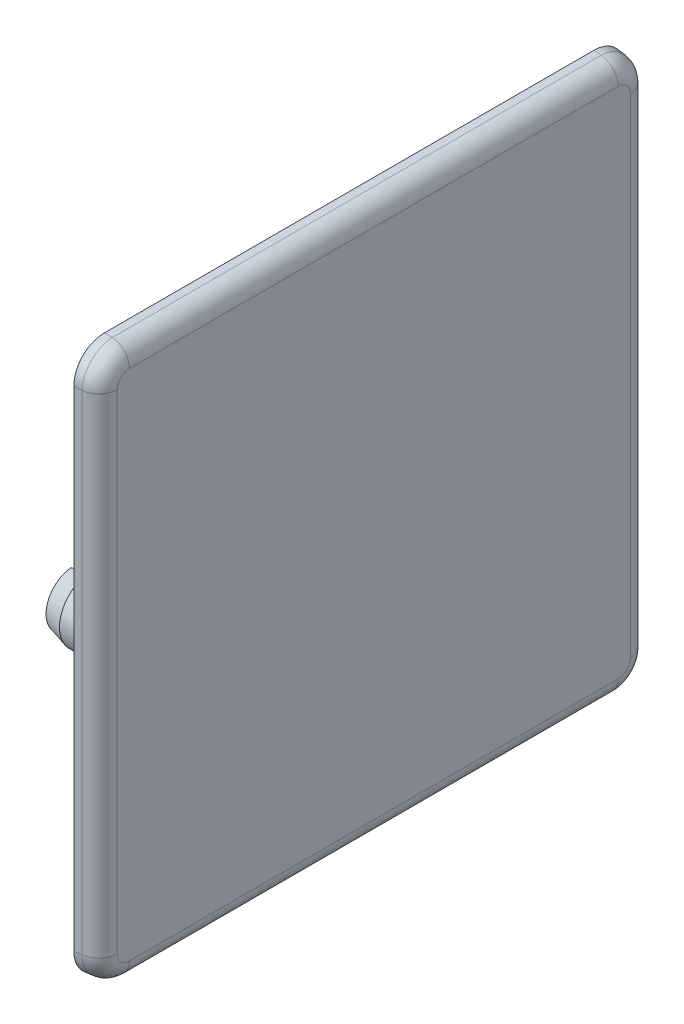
ISO-10303-21;
HEADER;
FILE_DESCRIPTION(('STEP AP214'),'2;1');
FILE_NAME('part.step','',(''),(''),'','','');
FILE_SCHEMA(('AUTOMOTIVE_DESIGN { 1 0 10303 214 1 1 1 1 }'));
ENDSEC;
DATA;
#1=APPLICATION_CONTEXT('core data for automotive mechanical design processes');
#2=APPLICATION_PROTOCOL_DEFINITION('international standard','automotive_design',2000,#1);
#3=PRODUCT_CONTEXT('',#1,'mechanical');
#4=PRODUCT('Part','Part','',(#3));
#5=PRODUCT_RELATED_PRODUCT_CATEGORY('part','',(#4));
#6=PRODUCT_DEFINITION_FORMATION('','',#4);
#7=PRODUCT_DEFINITION_CONTEXT('part definition',#1,'design');
#8=PRODUCT_DEFINITION('design','',#6,#7);
#9=PRODUCT_DEFINITION_SHAPE('','',#8);
#10=(LENGTH_UNIT() NAMED_UNIT(*) SI_UNIT(.MILLI.,.METRE.));
#11=(NAMED_UNIT(*) PLANE_ANGLE_UNIT() SI_UNIT($,.RADIAN.));
#12=(NAMED_UNIT(*) SI_UNIT($,.STERADIAN.) SOLID_ANGLE_UNIT());
#13=UNCERTAINTY_MEASURE_WITH_UNIT(LENGTH_MEASURE(1.E-05),#10,'distance_accuracy_value','');
#14=(GEOMETRIC_REPRESENTATION_CONTEXT(3) GLOBAL_UNCERTAINTY_ASSIGNED_CONTEXT((#13)) GLOBAL_UNIT_ASSIGNED_CONTEXT((#10,
#11,#12)) REPRESENTATION_CONTEXT('',''));
#15=CARTESIAN_POINT('',(0.,0.,0.));
#16=DIRECTION('',(0.,0.,1.));
#17=DIRECTION('',(1.,0.,0.));
#18=AXIS2_PLACEMENT_3D('',#15,#16,#17);
#19=CARTESIAN_POINT('',(4.,0.,0.));
#20=DIRECTION('',(-1.,0.,0.));
#21=DIRECTION('',(0.,0.,1.));
#22=AXIS2_PLACEMENT_3D('',#19,#20,#21);
#23=PLANE('',#22);
#24=DIRECTION('',(0.,-1.,0.));
#25=VECTOR('',#24,1.);
#26=CARTESIAN_POINT('',(4.,-40.0275565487,-41.92274749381));
#27=LINE('',#26,#25);
#28=CARTESIAN_POINT('',(4.,39.9276193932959,-41.92274749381));
#29=VERTEX_POINT('',#28);
#30=CARTESIAN_POINT('',(4.,-39.9276193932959,-41.92274749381));
#31=VERTEX_POINT('',#30);
#32=EDGE_CURVE('E883',#29,#31,#27,.T.);
#33=ORIENTED_EDGE('',*,*,#32,.F.);
#34=CARTESIAN_POINT('',(4.,41.92274749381,-39.9276193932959));
#35=CARTESIAN_POINT('',(4.,41.922744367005,-39.9685157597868));
#36=CARTESIAN_POINT('',(4.,41.92015138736,-40.0532296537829));
#37=CARTESIAN_POINT('',(4.,41.9080811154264,-40.1812100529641));
#38=CARTESIAN_POINT('',(4.,41.8871841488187,-40.310962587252));
#39=CARTESIAN_POINT('',(4.,41.8578258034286,-40.4390174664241));
#40=CARTESIAN_POINT('',(4.,41.8201335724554,-40.5648265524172));
#41=CARTESIAN_POINT('',(4.,41.7742704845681,-40.6878498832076));
#42=CARTESIAN_POINT('',(4.,41.7204344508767,-40.8075601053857));
#43=CARTESIAN_POINT('',(4.,41.6588573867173,-40.9234440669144));
#44=CARTESIAN_POINT('',(4.,41.5898041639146,-41.0350051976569));
#45=CARTESIAN_POINT('',(4.,41.513571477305,-41.1417655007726));
#46=CARTESIAN_POINT('',(4.,41.4304865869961,-41.2432675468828));
#47=CARTESIAN_POINT('',(4.,41.3409059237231,-41.3390763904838));
#48=CARTESIAN_POINT('',(4.,41.2452135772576,-41.42878139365));
#49=CARTESIAN_POINT('',(4.,41.1438196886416,-41.5119979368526));
#50=CARTESIAN_POINT('',(4.,41.0371587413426,-41.5883690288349));
#51=CARTESIAN_POINT('',(4.,40.9256877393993,-41.6575668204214));
#52=CARTESIAN_POINT('',(4.,40.8098842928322,-41.7192940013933));
#53=CARTESIAN_POINT('',(4.,40.690244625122,-41.7732850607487));
#54=CARTESIAN_POINT('',(4.,40.5672815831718,-41.8193074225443));
#55=CARTESIAN_POINT('',(4.,40.4415222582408,-41.8571624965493));
#56=CARTESIAN_POINT('',(4.,40.3135063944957,-41.8866865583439));
#57=CARTESIAN_POINT('',(4.,40.1837819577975,-41.9077514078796));
#58=CARTESIAN_POINT('',(4.,40.0549575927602,-41.9200695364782));
#59=CARTESIAN_POINT('',(4.,39.9693796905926,-41.9227443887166));
#60=CARTESIAN_POINT('',(4.,39.9276193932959,-41.92274749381));
#61=(BOUNDED_CURVE() B_SPLINE_CURVE(3,(#34,#35,#36,#37,#38,#39,#40,#41,#42,#43,#44,#45,#46,#47,
#48,#49,#50,#51,#52,#53,#54,#55,#56,#57,#58,#59,#60),.UNSPECIFIED.,.F.,
.F.) B_SPLINE_CURVE_WITH_KNOTS((4,1,1,1,1,1,1,1,1,1,1,1,1,1,1,1,1,1,1,1,1,1,1,1,4),
(0.00195580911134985,0.0408768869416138,0.0825687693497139,0.124253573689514,0.165931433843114,
0.207602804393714,0.249268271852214,0.290928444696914,0.332584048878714,0.374235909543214,
0.415884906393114,0.457531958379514,0.499178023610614,0.540824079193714,0.582471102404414,
0.624120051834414,0.665771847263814,0.707427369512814,0.749087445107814,0.790752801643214,
0.832424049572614,0.874101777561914,0.915786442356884,0.957478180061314,0.997221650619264),
.UNSPECIFIED.) CURVE() GEOMETRIC_REPRESENTATION_ITEM() RATIONAL_B_SPLINE_CURVE((1.15516569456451,
1.15516591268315,1.15516591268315,1.15516591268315,1.15516591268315,1.15516591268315,
1.15516591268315,1.15516591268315,1.15516591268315,1.15516591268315,1.15516591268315,
1.15516591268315,1.15516591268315,1.15516591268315,1.15516591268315,1.15516591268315,
1.15516591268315,1.15516591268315,1.15516591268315,1.15516591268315,1.15516591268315,
1.15516591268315,1.15516591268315,1.15516591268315,1.15516591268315,1.15516591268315,1.15516569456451)) REPRESENTATION_ITEM(''));
#62=CARTESIAN_POINT('',(4.,41.92274749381,-39.9276193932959));
#63=VERTEX_POINT('',#62);
#64=EDGE_CURVE('E845',#63,#29,#61,.T.);
#65=ORIENTED_EDGE('',*,*,#64,.F.);
#66=DIRECTION('',(0.,0.,-1.));
#67=VECTOR('',#66,1.);
#68=CARTESIAN_POINT('',(4.,41.92274749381,-40.0275565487));
#69=LINE('',#68,#67);
#70=CARTESIAN_POINT('',(4.00000000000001,41.92274749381,39.9276193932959));
#71=VERTEX_POINT('',#70);
#72=EDGE_CURVE('E829',#71,#63,#69,.T.);
#73=ORIENTED_EDGE('',*,*,#72,.F.);
#74=CARTESIAN_POINT('',(4.,39.9276193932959,41.92274749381));
#75=CARTESIAN_POINT('',(4.,39.9685157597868,41.922744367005));
#76=CARTESIAN_POINT('',(4.,40.0532296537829,41.92015138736));
#77=CARTESIAN_POINT('',(4.,40.1812100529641,41.9080811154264));
#78=CARTESIAN_POINT('',(4.,40.310962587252,41.8871841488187));
#79=CARTESIAN_POINT('',(4.,40.4390174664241,41.8578258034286));
#80=CARTESIAN_POINT('',(4.,40.5648265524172,41.8201335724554));
#81=CARTESIAN_POINT('',(4.,40.6878498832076,41.7742704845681));
#82=CARTESIAN_POINT('',(4.,40.8075601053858,41.7204344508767));
#83=CARTESIAN_POINT('',(4.,40.9234440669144,41.6588573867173));
#84=CARTESIAN_POINT('',(4.,41.0350051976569,41.5898041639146));
#85=CARTESIAN_POINT('',(4.,41.1417655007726,41.513571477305));
#86=CARTESIAN_POINT('',(4.,41.2432675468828,41.4304865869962));
#87=CARTESIAN_POINT('',(4.,41.3390763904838,41.3409059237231));
#88=CARTESIAN_POINT('',(4.,41.42878139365,41.2452135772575));
#89=CARTESIAN_POINT('',(4.,41.5119979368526,41.1438196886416));
#90=CARTESIAN_POINT('',(4.,41.5883690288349,41.0371587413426));
#91=CARTESIAN_POINT('',(4.,41.6575668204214,40.9256877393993));
#92=CARTESIAN_POINT('',(4.,41.7192940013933,40.8098842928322));
#93=CARTESIAN_POINT('',(4.,41.7732850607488,40.690244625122));
#94=CARTESIAN_POINT('',(4.,41.8193074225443,40.5672815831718));
#95=CARTESIAN_POINT('',(4.,41.8571624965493,40.4415222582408));
#96=CARTESIAN_POINT('',(4.,41.8866865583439,40.3135063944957));
#97=CARTESIAN_POINT('',(4.,41.9077514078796,40.1837819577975));
#98=CARTESIAN_POINT('',(4.,41.9200695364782,40.0549575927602));
#99=CARTESIAN_POINT('',(4.,41.9227443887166,39.9693796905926));
#100=CARTESIAN_POINT('',(4.00000000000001,41.92274749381,39.9276193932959));
#101=(BOUNDED_CURVE() B_SPLINE_CURVE(3,(#74,#75,#76,#77,#78,#79,#80,#81,#82,#83,#84,#85,#86,#87,
#88,#89,#90,#91,#92,#93,#94,#95,#96,#97,#98,#99,#100),.UNSPECIFIED.,.F.,
.F.) B_SPLINE_CURVE_WITH_KNOTS((4,1,1,1,1,1,1,1,1,1,1,1,1,1,1,1,1,1,1,1,1,1,1,1,4),
(0.00195580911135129,0.0408768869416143,0.0825687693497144,0.124253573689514,0.165931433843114,
0.207602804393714,0.249268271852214,0.290928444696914,0.332584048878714,0.374235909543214,
0.415884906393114,0.457531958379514,0.499178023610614,0.540824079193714,0.582471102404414,
0.624120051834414,0.665771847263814,0.707427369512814,0.749087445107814,0.790752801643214,
0.832424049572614,0.874101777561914,0.915786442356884,0.957478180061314,0.997221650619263),
.UNSPECIFIED.) CURVE() GEOMETRIC_REPRESENTATION_ITEM() RATIONAL_B_SPLINE_CURVE((1.15516569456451,
1.15516591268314,1.15516591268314,1.15516591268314,1.15516591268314,1.15516591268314,
1.15516591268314,1.15516591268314,1.15516591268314,1.15516591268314,1.15516591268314,
1.15516591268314,1.15516591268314,1.15516591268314,1.15516591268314,1.15516591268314,
1.15516591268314,1.15516591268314,1.15516591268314,1.15516591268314,1.15516591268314,
1.15516591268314,1.15516591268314,1.15516591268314,1.15516591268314,1.15516591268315,1.15516569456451)) REPRESENTATION_ITEM(''));
#102=CARTESIAN_POINT('',(4.,39.9276193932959,41.92274749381));
#103=VERTEX_POINT('',#102);
#104=EDGE_CURVE('E928',#103,#71,#101,.T.);
#105=ORIENTED_EDGE('',*,*,#104,.F.);
#106=DIRECTION('',(0.,1.,0.));
#107=VECTOR('',#106,1.);
#108=CARTESIAN_POINT('',(4.,40.0275565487,41.92274749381));
#109=LINE('',#108,#107);
#110=CARTESIAN_POINT('',(4.,-39.9276193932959,41.92274749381));
#111=VERTEX_POINT('',#110);
#112=EDGE_CURVE('E287',#111,#103,#109,.T.);
#113=ORIENTED_EDGE('',*,*,#112,.F.);
#114=CARTESIAN_POINT('',(4.,-41.92274749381,39.9276193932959));
#115=CARTESIAN_POINT('',(4.,-41.9227443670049,39.9685157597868));
#116=CARTESIAN_POINT('',(4.,-41.92015138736,40.0532296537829));
#117=CARTESIAN_POINT('',(4.,-41.9080811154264,40.1812100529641));
#118=CARTESIAN_POINT('',(4.,-41.8871841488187,40.310962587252));
#119=CARTESIAN_POINT('',(4.,-41.8578258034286,40.4390174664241));
#120=CARTESIAN_POINT('',(4.,-41.8201335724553,40.5648265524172));
#121=CARTESIAN_POINT('',(4.,-41.7742704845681,40.6878498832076));
#122=CARTESIAN_POINT('',(4.,-41.7204344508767,40.8075601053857));
#123=CARTESIAN_POINT('',(4.,-41.6588573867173,40.9234440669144));
#124=CARTESIAN_POINT('',(4.,-41.5898041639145,41.0350051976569));
#125=CARTESIAN_POINT('',(4.,-41.5135714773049,41.1417655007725));
#126=CARTESIAN_POINT('',(4.,-41.4304865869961,41.2432675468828));
#127=CARTESIAN_POINT('',(4.,-41.3409059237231,41.3390763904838));
#128=CARTESIAN_POINT('',(4.,-41.2452135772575,41.42878139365));
#129=CARTESIAN_POINT('',(4.,-41.1438196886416,41.5119979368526));
#130=CARTESIAN_POINT('',(4.,-41.0371587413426,41.5883690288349));
#131=CARTESIAN_POINT('',(4.,-40.9256877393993,41.6575668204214));
#132=CARTESIAN_POINT('',(4.,-40.8098842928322,41.7192940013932));
#133=CARTESIAN_POINT('',(4.,-40.690244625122,41.7732850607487));
#134=CARTESIAN_POINT('',(4.,-40.5672815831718,41.8193074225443));
#135=CARTESIAN_POINT('',(4.,-40.4415222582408,41.8571624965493));
#136=CARTESIAN_POINT('',(4.,-40.3135063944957,41.8866865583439));
#137=CARTESIAN_POINT('',(4.,-40.1837819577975,41.9077514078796));
#138=CARTESIAN_POINT('',(4.,-40.0549575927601,41.9200695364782));
#139=CARTESIAN_POINT('',(4.,-39.9693796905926,41.9227443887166));
#140=CARTESIAN_POINT('',(4.,-39.9276193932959,41.92274749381));
#141=(BOUNDED_CURVE() B_SPLINE_CURVE(3,(#114,#115,#116,#117,#118,#119,#120,#121,#122,#123,#124,
#125,#126,#127,#128,#129,#130,#131,#132,#133,#134,#135,#136,#137,#138,#139,#140),.UNSPECIFIED.,
.F.,.F.) B_SPLINE_CURVE_WITH_KNOTS((4,1,1,1,1,1,1,1,1,1,1,1,1,1,1,1,1,1,1,1,1,1,1,1,4),
(0.00195580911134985,0.0408768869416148,0.0825687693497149,0.124253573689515,0.165931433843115,
0.207602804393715,0.249268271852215,0.290928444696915,0.332584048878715,0.374235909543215,
0.415884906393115,0.457531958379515,0.499178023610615,0.540824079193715,0.582471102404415,
0.624120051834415,0.665771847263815,0.707427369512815,0.749087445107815,0.790752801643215,
0.832424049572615,0.874101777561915,0.915786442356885,0.957478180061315,0.997221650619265),
.UNSPECIFIED.) CURVE() GEOMETRIC_REPRESENTATION_ITEM() RATIONAL_B_SPLINE_CURVE((1.15516569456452,
1.15516591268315,1.15516591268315,1.15516591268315,1.15516591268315,1.15516591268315,
1.15516591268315,1.15516591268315,1.15516591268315,1.15516591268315,1.15516591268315,
1.15516591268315,1.15516591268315,1.15516591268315,1.15516591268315,1.15516591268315,
1.15516591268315,1.15516591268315,1.15516591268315,1.15516591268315,1.15516591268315,
1.15516591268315,1.15516591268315,1.15516591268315,1.15516591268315,1.15516591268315,1.15516569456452)) REPRESENTATION_ITEM(''));
#142=CARTESIAN_POINT('',(4.,-41.92274749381,39.9276193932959));
#143=VERTEX_POINT('',#142);
#144=EDGE_CURVE('E281',#143,#111,#141,.T.);
#145=ORIENTED_EDGE('',*,*,#144,.F.);
#146=DIRECTION('',(0.,0.,1.));
#147=VECTOR('',#146,1.);
#148=CARTESIAN_POINT('',(4.,-41.92274749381,40.0275565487));
#149=LINE('',#148,#147);
#150=CARTESIAN_POINT('',(3.99999999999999,-41.92274749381,-39.9276193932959));
#151=VERTEX_POINT('',#150);
#152=EDGE_CURVE('E284',#151,#143,#149,.T.);
#153=ORIENTED_EDGE('',*,*,#152,.F.);
#154=CARTESIAN_POINT('',(4.,-39.9276193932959,-41.92274749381));
#155=CARTESIAN_POINT('',(4.,-39.9685157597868,-41.922744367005));
#156=CARTESIAN_POINT('',(4.,-40.0532296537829,-41.92015138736));
#157=CARTESIAN_POINT('',(4.,-40.1812100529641,-41.9080811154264));
#158=CARTESIAN_POINT('',(4.,-40.310962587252,-41.8871841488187));
#159=CARTESIAN_POINT('',(4.,-40.4390174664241,-41.8578258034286));
#160=CARTESIAN_POINT('',(4.,-40.5648265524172,-41.8201335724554));
#161=CARTESIAN_POINT('',(4.,-40.6878498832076,-41.7742704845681));
#162=CARTESIAN_POINT('',(4.,-40.8075601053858,-41.7204344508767));
#163=CARTESIAN_POINT('',(4.,-40.9234440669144,-41.6588573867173));
#164=CARTESIAN_POINT('',(4.,-41.0350051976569,-41.5898041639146));
#165=CARTESIAN_POINT('',(4.,-41.1417655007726,-41.513571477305));
#166=CARTESIAN_POINT('',(4.,-41.2432675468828,-41.4304865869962));
#167=CARTESIAN_POINT('',(4.,-41.3390763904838,-41.3409059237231));
#168=CARTESIAN_POINT('',(4.,-41.42878139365,-41.2452135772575));
#169=CARTESIAN_POINT('',(4.,-41.5119979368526,-41.1438196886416));
#170=CARTESIAN_POINT('',(4.,-41.5883690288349,-41.0371587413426));
#171=CARTESIAN_POINT('',(4.,-41.6575668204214,-40.9256877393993));
#172=CARTESIAN_POINT('',(4.,-41.7192940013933,-40.8098842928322));
#173=CARTESIAN_POINT('',(4.,-41.7732850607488,-40.690244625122));
#174=CARTESIAN_POINT('',(4.,-41.8193074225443,-40.5672815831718));
#175=CARTESIAN_POINT('',(4.,-41.8571624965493,-40.4415222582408));
#176=CARTESIAN_POINT('',(4.,-41.8866865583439,-40.3135063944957));
#177=CARTESIAN_POINT('',(4.,-41.9077514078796,-40.1837819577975));
#178=CARTESIAN_POINT('',(4.,-41.9200695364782,-40.0549575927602));
#179=CARTESIAN_POINT('',(4.,-41.9227443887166,-39.9693796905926));
#180=CARTESIAN_POINT('',(3.99999999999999,-41.92274749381,-39.9276193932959));
#181=(BOUNDED_CURVE() B_SPLINE_CURVE(3,(#154,#155,#156,#157,#158,#159,#160,#161,#162,#163,#164,
#165,#166,#167,#168,#169,#170,#171,#172,#173,#174,#175,#176,#177,#178,#179,#180),.UNSPECIFIED.,
.F.,.F.) B_SPLINE_CURVE_WITH_KNOTS((4,1,1,1,1,1,1,1,1,1,1,1,1,1,1,1,1,1,1,1,1,1,1,1,4),
(0.00195580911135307,0.0408768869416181,0.0825687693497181,0.124253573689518,0.165931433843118,
0.207602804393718,0.249268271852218,0.290928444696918,0.332584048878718,0.374235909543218,
0.415884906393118,0.457531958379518,0.499178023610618,0.540824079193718,0.582471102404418,
0.624120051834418,0.665771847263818,0.707427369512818,0.749087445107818,0.790752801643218,
0.832424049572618,0.874101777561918,0.915786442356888,0.957478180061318,0.997221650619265),
.UNSPECIFIED.) CURVE() GEOMETRIC_REPRESENTATION_ITEM() RATIONAL_B_SPLINE_CURVE((1.15516569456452,
1.15516591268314,1.15516591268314,1.15516591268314,1.15516591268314,1.15516591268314,
1.15516591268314,1.15516591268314,1.15516591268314,1.15516591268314,1.15516591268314,
1.15516591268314,1.15516591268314,1.15516591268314,1.15516591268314,1.15516591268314,
1.15516591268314,1.15516591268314,1.15516591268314,1.15516591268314,1.15516591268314,
1.15516591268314,1.15516591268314,1.15516591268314,1.15516591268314,1.15516591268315,1.15516569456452)) REPRESENTATION_ITEM(''));
#182=EDGE_CURVE('E303',#31,#151,#181,.T.);
#183=ORIENTED_EDGE('',*,*,#182,.F.);
#184=EDGE_LOOP('',(#33,#65,#73,#105,#113,#145,#153,#183));
#185=FACE_BOUND('',#184,.T.);
#186=ADVANCED_FACE('F15',(#185),#23,.F.);
#187=CARTESIAN_POINT('',(4.,-39.9276193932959,41.92274749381));
#188=CARTESIAN_POINT('',(4.,-39.9693796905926,41.9227443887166));
#189=CARTESIAN_POINT('',(4.,-40.0549575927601,41.9200695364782));
#190=CARTESIAN_POINT('',(4.,-40.1837819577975,41.9077514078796));
#191=CARTESIAN_POINT('',(4.,-40.3135063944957,41.8866865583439));
#192=CARTESIAN_POINT('',(4.,-40.4415222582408,41.8571624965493));
#193=CARTESIAN_POINT('',(4.,-40.5672815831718,41.8193074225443));
#194=CARTESIAN_POINT('',(4.,-40.690244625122,41.7732850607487));
#195=CARTESIAN_POINT('',(4.,-40.8098842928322,41.7192940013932));
#196=CARTESIAN_POINT('',(4.,-40.9256877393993,41.6575668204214));
#197=CARTESIAN_POINT('',(4.,-41.0371587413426,41.5883690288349));
#198=CARTESIAN_POINT('',(4.,-41.1438196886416,41.5119979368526));
#199=CARTESIAN_POINT('',(4.,-41.2452135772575,41.42878139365));
#200=CARTESIAN_POINT('',(4.,-41.3409059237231,41.3390763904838));
#201=CARTESIAN_POINT('',(4.,-41.4304865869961,41.2432675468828));
#202=CARTESIAN_POINT('',(4.,-41.5135714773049,41.1417655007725));
#203=CARTESIAN_POINT('',(4.,-41.5898041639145,41.0350051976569));
#204=CARTESIAN_POINT('',(4.,-41.6588573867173,40.9234440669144));
#205=CARTESIAN_POINT('',(4.,-41.7204344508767,40.8075601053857));
#206=CARTESIAN_POINT('',(4.,-41.7742704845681,40.6878498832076));
#207=CARTESIAN_POINT('',(4.,-41.8201335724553,40.5648265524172));
#208=CARTESIAN_POINT('',(4.,-41.8578258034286,40.4390174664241));
#209=CARTESIAN_POINT('',(4.,-41.8871841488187,40.310962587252));
#210=CARTESIAN_POINT('',(4.,-41.9080811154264,40.1812100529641));
#211=CARTESIAN_POINT('',(4.,-41.92015138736,40.0532296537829));
#212=CARTESIAN_POINT('',(4.,-41.9227443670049,39.9685157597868));
#213=CARTESIAN_POINT('',(4.,-41.92274749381,39.9276193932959));
#214=CARTESIAN_POINT('',(4.,-39.9276193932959,43.5843294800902));
#215=CARTESIAN_POINT('',(4.00000164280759,-40.0039901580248,43.5843275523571));
#216=CARTESIAN_POINT('',(4.00000164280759,-40.1605264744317,43.5794356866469));
#217=CARTESIAN_POINT('',(4.00000164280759,-40.3962672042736,43.5568959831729));
#218=CARTESIAN_POINT('',(4.00000164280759,-40.633754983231,43.5183339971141));
#219=CARTESIAN_POINT('',(4.00000164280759,-40.8682093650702,43.4642638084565));
#220=CARTESIAN_POINT('',(4.00000164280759,-41.0986181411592,43.3949094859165));
#221=CARTESIAN_POINT('',(4.00000164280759,-41.323981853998,43.3105621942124));
#222=CARTESIAN_POINT('',(4.00000164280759,-41.543322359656,43.2115793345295));
#223=CARTESIAN_POINT('',(4.00000164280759,-41.7556862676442,43.0983832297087));
#224=CARTESIAN_POINT('',(4.00000164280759,-41.9601498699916,42.9714593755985));
#225=CARTESIAN_POINT('',(4.00000164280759,-42.1558233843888,42.831354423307));
#226=CARTESIAN_POINT('',(4.00000164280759,-42.3418552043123,42.678673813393));
#227=CARTESIAN_POINT('',(4.00000164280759,-42.5174359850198,42.5140790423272));
#228=CARTESIAN_POINT('',(4.00000164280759,-42.6818025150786,42.3382846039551));
#229=CARTESIAN_POINT('',(4.00000164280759,-42.8342413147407,42.152054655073));
#230=CARTESIAN_POINT('',(4.00000164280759,-42.9740919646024,41.9561994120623));
#231=CARTESIAN_POINT('',(4.00000164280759,-43.1007501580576,41.7515712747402));
#232=CARTESIAN_POINT('',(4.00000164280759,-43.2136704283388,41.5390607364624));
#233=CARTESIAN_POINT('',(4.00000164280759,-43.312368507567,41.3195921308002));
#234=CARTESIAN_POINT('',(4.00000164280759,-43.3964233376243,41.0941193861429));
#235=CARTESIAN_POINT('',(4.00000164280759,-43.4654788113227,40.8636210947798));
#236=CARTESIAN_POINT('',(4.00000164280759,-43.519245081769,40.6290970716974));
#237=CARTESIAN_POINT('',(4.00000164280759,-43.5574994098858,40.3915597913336));
#238=CARTESIAN_POINT('',(4.00000164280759,-43.57958537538,40.157365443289));
#239=CARTESIAN_POINT('',(4.00000164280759,-43.5843275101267,40.0024102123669));
#240=CARTESIAN_POINT('',(4.,-43.5843294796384,39.9276193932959));
#241=CARTESIAN_POINT('',(2.86680379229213,-39.9276193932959,44.7995335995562));
#242=CARTESIAN_POINT('',(2.86680525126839,-40.0293026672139,44.7995333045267));
#243=CARTESIAN_POINT('',(2.86680525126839,-40.2377347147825,44.7930200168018));
#244=CARTESIAN_POINT('',(2.86680525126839,-40.5516691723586,44.7630047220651));
#245=CARTESIAN_POINT('',(2.86680525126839,-40.8679701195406,44.7116461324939));
#246=CARTESIAN_POINT('',(2.86680525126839,-41.1802687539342,44.6396240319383));
#247=CARTESIAN_POINT('',(2.86680525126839,-41.4872133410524,44.5472326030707));
#248=CARTESIAN_POINT('',(2.86680525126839,-41.7874682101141,44.4348562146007));
#249=CARTESIAN_POINT('',(2.86680525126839,-42.0797253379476,44.3029684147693));
#250=CARTESIAN_POINT('',(2.86680525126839,-42.3627091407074,44.152130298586));
#251=CARTESIAN_POINT('',(2.86680525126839,-42.6351832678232,43.9829882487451));
#252=CARTESIAN_POINT('',(2.86680525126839,-42.8959564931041,43.7962712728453));
#253=CARTESIAN_POINT('',(2.86680525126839,-43.1438886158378,43.5927878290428));
#254=CARTESIAN_POINT('',(2.86680525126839,-43.3778961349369,43.3734221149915));
#255=CARTESIAN_POINT('',(2.86680525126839,-43.5969576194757,43.1391298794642));
#256=CARTESIAN_POINT('',(2.86680525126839,-43.8001186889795,42.8909338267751));
#257=CARTESIAN_POINT('',(2.86680525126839,-43.9864966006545,42.6299186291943));
#258=CARTESIAN_POINT('',(2.86680525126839,-44.1552844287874,42.3572255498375));
#259=CARTESIAN_POINT('',(2.86680525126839,-44.3057547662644,42.0740467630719));
#260=CARTESIAN_POINT('',(2.86680525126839,-44.4372628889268,41.7816194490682));
#261=CARTESIAN_POINT('',(2.86680525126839,-44.5492494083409,41.4812198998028));
#262=CARTESIAN_POINT('',(2.86680525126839,-44.6412425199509,41.1741567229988));
#263=CARTESIAN_POINT('',(2.86680525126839,-44.7128596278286,40.8617660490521));
#264=CARTESIAN_POINT('',(2.86680525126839,-44.7638083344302,40.5453999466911));
#265=CARTESIAN_POINT('',(2.86680525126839,-44.7932193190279,40.2335255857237));
#266=CARTESIAN_POINT('',(2.86680525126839,-44.7995332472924,40.0271990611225));
#267=CARTESIAN_POINT('',(2.86680379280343,-44.7995335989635,39.9276193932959));
#268=CARTESIAN_POINT('',(1.20926933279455,-39.9276193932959,44.9154396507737));
#269=CARTESIAN_POINT('',(1.20926933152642,-40.0317169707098,44.9154394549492));
#270=CARTESIAN_POINT('',(1.20926933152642,-40.2450988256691,44.9087715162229));
#271=CARTESIAN_POINT('',(1.20926933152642,-40.56649138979,44.8780432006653));
#272=CARTESIAN_POINT('',(1.20926933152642,-40.8903095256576,44.82546407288));
#273=CARTESIAN_POINT('',(1.20926933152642,-41.2100329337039,44.751729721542));
#274=CARTESIAN_POINT('',(1.20926933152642,-41.5242774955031,44.6571410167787));
#275=CARTESIAN_POINT('',(1.20926933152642,-41.8316754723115,44.5420912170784));
#276=CARTESIAN_POINT('',(1.20926933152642,-42.1308873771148,44.4070649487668));
#277=CARTESIAN_POINT('',(1.20926933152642,-42.420606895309,44.2526365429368));
#278=CARTESIAN_POINT('',(1.20926933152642,-42.6995678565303,44.0794677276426));
#279=CARTESIAN_POINT('',(1.20926933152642,-42.9665502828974,43.8883049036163));
#280=CARTESIAN_POINT('',(1.20926933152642,-43.2203864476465,43.6799758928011));
#281=CARTESIAN_POINT('',(1.20926933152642,-43.4599667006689,43.4553861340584));
#282=CARTESIAN_POINT('',(1.20926933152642,-43.6842449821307,43.2155143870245));
#283=CARTESIAN_POINT('',(1.20926933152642,-43.8922439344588,42.9614080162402));
#284=CARTESIAN_POINT('',(1.20926933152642,-44.0830596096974,42.6941778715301));
#285=CARTESIAN_POINT('',(1.20926933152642,-44.2558657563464,42.4149927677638));
#286=CARTESIAN_POINT('',(1.20926933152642,-44.4099176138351,42.1250736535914));
#287=CARTESIAN_POINT('',(1.20926933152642,-44.5445551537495,41.8256875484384));
#288=CARTESIAN_POINT('',(1.20926933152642,-44.6592057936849,41.5181414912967));
#289=CARTESIAN_POINT('',(1.20926933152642,-44.7533866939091,41.2037755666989));
#290=CARTESIAN_POINT('',(1.20926933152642,-44.8267064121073,40.8839579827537));
#291=CARTESIAN_POINT('',(1.20926933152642,-44.8788659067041,40.5600731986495));
#292=CARTESIAN_POINT('',(1.20926933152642,-44.9089755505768,40.2407897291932));
#293=CARTESIAN_POINT('',(1.20926933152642,-44.9154393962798,40.0295634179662));
#294=CARTESIAN_POINT('',(1.2092693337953,-44.9154396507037,39.9276193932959));
#295=(BOUNDED_SURFACE() B_SPLINE_SURFACE(3,3,((#187,#188,#189,#190,#191,#192,#193,#194,#195,
#196,#197,#198,#199,#200,#201,#202,#203,#204,#205,#206,#207,#208,#209,#210,#211,#212,#213),
(#214,#215,#216,#217,#218,#219,#220,#221,#222,#223,#224,#225,#226,#227,#228,#229,#230,#231,#232,
#233,#234,#235,#236,#237,#238,#239,#240),(#241,#242,#243,#244,#245,#246,#247,#248,#249,#250,
#251,#252,#253,#254,#255,#256,#257,#258,#259,#260,#261,#262,#263,#264,#265,#266,#267),(#268,
#269,#270,#271,#272,#273,#274,#275,#276,#277,#278,#279,#280,#281,#282,#283,#284,#285,#286,#287,
#288,#289,#290,#291,#292,#293,#294)),.UNSPECIFIED.,.F.,.F.,.F.) B_SPLINE_SURFACE_WITH_KNOTS((4,
4),(4,1,1,1,1,1,1,1,1,1,1,1,1,1,1,1,1,1,1,1,1,1,1,1,4),(0.0212015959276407,0.978797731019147),
(0.0019558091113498,0.0416992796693,0.08339101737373,0.1250756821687,0.166753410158,
0.2084246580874,0.2500900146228,0.2917500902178,0.3334056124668,0.3750574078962,0.4167063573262,
0.4583533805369,0.49999943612,0.5416455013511,0.5832925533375,0.6249415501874,0.6665934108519,
0.7082490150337,0.7499091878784,0.7915746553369,0.8332460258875,0.8749238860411,0.9166086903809,
0.958300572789,0.997221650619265),
.UNSPECIFIED.) GEOMETRIC_REPRESENTATION_ITEM() RATIONAL_B_SPLINE_SURFACE(((1.15516569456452,
1.15516591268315,1.15516591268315,1.15516591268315,1.15516591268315,1.15516591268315,
1.15516591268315,1.15516591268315,1.15516591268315,1.15516591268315,1.15516591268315,
1.15516591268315,1.15516591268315,1.15516591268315,1.15516591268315,1.15516591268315,
1.15516591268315,1.15516591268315,1.15516591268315,1.15516591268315,1.15516591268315,
1.15516591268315,1.15516591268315,1.15516591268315,1.15516591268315,1.15516591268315,
1.15516569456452),(0.948278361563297,0.948278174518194,0.948278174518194,0.948278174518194,
0.948278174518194,0.948278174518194,0.948278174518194,0.948278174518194,0.948278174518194,
0.948278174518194,0.948278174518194,0.948278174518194,0.948278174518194,0.948278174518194,
0.948278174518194,0.948278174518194,0.948278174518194,0.948278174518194,0.948278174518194,
0.948278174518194,0.948278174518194,0.948278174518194,0.948278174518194,0.948278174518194,
0.948278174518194,0.948278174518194,0.948278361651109),(0.948278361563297,0.948278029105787,
0.948278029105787,0.948278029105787,0.948278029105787,0.948278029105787,0.948278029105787,
0.948278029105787,0.948278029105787,0.948278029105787,0.948278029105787,0.948278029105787,
0.948278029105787,0.948278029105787,0.948278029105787,0.948278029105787,0.948278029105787,
0.948278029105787,0.948278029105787,0.948278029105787,0.948278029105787,0.948278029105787,
0.948278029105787,0.948278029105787,0.948278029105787,0.948278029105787,0.948278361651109),
(1.15516569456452,1.15516547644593,1.15516547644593,1.15516547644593,1.15516547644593,
1.15516547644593,1.15516547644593,1.15516547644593,1.15516547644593,1.15516547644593,
1.15516547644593,1.15516547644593,1.15516547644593,1.15516547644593,1.15516547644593,
1.15516547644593,1.15516547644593,1.15516547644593,1.15516547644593,1.15516547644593,
1.15516547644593,1.15516547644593,1.15516547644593,1.15516547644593,1.15516547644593,
1.15516547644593,1.15516569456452))) REPRESENTATION_ITEM('') SURFACE());
#296=CARTESIAN_POINT('',(1.20926933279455,-39.9276193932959,44.9154396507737));
#297=CARTESIAN_POINT('',(1.21164211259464,-39.9845612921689,44.9152735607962));
#298=CARTESIAN_POINT('',(1.21397094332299,-40.0415021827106,44.9141342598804));
#299=CARTESIAN_POINT('',(1.21853079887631,-40.1550929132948,44.9099195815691));
#300=CARTESIAN_POINT('',(1.22076217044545,-40.2117430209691,44.9068517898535));
#301=CARTESIAN_POINT('',(1.22512694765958,-40.3246812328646,44.8988053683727));
#302=CARTESIAN_POINT('',(1.22726071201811,-40.380969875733,44.8938344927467));
#303=CARTESIAN_POINT('',(1.23142996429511,-40.4931233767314,44.8820112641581));
#304=CARTESIAN_POINT('',(1.23346581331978,-40.5489890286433,44.8751665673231));
#305=CARTESIAN_POINT('',(1.23743903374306,-40.6602366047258,44.8596255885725));
#306=CARTESIAN_POINT('',(1.23937676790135,-40.7156195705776,44.8509368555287));
#307=CARTESIAN_POINT('',(1.24315358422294,-40.8258419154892,44.8317406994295));
#308=CARTESIAN_POINT('',(1.24499303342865,-40.8806825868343,44.8212407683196));
#309=CARTESIAN_POINT('',(1.24857309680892,-40.9897622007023,44.7984556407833));
#310=CARTESIAN_POINT('',(1.25031408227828,-41.0440026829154,44.7861778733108));
#311=CARTESIAN_POINT('',(1.253697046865,-41.1518263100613,44.7598734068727));
#312=CARTESIAN_POINT('',(1.2553394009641,-41.2054112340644,44.7458540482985));
#313=CARTESIAN_POINT('',(1.25852494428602,-41.3118698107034,44.7161032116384));
#314=CARTESIAN_POINT('',(1.26006851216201,-41.3647454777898,44.7003789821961));
#315=CARTESIAN_POINT('',(1.26305633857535,-41.4697336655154,44.6672577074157));
#316=CARTESIAN_POINT('',(1.26450097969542,-41.5218484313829,44.6498678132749));
#317=CARTESIAN_POINT('',(1.26729081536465,-41.6252646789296,44.6134549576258));
#318=CARTESIAN_POINT('',(1.26863639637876,-41.6765686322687,44.5944390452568));
#319=CARTESIAN_POINT('',(1.27122798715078,-41.778315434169,44.5548161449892));
#320=CARTESIAN_POINT('',(1.27247438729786,-41.8287609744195,44.5342160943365));
#321=CARTESIAN_POINT('',(1.27486749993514,-41.9287448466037,44.491467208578));
#322=CARTESIAN_POINT('',(1.27601460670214,-41.9782860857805,44.4693251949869));
#323=CARTESIAN_POINT('',(1.27820902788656,-42.0764176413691,44.4235367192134));
#324=CARTESIAN_POINT('',(1.2792567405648,-42.1250110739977,44.3998969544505));
#325=CARTESIAN_POINT('',(1.28125227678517,-42.2212049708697,44.3511574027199));
#326=CARTESIAN_POINT('',(1.28220050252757,-42.2688087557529,44.3260641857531));
#327=CARTESIAN_POINT('',(1.28399697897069,-42.3629838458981,44.2744640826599));
#328=CARTESIAN_POINT('',(1.28484563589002,-42.4095586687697,44.2479636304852));
#329=CARTESIAN_POINT('',(1.28644289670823,-42.5016378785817,44.1935952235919));
#330=CARTESIAN_POINT('',(1.2871919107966,-42.5471459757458,44.1657335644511));
#331=CARTESIAN_POINT('',(1.28858981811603,-42.6370564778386,44.1086907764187));
#332=CARTESIAN_POINT('',(1.28923912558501,-42.6814627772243,44.079515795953));
#333=CARTESIAN_POINT('',(1.29043755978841,-42.7691358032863,44.0198938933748));
#334=CARTESIAN_POINT('',(1.2909871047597,-42.8124066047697,43.989452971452));
#335=CARTESIAN_POINT('',(1.29198596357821,-42.8977776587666,43.927348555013));
#336=CARTESIAN_POINT('',(1.29243569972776,-42.9398821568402,43.8956909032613));
#337=CARTESIAN_POINT('',(1.29323489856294,-43.0228907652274,43.8312015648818));
#338=CARTESIAN_POINT('',(1.29358478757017,-43.0637992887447,43.7983755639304));
#339=CARTESIAN_POINT('',(1.29418425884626,-43.1443892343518,43.7315998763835));
#340=CARTESIAN_POINT('',(1.29443427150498,-43.1840752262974,43.6976557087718));
#341=CARTESIAN_POINT('',(1.29483396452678,-43.262194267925,43.628692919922));
#342=CARTESIAN_POINT('',(1.29498407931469,-43.300632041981,43.5936796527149));
#343=CARTESIAN_POINT('',(1.29518396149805,-43.3762321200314,43.5226296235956));
#344=CARTESIAN_POINT('',(1.29523416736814,-43.4133992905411,43.4865980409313));
#345=CARTESIAN_POINT('',(1.29523421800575,-43.4865973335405,43.4133999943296));
#346=CARTESIAN_POINT('',(1.29518406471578,-43.5226282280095,43.3762335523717));
#347=CARTESIAN_POINT('',(1.29498428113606,-43.5936769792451,43.30063490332));
#348=CARTESIAN_POINT('',(1.29483421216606,-43.6286896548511,43.2621978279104));
#349=CARTESIAN_POINT('',(1.29443460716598,-43.6976513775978,43.1840801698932));
#350=CARTESIAN_POINT('',(1.29418463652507,-43.7315950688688,43.1443948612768));
#351=CARTESIAN_POINT('',(1.29358524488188,-43.7983698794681,43.0638062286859));
#352=CARTESIAN_POINT('',(1.29323539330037,-43.8311954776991,43.0228983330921));
#353=CARTESIAN_POINT('',(1.2924362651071,-43.8956841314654,42.9398909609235));
#354=CARTESIAN_POINT('',(1.29198656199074,-43.9273414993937,42.8977870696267));
#355=CARTESIAN_POINT('',(1.29098776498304,-43.9894454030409,42.8124171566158));
#356=CARTESIAN_POINT('',(1.29043824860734,-44.0198860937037,42.7691468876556));
#357=CARTESIAN_POINT('',(1.28923986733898,-44.0795076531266,42.681474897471));
#358=CARTESIAN_POINT('',(1.28859058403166,-44.1086825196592,42.6370691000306));
#359=CARTESIAN_POINT('',(1.28719272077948,-44.1657251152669,42.5471595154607));
#360=CARTESIAN_POINT('',(1.28644372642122,-44.1935866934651,42.5016518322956));
#361=CARTESIAN_POINT('',(1.28484650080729,-44.2479550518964,42.4095734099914));
#362=CARTESIAN_POINT('',(1.28399785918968,-44.274455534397,42.3629989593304));
#363=CARTESIAN_POINT('',(1.28220140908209,-44.3260557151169,42.2688245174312));
#364=CARTESIAN_POINT('',(1.2812531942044,-44.3511489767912,42.2212210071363));
#365=CARTESIAN_POINT('',(1.27925767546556,-44.3998887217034,42.1250276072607));
#366=CARTESIAN_POINT('',(1.27820996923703,-44.4235286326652,42.0764343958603));
#367=CARTESIAN_POINT('',(1.27601555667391,-44.4693173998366,41.9783031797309));
#368=CARTESIAN_POINT('',(1.27486845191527,-44.4914595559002,41.9287620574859));
#369=CARTESIAN_POINT('',(1.2724753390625,-44.5342088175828,41.8287783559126));
#370=CARTESIAN_POINT('',(1.27122893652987,-44.5548090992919,41.7783328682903));
#371=CARTESIAN_POINT('',(1.26863733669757,-44.5944324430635,41.676586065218));
#372=CARTESIAN_POINT('',(1.26729174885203,-44.6134485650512,41.6252820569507));
#373=CARTESIAN_POINT('',(1.2645018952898,-44.6498619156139,41.5218656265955));
#374=CARTESIAN_POINT('',(1.26305724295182,-44.6672520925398,41.4697507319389));
#375=CARTESIAN_POINT('',(1.26006938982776,-44.700373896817,41.3647621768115));
#376=CARTESIAN_POINT('',(1.25852580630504,-44.7160983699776,41.3118862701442));
#377=CARTESIAN_POINT('',(1.25534022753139,-44.7458497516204,41.2054271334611));
#378=CARTESIAN_POINT('',(1.25369785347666,-44.7598694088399,41.1518418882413));
#379=CARTESIAN_POINT('',(1.25031484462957,-44.7861744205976,41.0440175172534));
#380=CARTESIAN_POINT('',(1.24857383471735,-44.798452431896,40.9897766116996));
#381=CARTESIAN_POINT('',(1.24499371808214,-44.8212380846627,40.8806960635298));
#382=CARTESIAN_POINT('',(1.2431542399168,-44.831738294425,40.8258548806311));
#383=CARTESIAN_POINT('',(1.23937736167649,-44.8509349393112,40.7156313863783));
#384=CARTESIAN_POINT('',(1.23743959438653,-44.8596238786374,40.6602477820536));
#385=CARTESIAN_POINT('',(1.23346630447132,-44.8751652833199,40.548998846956));
#386=CARTESIAN_POINT('',(1.2314304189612,-44.8820101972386,40.4931324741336));
#387=CARTESIAN_POINT('',(1.22726108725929,-44.893833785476,40.3809775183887));
#388=CARTESIAN_POINT('',(1.22512727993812,-44.8988048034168,40.3246881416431));
#389=CARTESIAN_POINT('',(1.22076241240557,-44.906851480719,40.2117483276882));
#390=CARTESIAN_POINT('',(1.21853099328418,-44.9099193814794,40.1550973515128));
#391=CARTESIAN_POINT('',(1.21397103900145,-44.9141342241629,40.0415045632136));
#392=CARTESIAN_POINT('',(1.21164215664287,-44.9152735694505,39.9845624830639));
#393=CARTESIAN_POINT('',(1.2092693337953,-44.9154396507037,39.9276193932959));
#394=B_SPLINE_CURVE_WITH_KNOTS('',3,(#296,#297,#298,#299,#300,#301,#302,#303,#304,#305,#306,
#307,#308,#309,#310,#311,#312,#313,#314,#315,#316,#317,#318,#319,#320,#321,#322,#323,#324,#325,
#326,#327,#328,#329,#330,#331,#332,#333,#334,#335,#336,#337,#338,#339,#340,#341,#342,#343,#344,
#345,#346,#347,#348,#349,#350,#351,#352,#353,#354,#355,#356,#357,#358,#359,#360,#361,#362,#363,
#364,#365,#366,#367,#368,#369,#370,#371,#372,#373,#374,#375,#376,#377,#378,#379,#380,#381,#382,
#383,#384,#385,#386,#387,#388,#389,#390,#391,#392,#393),.UNSPECIFIED.,.F.,.F.,(4,2,2,2,2,2,2,2,
2,2,2,2,2,2,2,2,2,2,2,2,2,2,2,2,2,2,2,2,2,2,2,2,2,2,2,2,2,2,2,2,2,2,2,2,2,2,2,2,4),(0.,
0.170966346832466,0.341264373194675,0.510875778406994,0.679804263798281,0.848054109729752,
1.01562399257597,1.18251285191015,1.3487207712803,1.51424784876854,1.67909366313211,
1.84325792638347,2.00674027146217,2.16954043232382,2.3316579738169,2.49309257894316,
2.65384380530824,2.81391133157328,2.9732947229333,3.13199366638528,3.29000776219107,
3.44733672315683,3.6039802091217,3.75993797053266,3.91520975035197,4.07047852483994,
4.22643354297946,4.38307454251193,4.54040127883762,4.69841340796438,4.85711064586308,
5.01649259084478,5.1765589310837,5.33730923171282,5.49874317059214,5.66086030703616,
5.82366032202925,5.98714278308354,6.15130741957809,6.31615386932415,6.48168184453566,
6.64789092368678,6.8147811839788,6.98235273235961,7.15060456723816,7.31953528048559,
7.48914891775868,7.65944956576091,7.83041948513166),.UNSPECIFIED.);
#395=CARTESIAN_POINT('',(1.20926940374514,-44.9154396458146,39.9276193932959));
#396=VERTEX_POINT('',#395);
#397=CARTESIAN_POINT('',(1.20926940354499,-39.9276193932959,44.9154396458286));
#398=VERTEX_POINT('',#397);
#399=EDGE_CURVE('E234',#396,#398,#394,.F.);
#400=CARTESIAN_POINT('',(1.,-41.92274749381,39.9276193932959));
#401=DIRECTION('',(0.,0.,1.));
#402=DIRECTION('',(1.,0.,0.));
#403=AXIS2_PLACEMENT_3D('',#400,#401,#402);
#404=CIRCLE('',#403,3.);
#405=EDGE_CURVE('E292',#143,#396,#404,.F.);
#406=CARTESIAN_POINT('',(1.,-39.9276193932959,41.92274749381));
#407=DIRECTION('',(0.,1.,0.));
#408=DIRECTION('',(0.,0.,1.));
#409=AXIS2_PLACEMENT_3D('',#406,#407,#408);
#410=CIRCLE('',#409,3.);
#411=EDGE_CURVE('E932',#398,#111,#410,.T.);
#412=ORIENTED_EDGE('',*,*,#399,.F.);
#413=ORIENTED_EDGE('',*,*,#405,.F.);
#414=ORIENTED_EDGE('',*,*,#144,.T.);
#415=ORIENTED_EDGE('',*,*,#411,.F.);
#416=EDGE_LOOP('',(#412,#413,#414,#415));
#417=FACE_BOUND('',#416,.T.);
#418=ADVANCED_FACE('F293',(#417),#295,.T.);
#419=CARTESIAN_POINT('',(1.,40.0275565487,41.92274749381));
#420=DIRECTION('',(0.,1.,0.));
#421=DIRECTION('',(0.,0.,1.));
#422=AXIS2_PLACEMENT_3D('',#419,#420,#421);
#423=CYLINDRICAL_SURFACE('',#422,3.);
#424=DIRECTION('',(0.,1.,0.));
#425=VECTOR('',#424,1.);
#426=CARTESIAN_POINT('',(1.2092694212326,-46.12000480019,44.9154396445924));
#427=LINE('',#426,#425);
#428=CARTESIAN_POINT('',(1.20926938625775,39.9276193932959,44.915439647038));
#429=VERTEX_POINT('',#428);
#430=EDGE_CURVE('E890',#398,#429,#427,.T.);
#431=ORIENTED_EDGE('',*,*,#430,.F.);
#432=ORIENTED_EDGE('',*,*,#411,.T.);
#433=ORIENTED_EDGE('',*,*,#112,.T.);
#434=CARTESIAN_POINT('',(0.999999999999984,39.9276193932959,41.92274749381));
#435=DIRECTION('',(0.,1.,0.));
#436=DIRECTION('',(1.,0.,0.));
#437=AXIS2_PLACEMENT_3D('',#434,#435,#436);
#438=CIRCLE('',#437,3.00000000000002);
#439=EDGE_CURVE('E838',#429,#103,#438,.T.);
#440=ORIENTED_EDGE('',*,*,#439,.F.);
#441=EDGE_LOOP('',(#431,#432,#433,#440));
#442=FACE_BOUND('',#441,.T.);
#443=ADVANCED_FACE('F320',(#442),#423,.T.);
#444=CARTESIAN_POINT('',(4.00000000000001,41.92274749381,39.9276193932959));
#445=CARTESIAN_POINT('',(4.,41.9227443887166,39.9693796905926));
#446=CARTESIAN_POINT('',(4.,41.9200695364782,40.0549575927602));
#447=CARTESIAN_POINT('',(4.,41.9077514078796,40.1837819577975));
#448=CARTESIAN_POINT('',(4.,41.8866865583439,40.3135063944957));
#449=CARTESIAN_POINT('',(4.,41.8571624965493,40.4415222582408));
#450=CARTESIAN_POINT('',(4.,41.8193074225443,40.5672815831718));
#451=CARTESIAN_POINT('',(4.,41.7732850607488,40.690244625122));
#452=CARTESIAN_POINT('',(4.,41.7192940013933,40.8098842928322));
#453=CARTESIAN_POINT('',(4.,41.6575668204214,40.9256877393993));
#454=CARTESIAN_POINT('',(4.,41.5883690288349,41.0371587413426));
#455=CARTESIAN_POINT('',(4.,41.5119979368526,41.1438196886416));
#456=CARTESIAN_POINT('',(4.,41.42878139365,41.2452135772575));
#457=CARTESIAN_POINT('',(4.,41.3390763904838,41.3409059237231));
#458=CARTESIAN_POINT('',(4.,41.2432675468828,41.4304865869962));
#459=CARTESIAN_POINT('',(4.,41.1417655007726,41.513571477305));
#460=CARTESIAN_POINT('',(4.,41.0350051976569,41.5898041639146));
#461=CARTESIAN_POINT('',(4.,40.9234440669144,41.6588573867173));
#462=CARTESIAN_POINT('',(4.,40.8075601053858,41.7204344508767));
#463=CARTESIAN_POINT('',(4.,40.6878498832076,41.7742704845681));
#464=CARTESIAN_POINT('',(4.,40.5648265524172,41.8201335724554));
#465=CARTESIAN_POINT('',(4.,40.4390174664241,41.8578258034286));
#466=CARTESIAN_POINT('',(4.,40.310962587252,41.8871841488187));
#467=CARTESIAN_POINT('',(4.,40.1812100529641,41.9080811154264));
#468=CARTESIAN_POINT('',(4.,40.0532296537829,41.92015138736));
#469=CARTESIAN_POINT('',(4.,39.9685157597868,41.922744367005));
#470=CARTESIAN_POINT('',(4.,39.9276193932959,41.92274749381));
#471=CARTESIAN_POINT('',(4.,43.5843294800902,39.9276193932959));
#472=CARTESIAN_POINT('',(4.00000164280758,43.5843275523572,40.0039901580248));
#473=CARTESIAN_POINT('',(4.00000164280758,43.5794356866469,40.1605264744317));
#474=CARTESIAN_POINT('',(4.00000164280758,43.5568959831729,40.3962672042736));
#475=CARTESIAN_POINT('',(4.00000164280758,43.5183339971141,40.633754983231));
#476=CARTESIAN_POINT('',(4.00000164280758,43.4642638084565,40.8682093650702));
#477=CARTESIAN_POINT('',(4.00000164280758,43.3949094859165,41.0986181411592));
#478=CARTESIAN_POINT('',(4.00000164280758,43.3105621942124,41.323981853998));
#479=CARTESIAN_POINT('',(4.00000164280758,43.2115793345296,41.543322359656));
#480=CARTESIAN_POINT('',(4.00000164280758,43.0983832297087,41.7556862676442));
#481=CARTESIAN_POINT('',(4.00000164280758,42.9714593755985,41.9601498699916));
#482=CARTESIAN_POINT('',(4.00000164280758,42.831354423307,42.1558233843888));
#483=CARTESIAN_POINT('',(4.00000164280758,42.678673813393,42.3418552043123));
#484=CARTESIAN_POINT('',(4.00000164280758,42.5140790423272,42.5174359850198));
#485=CARTESIAN_POINT('',(4.00000164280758,42.3382846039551,42.6818025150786));
#486=CARTESIAN_POINT('',(4.00000164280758,42.152054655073,42.8342413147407));
#487=CARTESIAN_POINT('',(4.00000164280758,41.9561994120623,42.9740919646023));
#488=CARTESIAN_POINT('',(4.00000164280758,41.7515712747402,43.1007501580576));
#489=CARTESIAN_POINT('',(4.00000164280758,41.5390607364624,43.2136704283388));
#490=CARTESIAN_POINT('',(4.00000164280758,41.3195921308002,43.312368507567));
#491=CARTESIAN_POINT('',(4.00000164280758,41.0941193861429,43.3964233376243));
#492=CARTESIAN_POINT('',(4.00000164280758,40.8636210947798,43.4654788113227));
#493=CARTESIAN_POINT('',(4.00000164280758,40.6290970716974,43.519245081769));
#494=CARTESIAN_POINT('',(4.00000164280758,40.3915597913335,43.5574994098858));
#495=CARTESIAN_POINT('',(4.00000164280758,40.157365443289,43.57958537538));
#496=CARTESIAN_POINT('',(4.00000164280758,40.0024102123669,43.5843275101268));
#497=CARTESIAN_POINT('',(4.,39.9276193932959,43.5843294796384));
#498=CARTESIAN_POINT('',(2.86680379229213,44.7995335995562,39.9276193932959));
#499=CARTESIAN_POINT('',(2.86680525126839,44.7995333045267,40.0293026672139));
#500=CARTESIAN_POINT('',(2.86680525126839,44.7930200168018,40.2377347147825));
#501=CARTESIAN_POINT('',(2.86680525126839,44.7630047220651,40.5516691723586));
#502=CARTESIAN_POINT('',(2.86680525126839,44.7116461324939,40.8679701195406));
#503=CARTESIAN_POINT('',(2.86680525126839,44.6396240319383,41.1802687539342));
#504=CARTESIAN_POINT('',(2.86680525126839,44.5472326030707,41.4872133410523));
#505=CARTESIAN_POINT('',(2.86680525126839,44.4348562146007,41.7874682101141));
#506=CARTESIAN_POINT('',(2.86680525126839,44.3029684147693,42.0797253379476));
#507=CARTESIAN_POINT('',(2.86680525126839,44.152130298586,42.3627091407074));
#508=CARTESIAN_POINT('',(2.86680525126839,43.9829882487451,42.6351832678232));
#509=CARTESIAN_POINT('',(2.86680525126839,43.7962712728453,42.895956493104));
#510=CARTESIAN_POINT('',(2.86680525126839,43.5927878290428,43.1438886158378));
#511=CARTESIAN_POINT('',(2.86680525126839,43.3734221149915,43.3778961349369));
#512=CARTESIAN_POINT('',(2.86680525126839,43.1391298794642,43.5969576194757));
#513=CARTESIAN_POINT('',(2.86680525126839,42.8909338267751,43.8001186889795));
#514=CARTESIAN_POINT('',(2.86680525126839,42.6299186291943,43.9864966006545));
#515=CARTESIAN_POINT('',(2.86680525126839,42.3572255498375,44.1552844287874));
#516=CARTESIAN_POINT('',(2.86680525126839,42.0740467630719,44.3057547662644));
#517=CARTESIAN_POINT('',(2.86680525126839,41.7816194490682,44.4372628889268));
#518=CARTESIAN_POINT('',(2.86680525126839,41.4812198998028,44.5492494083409));
#519=CARTESIAN_POINT('',(2.86680525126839,41.1741567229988,44.6412425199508));
#520=CARTESIAN_POINT('',(2.86680525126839,40.8617660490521,44.7128596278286));
#521=CARTESIAN_POINT('',(2.86680525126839,40.5453999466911,44.7638083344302));
#522=CARTESIAN_POINT('',(2.86680525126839,40.2335255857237,44.7932193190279));
#523=CARTESIAN_POINT('',(2.86680525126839,40.0271990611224,44.7995332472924));
#524=CARTESIAN_POINT('',(2.86680379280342,39.9276193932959,44.7995335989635));
#525=CARTESIAN_POINT('',(1.20926933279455,44.9154396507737,39.9276193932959));
#526=CARTESIAN_POINT('',(1.20926933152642,44.9154394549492,40.0317169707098));
#527=CARTESIAN_POINT('',(1.20926933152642,44.9087715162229,40.2450988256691));
#528=CARTESIAN_POINT('',(1.20926933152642,44.8780432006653,40.56649138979));
#529=CARTESIAN_POINT('',(1.20926933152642,44.82546407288,40.8903095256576));
#530=CARTESIAN_POINT('',(1.20926933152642,44.751729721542,41.2100329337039));
#531=CARTESIAN_POINT('',(1.20926933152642,44.6571410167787,41.5242774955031));
#532=CARTESIAN_POINT('',(1.20926933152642,44.5420912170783,41.8316754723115));
#533=CARTESIAN_POINT('',(1.20926933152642,44.4070649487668,42.1308873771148));
#534=CARTESIAN_POINT('',(1.20926933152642,44.2526365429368,42.420606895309));
#535=CARTESIAN_POINT('',(1.20926933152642,44.0794677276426,42.6995678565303));
#536=CARTESIAN_POINT('',(1.20926933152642,43.8883049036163,42.9665502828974));
#537=CARTESIAN_POINT('',(1.20926933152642,43.6799758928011,43.2203864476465));
#538=CARTESIAN_POINT('',(1.20926933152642,43.4553861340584,43.4599667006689));
#539=CARTESIAN_POINT('',(1.20926933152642,43.2155143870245,43.6842449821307));
#540=CARTESIAN_POINT('',(1.20926933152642,42.9614080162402,43.8922439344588));
#541=CARTESIAN_POINT('',(1.20926933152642,42.6941778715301,44.0830596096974));
#542=CARTESIAN_POINT('',(1.20926933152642,42.4149927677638,44.2558657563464));
#543=CARTESIAN_POINT('',(1.20926933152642,42.1250736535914,44.4099176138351));
#544=CARTESIAN_POINT('',(1.20926933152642,41.8256875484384,44.5445551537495));
#545=CARTESIAN_POINT('',(1.20926933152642,41.5181414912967,44.6592057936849));
#546=CARTESIAN_POINT('',(1.20926933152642,41.2037755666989,44.7533866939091));
#547=CARTESIAN_POINT('',(1.20926933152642,40.8839579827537,44.8267064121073));
#548=CARTESIAN_POINT('',(1.20926933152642,40.5600731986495,44.8788659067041));
#549=CARTESIAN_POINT('',(1.20926933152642,40.2407897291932,44.9089755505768));
#550=CARTESIAN_POINT('',(1.20926933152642,40.0295634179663,44.9154393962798));
#551=CARTESIAN_POINT('',(1.20926933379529,39.9276193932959,44.9154396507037));
#552=(BOUNDED_SURFACE() B_SPLINE_SURFACE(3,3,((#444,#445,#446,#447,#448,#449,#450,#451,#452,
#453,#454,#455,#456,#457,#458,#459,#460,#461,#462,#463,#464,#465,#466,#467,#468,#469,#470),
(#471,#472,#473,#474,#475,#476,#477,#478,#479,#480,#481,#482,#483,#484,#485,#486,#487,#488,#489,
#490,#491,#492,#493,#494,#495,#496,#497),(#498,#499,#500,#501,#502,#503,#504,#505,#506,#507,
#508,#509,#510,#511,#512,#513,#514,#515,#516,#517,#518,#519,#520,#521,#522,#523,#524),(#525,
#526,#527,#528,#529,#530,#531,#532,#533,#534,#535,#536,#537,#538,#539,#540,#541,#542,#543,#544,
#545,#546,#547,#548,#549,#550,#551)),.UNSPECIFIED.,.F.,.F.,.F.) B_SPLINE_SURFACE_WITH_KNOTS((4,
4),(4,1,1,1,1,1,1,1,1,1,1,1,1,1,1,1,1,1,1,1,1,1,1,1,4),(0.0212015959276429,0.978797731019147),
(0.0019558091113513,0.0416992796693,0.08339101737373,0.1250756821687,0.166753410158,
0.2084246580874,0.2500900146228,0.2917500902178,0.3334056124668,0.3750574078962,0.4167063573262,
0.4583533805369,0.49999943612,0.5416455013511,0.5832925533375,0.6249415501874,0.6665934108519,
0.7082490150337,0.7499091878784,0.7915746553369,0.8332460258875,0.8749238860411,0.9166086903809,
0.958300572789,0.997221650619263),
.UNSPECIFIED.) GEOMETRIC_REPRESENTATION_ITEM() RATIONAL_B_SPLINE_SURFACE(((1.15516569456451,
1.15516591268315,1.15516591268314,1.15516591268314,1.15516591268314,1.15516591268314,
1.15516591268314,1.15516591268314,1.15516591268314,1.15516591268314,1.15516591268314,
1.15516591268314,1.15516591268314,1.15516591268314,1.15516591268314,1.15516591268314,
1.15516591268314,1.15516591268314,1.15516591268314,1.15516591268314,1.15516591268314,
1.15516591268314,1.15516591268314,1.15516591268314,1.15516591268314,1.15516591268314,
1.15516569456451),(0.948278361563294,0.948278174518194,0.948278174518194,0.948278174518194,
0.948278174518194,0.948278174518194,0.948278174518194,0.948278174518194,0.948278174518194,
0.948278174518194,0.948278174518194,0.948278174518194,0.948278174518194,0.948278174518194,
0.948278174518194,0.948278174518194,0.948278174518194,0.948278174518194,0.948278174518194,
0.948278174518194,0.948278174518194,0.948278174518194,0.948278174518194,0.948278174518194,
0.948278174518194,0.948278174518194,0.948278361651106),(0.948278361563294,0.948278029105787,
0.948278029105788,0.948278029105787,0.948278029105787,0.948278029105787,0.948278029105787,
0.948278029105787,0.948278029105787,0.948278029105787,0.948278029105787,0.948278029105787,
0.948278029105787,0.948278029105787,0.948278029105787,0.948278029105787,0.948278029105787,
0.948278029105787,0.948278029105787,0.948278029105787,0.948278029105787,0.948278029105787,
0.948278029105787,0.948278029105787,0.948278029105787,0.948278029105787,0.948278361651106),
(1.15516569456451,1.15516547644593,1.15516547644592,1.15516547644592,1.15516547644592,
1.15516547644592,1.15516547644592,1.15516547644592,1.15516547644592,1.15516547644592,
1.15516547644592,1.15516547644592,1.15516547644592,1.15516547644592,1.15516547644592,
1.15516547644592,1.15516547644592,1.15516547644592,1.15516547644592,1.15516547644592,
1.15516547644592,1.15516547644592,1.15516547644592,1.15516547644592,1.15516547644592,
1.15516547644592,1.15516569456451))) REPRESENTATION_ITEM('') SURFACE());
#553=CARTESIAN_POINT('',(1.20926933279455,44.9154396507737,39.9276193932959));
#554=CARTESIAN_POINT('',(1.21164211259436,44.9152735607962,39.9845612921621));
#555=CARTESIAN_POINT('',(1.21397094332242,44.9141342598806,40.0415021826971));
#556=CARTESIAN_POINT('',(1.2185307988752,44.9099195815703,40.1550929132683));
#557=CARTESIAN_POINT('',(1.22076217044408,44.9068517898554,40.2117430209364));
#558=CARTESIAN_POINT('',(1.22512694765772,44.8988053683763,40.3246812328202));
#559=CARTESIAN_POINT('',(1.22726071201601,44.8938344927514,40.380969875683));
#560=CARTESIAN_POINT('',(1.23142996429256,44.8820112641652,40.4931233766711));
#561=CARTESIAN_POINT('',(1.23346581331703,44.8751665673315,40.548989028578));
#562=CARTESIAN_POINT('',(1.23743903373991,44.8596255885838,40.6602366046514));
#563=CARTESIAN_POINT('',(1.23937676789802,44.8509368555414,40.715619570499));
#564=CARTESIAN_POINT('',(1.24315358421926,44.8317406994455,40.8258419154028));
#565=CARTESIAN_POINT('',(1.24499303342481,44.8212407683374,40.8806825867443));
#566=CARTESIAN_POINT('',(1.24857309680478,44.7984556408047,40.9897622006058));
#567=CARTESIAN_POINT('',(1.25031408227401,44.786177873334,41.044002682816));
#568=CARTESIAN_POINT('',(1.25369704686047,44.7598734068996,41.1518263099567));
#569=CARTESIAN_POINT('',(1.25533940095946,44.7458540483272,41.2054112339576));
#570=CARTESIAN_POINT('',(1.25852494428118,44.7161032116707,41.3118698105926));
#571=CARTESIAN_POINT('',(1.26006851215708,44.7003789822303,41.3647454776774));
#572=CARTESIAN_POINT('',(1.26305633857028,44.6672577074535,41.4697336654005));
#573=CARTESIAN_POINT('',(1.26450097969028,44.6498678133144,41.521848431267));
#574=CARTESIAN_POINT('',(1.26729081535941,44.6134549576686,41.6252646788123));
#575=CARTESIAN_POINT('',(1.26863639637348,44.5944390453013,41.6765686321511));
#576=CARTESIAN_POINT('',(1.27122798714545,44.5548161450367,41.7783154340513));
#577=CARTESIAN_POINT('',(1.27247438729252,44.5342160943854,41.8287609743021));
#578=CARTESIAN_POINT('',(1.2748674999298,44.4914672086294,41.9287448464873));
#579=CARTESIAN_POINT('',(1.2760146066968,44.4693251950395,41.978286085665));
#580=CARTESIAN_POINT('',(1.27820902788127,44.423536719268,42.0764176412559));
#581=CARTESIAN_POINT('',(1.27925674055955,44.399896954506,42.1250110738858));
#582=CARTESIAN_POINT('',(1.28125227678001,44.3511574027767,42.2212049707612));
#583=CARTESIAN_POINT('',(1.28220050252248,44.3260641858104,42.2688087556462));
#584=CARTESIAN_POINT('',(1.28399697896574,44.2744640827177,42.3629838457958));
#585=CARTESIAN_POINT('',(1.28484563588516,44.2479636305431,42.4095586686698));
#586=CARTESIAN_POINT('',(1.28644289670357,44.1935952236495,42.5016378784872));
#587=CARTESIAN_POINT('',(1.28719191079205,44.1657335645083,42.5471459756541));
#588=CARTESIAN_POINT('',(1.28858981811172,44.1086907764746,42.6370564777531));
#589=CARTESIAN_POINT('',(1.28923912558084,44.0795157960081,42.6814627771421));
#590=CARTESIAN_POINT('',(1.29043755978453,44.0198938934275,42.7691358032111));
#591=CARTESIAN_POINT('',(1.29098710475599,43.9894529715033,42.8124066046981));
#592=CARTESIAN_POINT('',(1.29198596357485,43.9273485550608,42.8977776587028));
#593=CARTESIAN_POINT('',(1.29243569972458,43.8956909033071,42.9398821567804));
#594=CARTESIAN_POINT('',(1.29323489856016,43.8312015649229,43.022890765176));
#595=CARTESIAN_POINT('',(1.29358478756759,43.7983755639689,43.0637992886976));
#596=CARTESIAN_POINT('',(1.29418425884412,43.7315998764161,43.1443892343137));
#597=CARTESIAN_POINT('',(1.29443427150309,43.6976557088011,43.1840752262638));
#598=CARTESIAN_POINT('',(1.29483396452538,43.6286929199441,43.2621942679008));
#599=CARTESIAN_POINT('',(1.29498407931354,43.5936796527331,43.3006320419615));
#600=CARTESIAN_POINT('',(1.29518396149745,43.5226296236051,43.3762321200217));
#601=CARTESIAN_POINT('',(1.29523416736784,43.4865980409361,43.4133992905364));
#602=CARTESIAN_POINT('',(1.29523421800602,43.4133999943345,43.4865973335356));
#603=CARTESIAN_POINT('',(1.29518406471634,43.3762335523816,43.522628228));
#604=CARTESIAN_POINT('',(1.29498428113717,43.3006349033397,43.5936769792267));
#605=CARTESIAN_POINT('',(1.29483421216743,43.2621978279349,43.6286896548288));
#606=CARTESIAN_POINT('',(1.29443460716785,43.1840801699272,43.6976513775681));
#607=CARTESIAN_POINT('',(1.29418463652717,43.1443948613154,43.7315950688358));
#608=CARTESIAN_POINT('',(1.29358524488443,43.0638062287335,43.7983698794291));
#609=CARTESIAN_POINT('',(1.29323539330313,43.0228983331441,43.8311954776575));
#610=CARTESIAN_POINT('',(1.29243626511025,42.9398909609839,43.8956841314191));
#611=CARTESIAN_POINT('',(1.29198656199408,42.8977870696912,43.9273414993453));
#612=CARTESIAN_POINT('',(1.29098776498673,42.8124171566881,43.9894454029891));
#613=CARTESIAN_POINT('',(1.29043824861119,42.7691468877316,44.0198860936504));
#614=CARTESIAN_POINT('',(1.28923986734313,42.6814748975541,44.079507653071));
#615=CARTESIAN_POINT('',(1.28859058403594,42.637069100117,44.1086825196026));
#616=CARTESIAN_POINT('',(1.287192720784,42.5471595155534,44.165725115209));
#617=CARTESIAN_POINT('',(1.28644372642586,42.5016518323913,44.1935866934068));
#618=CARTESIAN_POINT('',(1.28484650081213,42.4095734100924,44.2479550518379));
#619=CARTESIAN_POINT('',(1.2839978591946,42.3629989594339,44.2744555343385));
#620=CARTESIAN_POINT('',(1.28220140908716,42.268824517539,44.326055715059));
#621=CARTESIAN_POINT('',(1.28125319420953,42.2212210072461,44.3511489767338));
#622=CARTESIAN_POINT('',(1.27925767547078,42.1250276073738,44.3998887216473));
#623=CARTESIAN_POINT('',(1.27820996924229,42.0764343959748,44.4235286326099));
#624=CARTESIAN_POINT('',(1.27601555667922,41.9783031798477,44.4693173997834));
#625=CARTESIAN_POINT('',(1.27486845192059,41.9287620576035,44.4914595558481));
#626=CARTESIAN_POINT('',(1.27247533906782,41.8287783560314,44.5342088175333));
#627=CARTESIAN_POINT('',(1.27122893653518,41.7783328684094,44.5548090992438));
#628=CARTESIAN_POINT('',(1.26863733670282,41.676586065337,44.5944324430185));
#629=CARTESIAN_POINT('',(1.26729174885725,41.6252820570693,44.6134485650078));
#630=CARTESIAN_POINT('',(1.26450189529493,41.5218656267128,44.6498619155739));
#631=CARTESIAN_POINT('',(1.26305724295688,41.4697507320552,44.6672520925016));
#632=CARTESIAN_POINT('',(1.26006938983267,41.3647621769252,44.7003738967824));
#633=CARTESIAN_POINT('',(1.25852580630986,41.3118862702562,44.7160983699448));
#634=CARTESIAN_POINT('',(1.25534022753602,41.2054271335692,44.7458497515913));
#635=CARTESIAN_POINT('',(1.25369785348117,41.1518418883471,44.7598694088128));
#636=CARTESIAN_POINT('',(1.25031484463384,41.044017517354,44.7861744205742));
#637=CARTESIAN_POINT('',(1.24857383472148,40.9897766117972,44.7984524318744));
#638=CARTESIAN_POINT('',(1.24499371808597,40.8806960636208,44.8212380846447));
#639=CARTESIAN_POINT('',(1.24315423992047,40.8258548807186,44.8317382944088));
#640=CARTESIAN_POINT('',(1.23937736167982,40.7156313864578,44.8509349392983));
#641=CARTESIAN_POINT('',(1.23743959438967,40.6602477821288,44.8596238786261));
#642=CARTESIAN_POINT('',(1.23346630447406,40.548998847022,44.8751652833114));
#643=CARTESIAN_POINT('',(1.23143041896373,40.4931324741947,44.8820101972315));
#644=CARTESIAN_POINT('',(1.22726108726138,40.3809775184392,44.8938337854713));
#645=CARTESIAN_POINT('',(1.22512727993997,40.324688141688,44.8988048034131));
#646=CARTESIAN_POINT('',(1.22076241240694,40.2117483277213,44.9068514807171));
#647=CARTESIAN_POINT('',(1.21853099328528,40.1550973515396,44.9099193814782));
#648=CARTESIAN_POINT('',(1.21397103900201,40.0415045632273,44.9141342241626));
#649=CARTESIAN_POINT('',(1.21164215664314,39.9845624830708,44.9152735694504));
#650=CARTESIAN_POINT('',(1.20926933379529,39.9276193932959,44.9154396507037));
#651=B_SPLINE_CURVE_WITH_KNOTS('',3,(#553,#554,#555,#556,#557,#558,#559,#560,#561,#562,#563,
#564,#565,#566,#567,#568,#569,#570,#571,#572,#573,#574,#575,#576,#577,#578,#579,#580,#581,#582,
#583,#584,#585,#586,#587,#588,#589,#590,#591,#592,#593,#594,#595,#596,#597,#598,#599,#600,#601,
#602,#603,#604,#605,#606,#607,#608,#609,#610,#611,#612,#613,#614,#615,#616,#617,#618,#619,#620,
#621,#622,#623,#624,#625,#626,#627,#628,#629,#630,#631,#632,#633,#634,#635,#636,#637,#638,#639,
#640,#641,#642,#643,#644,#645,#646,#647,#648,#649,#650),.UNSPECIFIED.,.F.,.F.,(4,2,2,2,2,2,2,2,
2,2,2,2,2,2,2,2,2,2,2,2,2,2,2,2,2,2,2,2,2,2,2,2,2,2,2,2,2,2,2,2,2,2,2,2,2,2,2,2,4),(0.,
0.170966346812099,0.341264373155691,0.510875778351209,0.679804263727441,0.848054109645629,
1.01562399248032,1.18251285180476,1.34872077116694,1.51424784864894,1.6790936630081,
1.8432579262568,2.00674027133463,2.16954043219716,2.33165797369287,2.49309257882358,
2.65384380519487,2.81391133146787,2.97329472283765,3.13199366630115,3.29000776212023,
3.44733672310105,3.60398020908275,3.75993797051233,3.915209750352,4.07047852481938,
4.22643354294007,4.38307454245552,4.54040127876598,4.6984134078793,4.85711064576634,
5.01649259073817,5.176558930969,5.33730923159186,5.4987431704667,5.66086030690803,
5.82366032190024,5.98714278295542,6.15130741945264,6.31615386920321,6.48168184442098,
6.64789092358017,6.81478118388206,6.98235273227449,7.15060456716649,7.31953528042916,
7.48914891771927,7.65944956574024,7.83041948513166),.UNSPECIFIED.);
#652=CARTESIAN_POINT('',(1.20926940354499,44.9154396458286,39.9276193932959));
#653=VERTEX_POINT('',#652);
#654=EDGE_CURVE('E747',#429,#653,#651,.F.);
#655=CARTESIAN_POINT('',(1.00000000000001,41.92274749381,39.9276193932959));
#656=DIRECTION('',(0.,0.,-1.));
#657=DIRECTION('',(-1.,0.,0.));
#658=AXIS2_PLACEMENT_3D('',#655,#656,#657);
#659=CIRCLE('',#658,3.);
#660=EDGE_CURVE('E837',#653,#71,#659,.T.);
#661=ORIENTED_EDGE('',*,*,#654,.F.);
#662=ORIENTED_EDGE('',*,*,#439,.T.);
#663=ORIENTED_EDGE('',*,*,#104,.T.);
#664=ORIENTED_EDGE('',*,*,#660,.F.);
#665=EDGE_LOOP('',(#661,#662,#663,#664));
#666=FACE_BOUND('',#665,.T.);
#667=ADVANCED_FACE('F903',(#666),#552,.T.);
#668=CARTESIAN_POINT('',(1.,41.92274749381,-40.0275565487));
#669=DIRECTION('',(0.,0.,-1.));
#670=DIRECTION('',(-1.,0.,0.));
#671=AXIS2_PLACEMENT_3D('',#668,#669,#670);
#672=CYLINDRICAL_SURFACE('',#671,3.);
#673=DIRECTION('',(0.,0.,1.));
#674=VECTOR('',#673,1.);
#675=CARTESIAN_POINT('',(1.20926942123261,44.9154396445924,46.12000480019));
#676=LINE('',#675,#674);
#677=CARTESIAN_POINT('',(1.20926938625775,44.915439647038,-39.9276193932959));
#678=VERTEX_POINT('',#677);
#679=EDGE_CURVE('E739',#653,#678,#676,.F.);
#680=ORIENTED_EDGE('',*,*,#679,.F.);
#681=ORIENTED_EDGE('',*,*,#660,.T.);
#682=ORIENTED_EDGE('',*,*,#72,.T.);
#683=CARTESIAN_POINT('',(0.999999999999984,41.92274749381,-39.9276193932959));
#684=DIRECTION('',(0.,0.,-1.));
#685=DIRECTION('',(1.,0.,0.));
#686=AXIS2_PLACEMENT_3D('',#683,#684,#685);
#687=CIRCLE('',#686,3.00000000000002);
#688=EDGE_CURVE('E876',#678,#63,#687,.T.);
#689=ORIENTED_EDGE('',*,*,#688,.F.);
#690=EDGE_LOOP('',(#680,#681,#682,#689));
#691=FACE_BOUND('',#690,.T.);
#692=ADVANCED_FACE('F862',(#691),#672,.T.);
#693=CARTESIAN_POINT('',(4.,39.9276193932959,-41.92274749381));
#694=CARTESIAN_POINT('',(4.,39.9693796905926,-41.9227443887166));
#695=CARTESIAN_POINT('',(4.,40.0549575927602,-41.9200695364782));
#696=CARTESIAN_POINT('',(4.,40.1837819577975,-41.9077514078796));
#697=CARTESIAN_POINT('',(4.,40.3135063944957,-41.8866865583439));
#698=CARTESIAN_POINT('',(4.,40.4415222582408,-41.8571624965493));
#699=CARTESIAN_POINT('',(4.,40.5672815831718,-41.8193074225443));
#700=CARTESIAN_POINT('',(4.,40.690244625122,-41.7732850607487));
#701=CARTESIAN_POINT('',(4.,40.8098842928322,-41.7192940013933));
#702=CARTESIAN_POINT('',(4.,40.9256877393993,-41.6575668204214));
#703=CARTESIAN_POINT('',(4.,41.0371587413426,-41.5883690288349));
#704=CARTESIAN_POINT('',(4.,41.1438196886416,-41.5119979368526));
#705=CARTESIAN_POINT('',(4.,41.2452135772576,-41.42878139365));
#706=CARTESIAN_POINT('',(4.,41.3409059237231,-41.3390763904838));
#707=CARTESIAN_POINT('',(4.,41.4304865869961,-41.2432675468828));
#708=CARTESIAN_POINT('',(4.,41.513571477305,-41.1417655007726));
#709=CARTESIAN_POINT('',(4.,41.5898041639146,-41.0350051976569));
#710=CARTESIAN_POINT('',(4.,41.6588573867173,-40.9234440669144));
#711=CARTESIAN_POINT('',(4.,41.7204344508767,-40.8075601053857));
#712=CARTESIAN_POINT('',(4.,41.7742704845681,-40.6878498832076));
#713=CARTESIAN_POINT('',(4.,41.8201335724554,-40.5648265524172));
#714=CARTESIAN_POINT('',(4.,41.8578258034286,-40.4390174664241));
#715=CARTESIAN_POINT('',(4.,41.8871841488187,-40.310962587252));
#716=CARTESIAN_POINT('',(4.,41.9080811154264,-40.1812100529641));
#717=CARTESIAN_POINT('',(4.,41.92015138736,-40.0532296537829));
#718=CARTESIAN_POINT('',(4.,41.922744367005,-39.9685157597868));
#719=CARTESIAN_POINT('',(4.,41.92274749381,-39.9276193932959));
#720=CARTESIAN_POINT('',(4.,39.9276193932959,-43.5843294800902));
#721=CARTESIAN_POINT('',(4.00000164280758,40.0039901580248,-43.5843275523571));
#722=CARTESIAN_POINT('',(4.00000164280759,40.1605264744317,-43.5794356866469));
#723=CARTESIAN_POINT('',(4.00000164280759,40.3962672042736,-43.5568959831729));
#724=CARTESIAN_POINT('',(4.00000164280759,40.633754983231,-43.5183339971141));
#725=CARTESIAN_POINT('',(4.00000164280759,40.8682093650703,-43.4642638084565));
#726=CARTESIAN_POINT('',(4.00000164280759,41.0986181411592,-43.3949094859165));
#727=CARTESIAN_POINT('',(4.00000164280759,41.323981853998,-43.3105621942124));
#728=CARTESIAN_POINT('',(4.00000164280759,41.543322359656,-43.2115793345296));
#729=CARTESIAN_POINT('',(4.00000164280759,41.7556862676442,-43.0983832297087));
#730=CARTESIAN_POINT('',(4.00000164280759,41.9601498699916,-42.9714593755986));
#731=CARTESIAN_POINT('',(4.00000164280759,42.1558233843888,-42.831354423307));
#732=CARTESIAN_POINT('',(4.00000164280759,42.3418552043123,-42.678673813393));
#733=CARTESIAN_POINT('',(4.00000164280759,42.5174359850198,-42.5140790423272));
#734=CARTESIAN_POINT('',(4.00000164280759,42.6818025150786,-42.3382846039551));
#735=CARTESIAN_POINT('',(4.00000164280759,42.8342413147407,-42.1520546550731));
#736=CARTESIAN_POINT('',(4.00000164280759,42.9740919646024,-41.9561994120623));
#737=CARTESIAN_POINT('',(4.00000164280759,43.1007501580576,-41.7515712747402));
#738=CARTESIAN_POINT('',(4.00000164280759,43.2136704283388,-41.5390607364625));
#739=CARTESIAN_POINT('',(4.00000164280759,43.312368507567,-41.3195921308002));
#740=CARTESIAN_POINT('',(4.00000164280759,43.3964233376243,-41.0941193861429));
#741=CARTESIAN_POINT('',(4.00000164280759,43.4654788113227,-40.8636210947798));
#742=CARTESIAN_POINT('',(4.00000164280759,43.519245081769,-40.6290970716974));
#743=CARTESIAN_POINT('',(4.00000164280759,43.5574994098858,-40.3915597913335));
#744=CARTESIAN_POINT('',(4.00000164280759,43.57958537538,-40.157365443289));
#745=CARTESIAN_POINT('',(4.00000164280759,43.5843275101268,-40.0024102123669));
#746=CARTESIAN_POINT('',(4.,43.5843294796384,-39.9276193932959));
#747=CARTESIAN_POINT('',(2.86680379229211,39.9276193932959,-44.7995335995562));
#748=CARTESIAN_POINT('',(2.86680525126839,40.0293026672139,-44.7995333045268));
#749=CARTESIAN_POINT('',(2.86680525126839,40.2377347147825,-44.7930200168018));
#750=CARTESIAN_POINT('',(2.86680525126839,40.5516691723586,-44.7630047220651));
#751=CARTESIAN_POINT('',(2.86680525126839,40.8679701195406,-44.7116461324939));
#752=CARTESIAN_POINT('',(2.86680525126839,41.1802687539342,-44.6396240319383));
#753=CARTESIAN_POINT('',(2.86680525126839,41.4872133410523,-44.5472326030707));
#754=CARTESIAN_POINT('',(2.86680525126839,41.7874682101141,-44.4348562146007));
#755=CARTESIAN_POINT('',(2.86680525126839,42.0797253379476,-44.3029684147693));
#756=CARTESIAN_POINT('',(2.86680525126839,42.3627091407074,-44.152130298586));
#757=CARTESIAN_POINT('',(2.86680525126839,42.6351832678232,-43.9829882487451));
#758=CARTESIAN_POINT('',(2.86680525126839,42.895956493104,-43.7962712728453));
#759=CARTESIAN_POINT('',(2.86680525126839,43.1438886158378,-43.5927878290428));
#760=CARTESIAN_POINT('',(2.86680525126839,43.3778961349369,-43.3734221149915));
#761=CARTESIAN_POINT('',(2.86680525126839,43.5969576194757,-43.1391298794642));
#762=CARTESIAN_POINT('',(2.86680525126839,43.8001186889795,-42.8909338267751));
#763=CARTESIAN_POINT('',(2.86680525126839,43.9864966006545,-42.6299186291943));
#764=CARTESIAN_POINT('',(2.86680525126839,44.1552844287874,-42.3572255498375));
#765=CARTESIAN_POINT('',(2.86680525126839,44.3057547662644,-42.0740467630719));
#766=CARTESIAN_POINT('',(2.86680525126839,44.4372628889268,-41.7816194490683));
#767=CARTESIAN_POINT('',(2.86680525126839,44.5492494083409,-41.4812198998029));
#768=CARTESIAN_POINT('',(2.86680525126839,44.6412425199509,-41.1741567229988));
#769=CARTESIAN_POINT('',(2.86680525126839,44.7128596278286,-40.8617660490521));
#770=CARTESIAN_POINT('',(2.86680525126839,44.7638083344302,-40.5453999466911));
#771=CARTESIAN_POINT('',(2.86680525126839,44.7932193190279,-40.2335255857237));
#772=CARTESIAN_POINT('',(2.86680525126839,44.7995332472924,-40.0271990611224));
#773=CARTESIAN_POINT('',(2.86680379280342,44.7995335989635,-39.9276193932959));
#774=CARTESIAN_POINT('',(1.20926933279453,39.9276193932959,-44.9154396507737));
#775=CARTESIAN_POINT('',(1.20926933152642,40.0317169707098,-44.9154394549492));
#776=CARTESIAN_POINT('',(1.20926933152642,40.2450988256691,-44.9087715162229));
#777=CARTESIAN_POINT('',(1.20926933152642,40.56649138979,-44.8780432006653));
#778=CARTESIAN_POINT('',(1.20926933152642,40.8903095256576,-44.82546407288));
#779=CARTESIAN_POINT('',(1.20926933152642,41.2100329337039,-44.751729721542));
#780=CARTESIAN_POINT('',(1.20926933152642,41.5242774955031,-44.6571410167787));
#781=CARTESIAN_POINT('',(1.20926933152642,41.8316754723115,-44.5420912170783));
#782=CARTESIAN_POINT('',(1.20926933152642,42.1308873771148,-44.4070649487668));
#783=CARTESIAN_POINT('',(1.20926933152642,42.420606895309,-44.2526365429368));
#784=CARTESIAN_POINT('',(1.20926933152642,42.6995678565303,-44.0794677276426));
#785=CARTESIAN_POINT('',(1.20926933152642,42.9665502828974,-43.8883049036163));
#786=CARTESIAN_POINT('',(1.20926933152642,43.2203864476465,-43.6799758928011));
#787=CARTESIAN_POINT('',(1.20926933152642,43.4599667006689,-43.4553861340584));
#788=CARTESIAN_POINT('',(1.20926933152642,43.6842449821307,-43.2155143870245));
#789=CARTESIAN_POINT('',(1.20926933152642,43.8922439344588,-42.9614080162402));
#790=CARTESIAN_POINT('',(1.20926933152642,44.0830596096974,-42.6941778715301));
#791=CARTESIAN_POINT('',(1.20926933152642,44.2558657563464,-42.4149927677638));
#792=CARTESIAN_POINT('',(1.20926933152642,44.4099176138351,-42.1250736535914));
#793=CARTESIAN_POINT('',(1.20926933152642,44.5445551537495,-41.8256875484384));
#794=CARTESIAN_POINT('',(1.20926933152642,44.6592057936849,-41.5181414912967));
#795=CARTESIAN_POINT('',(1.20926933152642,44.7533866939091,-41.2037755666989));
#796=CARTESIAN_POINT('',(1.20926933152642,44.8267064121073,-40.8839579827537));
#797=CARTESIAN_POINT('',(1.20926933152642,44.8788659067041,-40.5600731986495));
#798=CARTESIAN_POINT('',(1.20926933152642,44.9089755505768,-40.2407897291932));
#799=CARTESIAN_POINT('',(1.20926933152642,44.9154393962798,-40.0295634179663));
#800=CARTESIAN_POINT('',(1.20926933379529,44.9154396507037,-39.9276193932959));
#801=(BOUNDED_SURFACE() B_SPLINE_SURFACE(3,3,((#693,#694,#695,#696,#697,#698,#699,#700,#701,
#702,#703,#704,#705,#706,#707,#708,#709,#710,#711,#712,#713,#714,#715,#716,#717,#718,#719),
(#720,#721,#722,#723,#724,#725,#726,#727,#728,#729,#730,#731,#732,#733,#734,#735,#736,#737,#738,
#739,#740,#741,#742,#743,#744,#745,#746),(#747,#748,#749,#750,#751,#752,#753,#754,#755,#756,
#757,#758,#759,#760,#761,#762,#763,#764,#765,#766,#767,#768,#769,#770,#771,#772,#773),(#774,
#775,#776,#777,#778,#779,#780,#781,#782,#783,#784,#785,#786,#787,#788,#789,#790,#791,#792,#793,
#794,#795,#796,#797,#798,#799,#800)),.UNSPECIFIED.,.F.,.F.,.F.) B_SPLINE_SURFACE_WITH_KNOTS((4,
4),(4,1,1,1,1,1,1,1,1,1,1,1,1,1,1,1,1,1,1,1,1,1,1,1,4),(0.0212015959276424,0.978797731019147),
(0.00195580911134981,0.0416992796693,0.08339101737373,0.1250756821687,0.166753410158,
0.2084246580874,0.2500900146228,0.2917500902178,0.3334056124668,0.3750574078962,0.4167063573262,
0.4583533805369,0.49999943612,0.5416455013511,0.5832925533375,0.6249415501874,0.6665934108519,
0.7082490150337,0.7499091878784,0.7915746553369,0.8332460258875,0.8749238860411,0.9166086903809,
0.958300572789,0.997221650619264),
.UNSPECIFIED.) GEOMETRIC_REPRESENTATION_ITEM() RATIONAL_B_SPLINE_SURFACE(((1.15516569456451,
1.15516591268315,1.15516591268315,1.15516591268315,1.15516591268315,1.15516591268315,
1.15516591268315,1.15516591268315,1.15516591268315,1.15516591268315,1.15516591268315,
1.15516591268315,1.15516591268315,1.15516591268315,1.15516591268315,1.15516591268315,
1.15516591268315,1.15516591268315,1.15516591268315,1.15516591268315,1.15516591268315,
1.15516591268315,1.15516591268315,1.15516591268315,1.15516591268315,1.15516591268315,
1.15516569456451),(0.94827836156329,0.948278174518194,0.948278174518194,0.948278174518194,
0.948278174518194,0.948278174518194,0.948278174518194,0.948278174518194,0.948278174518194,
0.948278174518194,0.948278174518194,0.948278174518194,0.948278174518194,0.948278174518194,
0.948278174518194,0.948278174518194,0.948278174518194,0.948278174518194,0.948278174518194,
0.948278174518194,0.948278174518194,0.948278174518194,0.948278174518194,0.948278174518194,
0.948278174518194,0.948278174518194,0.948278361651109),(0.94827836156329,0.948278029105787,
0.948278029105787,0.948278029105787,0.948278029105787,0.948278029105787,0.948278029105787,
0.948278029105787,0.948278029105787,0.948278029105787,0.948278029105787,0.948278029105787,
0.948278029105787,0.948278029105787,0.948278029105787,0.948278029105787,0.948278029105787,
0.948278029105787,0.948278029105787,0.948278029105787,0.948278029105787,0.948278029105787,
0.948278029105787,0.948278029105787,0.948278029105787,0.948278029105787,0.948278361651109),
(1.15516569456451,1.15516547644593,1.15516547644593,1.15516547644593,1.15516547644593,
1.15516547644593,1.15516547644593,1.15516547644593,1.15516547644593,1.15516547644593,
1.15516547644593,1.15516547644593,1.15516547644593,1.15516547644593,1.15516547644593,
1.15516547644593,1.15516547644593,1.15516547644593,1.15516547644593,1.15516547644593,
1.15516547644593,1.15516547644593,1.15516547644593,1.15516547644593,1.15516547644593,
1.15516547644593,1.15516569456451))) REPRESENTATION_ITEM('') SURFACE());
#802=CARTESIAN_POINT('',(1.20926933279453,39.9276193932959,-44.9154396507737));
#803=CARTESIAN_POINT('',(1.21164211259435,39.9845612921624,-44.9152735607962));
#804=CARTESIAN_POINT('',(1.21397094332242,40.0415021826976,-44.9141342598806));
#805=CARTESIAN_POINT('',(1.21853079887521,40.1550929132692,-44.9099195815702));
#806=CARTESIAN_POINT('',(1.22076217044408,40.2117430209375,-44.9068517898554));
#807=CARTESIAN_POINT('',(1.22512694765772,40.3246812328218,-44.8988053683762));
#808=CARTESIAN_POINT('',(1.22726071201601,40.3809698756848,-44.8938344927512));
#809=CARTESIAN_POINT('',(1.23142996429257,40.4931233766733,-44.8820112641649));
#810=CARTESIAN_POINT('',(1.23346581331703,40.5489890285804,-44.8751665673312));
#811=CARTESIAN_POINT('',(1.23743903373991,40.6602366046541,-44.8596255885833));
#812=CARTESIAN_POINT('',(1.23937676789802,40.7156195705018,-44.850936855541));
#813=CARTESIAN_POINT('',(1.24315358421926,40.8258419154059,-44.8317406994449));
#814=CARTESIAN_POINT('',(1.24499303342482,40.8806825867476,-44.8212407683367));
#815=CARTESIAN_POINT('',(1.24857309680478,40.9897622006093,-44.7984556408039));
#816=CARTESIAN_POINT('',(1.25031408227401,41.0440026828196,-44.7861778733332));
#817=CARTESIAN_POINT('',(1.25369704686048,41.1518263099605,-44.7598734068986));
#818=CARTESIAN_POINT('',(1.25533940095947,41.2054112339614,-44.7458540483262));
#819=CARTESIAN_POINT('',(1.25852494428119,41.3118698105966,-44.7161032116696));
#820=CARTESIAN_POINT('',(1.26006851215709,41.3647454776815,-44.700378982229));
#821=CARTESIAN_POINT('',(1.26305633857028,41.4697336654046,-44.6672577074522));
#822=CARTESIAN_POINT('',(1.26450097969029,41.5218484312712,-44.649867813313));
#823=CARTESIAN_POINT('',(1.26729081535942,41.6252646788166,-44.6134549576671));
#824=CARTESIAN_POINT('',(1.26863639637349,41.6765686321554,-44.5944390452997));
#825=CARTESIAN_POINT('',(1.27122798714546,41.7783154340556,-44.554816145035));
#826=CARTESIAN_POINT('',(1.27247438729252,41.8287609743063,-44.5342160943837));
#827=CARTESIAN_POINT('',(1.27486749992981,41.9287448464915,-44.4914672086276));
#828=CARTESIAN_POINT('',(1.27601460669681,41.9782860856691,-44.4693251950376));
#829=CARTESIAN_POINT('',(1.27820902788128,42.0764176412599,-44.423536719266));
#830=CARTESIAN_POINT('',(1.27925674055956,42.1250110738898,-44.399896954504));
#831=CARTESIAN_POINT('',(1.28125227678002,42.2212049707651,-44.3511574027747));
#832=CARTESIAN_POINT('',(1.28220050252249,42.2688087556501,-44.3260641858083));
#833=CARTESIAN_POINT('',(1.28399697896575,42.3629838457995,-44.2744640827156));
#834=CARTESIAN_POINT('',(1.28484563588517,42.4095586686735,-44.247963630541));
#835=CARTESIAN_POINT('',(1.28644289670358,42.5016378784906,-44.1935952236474));
#836=CARTESIAN_POINT('',(1.28719191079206,42.5471459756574,-44.1657335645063));
#837=CARTESIAN_POINT('',(1.28858981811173,42.6370564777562,-44.1086907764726));
#838=CARTESIAN_POINT('',(1.28923912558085,42.6814627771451,-44.0795157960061));
#839=CARTESIAN_POINT('',(1.29043755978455,42.7691358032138,-44.0198938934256));
#840=CARTESIAN_POINT('',(1.290987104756,42.8124066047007,-43.9894529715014));
#841=CARTESIAN_POINT('',(1.29198596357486,42.8977776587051,-43.9273485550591));
#842=CARTESIAN_POINT('',(1.29243569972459,42.9398821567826,-43.8956909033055));
#843=CARTESIAN_POINT('',(1.29323489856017,43.0228907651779,-43.8312015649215));
#844=CARTESIAN_POINT('',(1.2935847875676,43.0637992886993,-43.7983755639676));
#845=CARTESIAN_POINT('',(1.29418425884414,43.144389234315,-43.7315998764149));
#846=CARTESIAN_POINT('',(1.2944342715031,43.184075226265,-43.6976557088));
#847=CARTESIAN_POINT('',(1.29483396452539,43.2621942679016,-43.6286929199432));
#848=CARTESIAN_POINT('',(1.29498407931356,43.3006320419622,-43.5936796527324));
#849=CARTESIAN_POINT('',(1.29518396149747,43.376232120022,-43.5226296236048));
#850=CARTESIAN_POINT('',(1.29523416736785,43.4133992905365,-43.486598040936));
#851=CARTESIAN_POINT('',(1.29523421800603,43.4865973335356,-43.4133999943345));
#852=CARTESIAN_POINT('',(1.29518406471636,43.5226282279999,-43.3762335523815));
#853=CARTESIAN_POINT('',(1.29498428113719,43.5936769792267,-43.3006349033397));
#854=CARTESIAN_POINT('',(1.29483421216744,43.6286896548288,-43.2621978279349));
#855=CARTESIAN_POINT('',(1.29443460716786,43.6976513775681,-43.1840801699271));
#856=CARTESIAN_POINT('',(1.29418463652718,43.7315950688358,-43.1443948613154));
#857=CARTESIAN_POINT('',(1.29358524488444,43.7983698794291,-43.0638062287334));
#858=CARTESIAN_POINT('',(1.29323539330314,43.8311954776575,-43.022898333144));
#859=CARTESIAN_POINT('',(1.29243626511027,43.895684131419,-42.9398909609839));
#860=CARTESIAN_POINT('',(1.2919865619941,43.9273414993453,-42.8977870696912));
#861=CARTESIAN_POINT('',(1.29098776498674,43.9894454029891,-42.8124171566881));
#862=CARTESIAN_POINT('',(1.2904382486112,44.0198860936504,-42.7691468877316));
#863=CARTESIAN_POINT('',(1.28923986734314,44.079507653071,-42.6814748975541));
#864=CARTESIAN_POINT('',(1.28859058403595,44.1086825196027,-42.637069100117));
#865=CARTESIAN_POINT('',(1.28719272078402,44.1657251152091,-42.5471595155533));
#866=CARTESIAN_POINT('',(1.28644372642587,44.1935866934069,-42.5016518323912));
#867=CARTESIAN_POINT('',(1.28484650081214,44.2479550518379,-42.4095734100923));
#868=CARTESIAN_POINT('',(1.28399785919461,44.2744555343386,-42.3629989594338));
#869=CARTESIAN_POINT('',(1.28220140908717,44.326055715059,-42.268824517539));
#870=CARTESIAN_POINT('',(1.28125319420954,44.3511489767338,-42.221221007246));
#871=CARTESIAN_POINT('',(1.27925767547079,44.3998887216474,-42.1250276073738));
#872=CARTESIAN_POINT('',(1.2782099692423,44.4235286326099,-42.0764343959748));
#873=CARTESIAN_POINT('',(1.27601555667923,44.4693173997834,-41.9783031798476));
#874=CARTESIAN_POINT('',(1.2748684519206,44.4914595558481,-41.9287620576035));
#875=CARTESIAN_POINT('',(1.27247533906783,44.5342088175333,-41.8287783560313));
#876=CARTESIAN_POINT('',(1.27122893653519,44.5548090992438,-41.7783328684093));
#877=CARTESIAN_POINT('',(1.26863733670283,44.5944324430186,-41.6765860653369));
#878=CARTESIAN_POINT('',(1.26729174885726,44.6134485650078,-41.6252820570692));
#879=CARTESIAN_POINT('',(1.26450189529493,44.649861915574,-41.5218656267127));
#880=CARTESIAN_POINT('',(1.26305724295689,44.6672520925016,-41.4697507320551));
#881=CARTESIAN_POINT('',(1.26006938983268,44.7003738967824,-41.3647621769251));
#882=CARTESIAN_POINT('',(1.25852580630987,44.7160983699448,-41.3118862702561));
#883=CARTESIAN_POINT('',(1.25534022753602,44.7458497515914,-41.2054271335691));
#884=CARTESIAN_POINT('',(1.25369785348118,44.7598694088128,-41.151841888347));
#885=CARTESIAN_POINT('',(1.25031484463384,44.7861744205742,-41.0440175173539));
#886=CARTESIAN_POINT('',(1.24857383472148,44.7984524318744,-40.9897766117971));
#887=CARTESIAN_POINT('',(1.24499371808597,44.8212380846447,-40.8806960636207));
#888=CARTESIAN_POINT('',(1.24315423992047,44.8317382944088,-40.8258548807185));
#889=CARTESIAN_POINT('',(1.23937736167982,44.8509349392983,-40.7156313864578));
#890=CARTESIAN_POINT('',(1.23743959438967,44.859623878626,-40.6602477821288));
#891=CARTESIAN_POINT('',(1.23346630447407,44.8751652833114,-40.548998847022));
#892=CARTESIAN_POINT('',(1.23143041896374,44.8820101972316,-40.4931324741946));
#893=CARTESIAN_POINT('',(1.22726108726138,44.8938337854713,-40.3809775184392));
#894=CARTESIAN_POINT('',(1.22512727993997,44.8988048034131,-40.3246881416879));
#895=CARTESIAN_POINT('',(1.22076241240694,44.906851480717,-40.2117483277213));
#896=CARTESIAN_POINT('',(1.21853099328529,44.9099193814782,-40.1550973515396));
#897=CARTESIAN_POINT('',(1.21397103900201,44.9141342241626,-40.0415045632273));
#898=CARTESIAN_POINT('',(1.21164215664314,44.9152735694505,-39.9845624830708));
#899=CARTESIAN_POINT('',(1.20926933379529,44.9154396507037,-39.9276193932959));
#900=B_SPLINE_CURVE_WITH_KNOTS('',3,(#802,#803,#804,#805,#806,#807,#808,#809,#810,#811,#812,
#813,#814,#815,#816,#817,#818,#819,#820,#821,#822,#823,#824,#825,#826,#827,#828,#829,#830,#831,
#832,#833,#834,#835,#836,#837,#838,#839,#840,#841,#842,#843,#844,#845,#846,#847,#848,#849,#850,
#851,#852,#853,#854,#855,#856,#857,#858,#859,#860,#861,#862,#863,#864,#865,#866,#867,#868,#869,
#870,#871,#872,#873,#874,#875,#876,#877,#878,#879,#880,#881,#882,#883,#884,#885,#886,#887,#888,
#889,#890,#891,#892,#893,#894,#895,#896,#897,#898,#899),.UNSPECIFIED.,.F.,.F.,(4,2,2,2,2,2,2,2,
2,2,2,2,2,2,2,2,2,2,2,2,2,2,2,2,2,2,2,2,2,2,2,2,2,2,2,2,2,2,2,2,2,2,2,2,2,2,2,2,4),(0.,
0.170966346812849,0.341264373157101,0.510875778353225,0.679804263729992,0.848054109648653,
1.01562399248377,1.18251285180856,1.34872077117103,1.51424784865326,1.67909366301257,
1.84325792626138,2.00674027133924,2.16954043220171,2.33165797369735,2.49309257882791,
2.65384380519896,2.8139113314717,2.97329472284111,3.13199366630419,3.29000776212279,
3.44733672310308,3.60398020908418,3.75993797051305,3.915209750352,4.07047852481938,
4.22643354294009,4.38307454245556,4.54040127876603,4.69841340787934,4.8571106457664,
5.01649259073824,5.17655893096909,5.33730923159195,5.49874317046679,5.66086030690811,
5.82366032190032,5.9871427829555,6.15130741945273,6.31615386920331,6.48168184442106,
6.64789092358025,6.81478118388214,6.98235273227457,7.15060456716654,7.3195352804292,
7.4891489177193,7.65944956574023,7.83041948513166),.UNSPECIFIED.);
#901=CARTESIAN_POINT('',(1.20926940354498,39.9276193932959,-44.9154396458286));
#902=VERTEX_POINT('',#901);
#903=EDGE_CURVE('E733',#678,#902,#900,.F.);
#904=CARTESIAN_POINT('',(1.,39.9276193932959,-41.92274749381));
#905=DIRECTION('',(0.,-1.,0.));
#906=DIRECTION('',(0.,0.,-1.));
#907=AXIS2_PLACEMENT_3D('',#904,#905,#906);
#908=CIRCLE('',#907,3.);
#909=EDGE_CURVE('E941',#902,#29,#908,.T.);
#910=ORIENTED_EDGE('',*,*,#903,.F.);
#911=ORIENTED_EDGE('',*,*,#688,.T.);
#912=ORIENTED_EDGE('',*,*,#64,.T.);
#913=ORIENTED_EDGE('',*,*,#909,.F.);
#914=EDGE_LOOP('',(#910,#911,#912,#913));
#915=FACE_BOUND('',#914,.T.);
#916=ADVANCED_FACE('F851',(#915),#801,.T.);
#917=CARTESIAN_POINT('',(1.,-40.0275565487,-41.92274749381));
#918=DIRECTION('',(0.,-1.,0.));
#919=DIRECTION('',(0.,0.,-1.));
#920=AXIS2_PLACEMENT_3D('',#917,#918,#919);
#921=CYLINDRICAL_SURFACE('',#920,3.);
#922=DIRECTION('',(0.,1.,0.));
#923=VECTOR('',#922,1.);
#924=CARTESIAN_POINT('',(1.2092694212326,46.12000480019,-44.9154396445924));
#925=LINE('',#924,#923);
#926=CARTESIAN_POINT('',(1.20926938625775,-39.9276193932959,-44.915439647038));
#927=VERTEX_POINT('',#926);
#928=EDGE_CURVE('E732',#902,#927,#925,.F.);
#929=ORIENTED_EDGE('',*,*,#928,.F.);
#930=ORIENTED_EDGE('',*,*,#909,.T.);
#931=ORIENTED_EDGE('',*,*,#32,.T.);
#932=CARTESIAN_POINT('',(0.999999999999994,-39.9276193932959,-41.92274749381));
#933=DIRECTION('',(0.,-1.,0.));
#934=DIRECTION('',(1.,0.,0.));
#935=AXIS2_PLACEMENT_3D('',#932,#933,#934);
#936=CIRCLE('',#935,3.00000000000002);
#937=EDGE_CURVE('E300',#927,#31,#936,.T.);
#938=ORIENTED_EDGE('',*,*,#937,.F.);
#939=EDGE_LOOP('',(#929,#930,#931,#938));
#940=FACE_BOUND('',#939,.T.);
#941=ADVANCED_FACE('F814',(#940),#921,.T.);
#942=CARTESIAN_POINT('',(3.99999999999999,-41.92274749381,-39.9276193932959));
#943=CARTESIAN_POINT('',(4.,-41.9227443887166,-39.9693796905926));
#944=CARTESIAN_POINT('',(4.,-41.9200695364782,-40.0549575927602));
#945=CARTESIAN_POINT('',(4.,-41.9077514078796,-40.1837819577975));
#946=CARTESIAN_POINT('',(4.,-41.8866865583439,-40.3135063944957));
#947=CARTESIAN_POINT('',(4.,-41.8571624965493,-40.4415222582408));
#948=CARTESIAN_POINT('',(4.,-41.8193074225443,-40.5672815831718));
#949=CARTESIAN_POINT('',(4.,-41.7732850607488,-40.690244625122));
#950=CARTESIAN_POINT('',(4.,-41.7192940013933,-40.8098842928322));
#951=CARTESIAN_POINT('',(4.,-41.6575668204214,-40.9256877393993));
#952=CARTESIAN_POINT('',(4.,-41.5883690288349,-41.0371587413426));
#953=CARTESIAN_POINT('',(4.,-41.5119979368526,-41.1438196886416));
#954=CARTESIAN_POINT('',(4.,-41.42878139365,-41.2452135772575));
#955=CARTESIAN_POINT('',(4.,-41.3390763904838,-41.3409059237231));
#956=CARTESIAN_POINT('',(4.,-41.2432675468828,-41.4304865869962));
#957=CARTESIAN_POINT('',(4.,-41.1417655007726,-41.513571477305));
#958=CARTESIAN_POINT('',(4.,-41.0350051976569,-41.5898041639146));
#959=CARTESIAN_POINT('',(4.,-40.9234440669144,-41.6588573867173));
#960=CARTESIAN_POINT('',(4.,-40.8075601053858,-41.7204344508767));
#961=CARTESIAN_POINT('',(4.,-40.6878498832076,-41.7742704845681));
#962=CARTESIAN_POINT('',(4.,-40.5648265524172,-41.8201335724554));
#963=CARTESIAN_POINT('',(4.,-40.4390174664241,-41.8578258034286));
#964=CARTESIAN_POINT('',(4.,-40.310962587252,-41.8871841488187));
#965=CARTESIAN_POINT('',(4.,-40.1812100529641,-41.9080811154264));
#966=CARTESIAN_POINT('',(4.,-40.0532296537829,-41.92015138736));
#967=CARTESIAN_POINT('',(4.,-39.9685157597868,-41.922744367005));
#968=CARTESIAN_POINT('',(4.,-39.9276193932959,-41.92274749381));
#969=CARTESIAN_POINT('',(3.99999999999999,-43.5843294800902,-39.9276193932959));
#970=CARTESIAN_POINT('',(4.00000164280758,-43.5843275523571,-40.0039901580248));
#971=CARTESIAN_POINT('',(4.00000164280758,-43.5794356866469,-40.1605264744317));
#972=CARTESIAN_POINT('',(4.00000164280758,-43.5568959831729,-40.3962672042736));
#973=CARTESIAN_POINT('',(4.00000164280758,-43.5183339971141,-40.633754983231));
#974=CARTESIAN_POINT('',(4.00000164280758,-43.4642638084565,-40.8682093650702));
#975=CARTESIAN_POINT('',(4.00000164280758,-43.3949094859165,-41.0986181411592));
#976=CARTESIAN_POINT('',(4.00000164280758,-43.3105621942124,-41.323981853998));
#977=CARTESIAN_POINT('',(4.00000164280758,-43.2115793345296,-41.543322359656));
#978=CARTESIAN_POINT('',(4.00000164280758,-43.0983832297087,-41.7556862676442));
#979=CARTESIAN_POINT('',(4.00000164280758,-42.9714593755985,-41.9601498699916));
#980=CARTESIAN_POINT('',(4.00000164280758,-42.831354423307,-42.1558233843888));
#981=CARTESIAN_POINT('',(4.00000164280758,-42.678673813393,-42.3418552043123));
#982=CARTESIAN_POINT('',(4.00000164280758,-42.5140790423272,-42.5174359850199));
#983=CARTESIAN_POINT('',(4.00000164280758,-42.3382846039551,-42.6818025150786));
#984=CARTESIAN_POINT('',(4.00000164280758,-42.1520546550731,-42.8342413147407));
#985=CARTESIAN_POINT('',(4.00000164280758,-41.9561994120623,-42.9740919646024));
#986=CARTESIAN_POINT('',(4.00000164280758,-41.7515712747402,-43.1007501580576));
#987=CARTESIAN_POINT('',(4.00000164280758,-41.5390607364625,-43.2136704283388));
#988=CARTESIAN_POINT('',(4.00000164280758,-41.3195921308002,-43.312368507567));
#989=CARTESIAN_POINT('',(4.00000164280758,-41.0941193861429,-43.3964233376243));
#990=CARTESIAN_POINT('',(4.00000164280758,-40.8636210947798,-43.4654788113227));
#991=CARTESIAN_POINT('',(4.00000164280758,-40.6290970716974,-43.519245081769));
#992=CARTESIAN_POINT('',(4.00000164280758,-40.3915597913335,-43.5574994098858));
#993=CARTESIAN_POINT('',(4.00000164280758,-40.157365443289,-43.5795853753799));
#994=CARTESIAN_POINT('',(4.00000164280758,-40.0024102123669,-43.5843275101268));
#995=CARTESIAN_POINT('',(4.,-39.9276193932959,-43.5843294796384));
#996=CARTESIAN_POINT('',(2.86680379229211,-44.7995335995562,-39.9276193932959));
#997=CARTESIAN_POINT('',(2.86680525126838,-44.7995333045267,-40.0293026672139));
#998=CARTESIAN_POINT('',(2.86680525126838,-44.7930200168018,-40.2377347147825));
#999=CARTESIAN_POINT('',(2.86680525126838,-44.7630047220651,-40.5516691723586));
#1000=CARTESIAN_POINT('',(2.86680525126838,-44.7116461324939,-40.8679701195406));
#1001=CARTESIAN_POINT('',(2.86680525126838,-44.6396240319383,-41.1802687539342));
#1002=CARTESIAN_POINT('',(2.86680525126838,-44.5472326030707,-41.4872133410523));
#1003=CARTESIAN_POINT('',(2.86680525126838,-44.4348562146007,-41.7874682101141));
#1004=CARTESIAN_POINT('',(2.86680525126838,-44.3029684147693,-42.0797253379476));
#1005=CARTESIAN_POINT('',(2.86680525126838,-44.152130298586,-42.3627091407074));
#1006=CARTESIAN_POINT('',(2.86680525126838,-43.9829882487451,-42.6351832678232));
#1007=CARTESIAN_POINT('',(2.86680525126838,-43.7962712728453,-42.8959564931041));
#1008=CARTESIAN_POINT('',(2.86680525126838,-43.5927878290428,-43.1438886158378));
#1009=CARTESIAN_POINT('',(2.86680525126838,-43.3734221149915,-43.3778961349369));
#1010=CARTESIAN_POINT('',(2.86680525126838,-43.1391298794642,-43.5969576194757));
#1011=CARTESIAN_POINT('',(2.86680525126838,-42.8909338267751,-43.8001186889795));
#1012=CARTESIAN_POINT('',(2.86680525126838,-42.6299186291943,-43.9864966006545));
#1013=CARTESIAN_POINT('',(2.86680525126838,-42.3572255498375,-44.1552844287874));
#1014=CARTESIAN_POINT('',(2.86680525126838,-42.0740467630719,-44.3057547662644));
#1015=CARTESIAN_POINT('',(2.86680525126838,-41.7816194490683,-44.4372628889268));
#1016=CARTESIAN_POINT('',(2.86680525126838,-41.4812198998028,-44.5492494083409));
#1017=CARTESIAN_POINT('',(2.86680525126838,-41.1741567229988,-44.6412425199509));
#1018=CARTESIAN_POINT('',(2.86680525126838,-40.8617660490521,-44.7128596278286));
#1019=CARTESIAN_POINT('',(2.86680525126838,-40.5453999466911,-44.7638083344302));
#1020=CARTESIAN_POINT('',(2.86680525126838,-40.2335255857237,-44.7932193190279));
#1021=CARTESIAN_POINT('',(2.86680525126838,-40.0271990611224,-44.7995332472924));
#1022=CARTESIAN_POINT('',(2.86680379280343,-39.9276193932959,-44.7995335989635));
#1023=CARTESIAN_POINT('',(1.20926933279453,-44.9154396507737,-39.9276193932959));
#1024=CARTESIAN_POINT('',(1.20926933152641,-44.9154394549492,-40.0317169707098));
#1025=CARTESIAN_POINT('',(1.20926933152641,-44.9087715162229,-40.2450988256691));
#1026=CARTESIAN_POINT('',(1.20926933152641,-44.8780432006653,-40.56649138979));
#1027=CARTESIAN_POINT('',(1.20926933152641,-44.82546407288,-40.8903095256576));
#1028=CARTESIAN_POINT('',(1.20926933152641,-44.751729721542,-41.2100329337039));
#1029=CARTESIAN_POINT('',(1.20926933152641,-44.6571410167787,-41.5242774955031));
#1030=CARTESIAN_POINT('',(1.20926933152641,-44.5420912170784,-41.8316754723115));
#1031=CARTESIAN_POINT('',(1.20926933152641,-44.4070649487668,-42.1308873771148));
#1032=CARTESIAN_POINT('',(1.20926933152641,-44.2526365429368,-42.420606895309));
#1033=CARTESIAN_POINT('',(1.20926933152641,-44.0794677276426,-42.6995678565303));
#1034=CARTESIAN_POINT('',(1.20926933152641,-43.8883049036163,-42.9665502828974));
#1035=CARTESIAN_POINT('',(1.20926933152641,-43.6799758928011,-43.2203864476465));
#1036=CARTESIAN_POINT('',(1.20926933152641,-43.4553861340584,-43.4599667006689));
#1037=CARTESIAN_POINT('',(1.20926933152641,-43.2155143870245,-43.6842449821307));
#1038=CARTESIAN_POINT('',(1.20926933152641,-42.9614080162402,-43.8922439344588));
#1039=CARTESIAN_POINT('',(1.20926933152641,-42.6941778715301,-44.0830596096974));
#1040=CARTESIAN_POINT('',(1.20926933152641,-42.4149927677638,-44.2558657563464));
#1041=CARTESIAN_POINT('',(1.20926933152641,-42.1250736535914,-44.4099176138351));
#1042=CARTESIAN_POINT('',(1.20926933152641,-41.8256875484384,-44.5445551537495));
#1043=CARTESIAN_POINT('',(1.20926933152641,-41.5181414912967,-44.6592057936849));
#1044=CARTESIAN_POINT('',(1.20926933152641,-41.2037755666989,-44.7533866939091));
#1045=CARTESIAN_POINT('',(1.20926933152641,-40.8839579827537,-44.8267064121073));
#1046=CARTESIAN_POINT('',(1.20926933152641,-40.5600731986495,-44.8788659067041));
#1047=CARTESIAN_POINT('',(1.20926933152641,-40.2407897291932,-44.9089755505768));
#1048=CARTESIAN_POINT('',(1.20926933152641,-40.0295634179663,-44.9154393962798));
#1049=CARTESIAN_POINT('',(1.2092693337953,-39.9276193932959,-44.9154396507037));
#1050=(BOUNDED_SURFACE() B_SPLINE_SURFACE(3,3,((#942,#943,#944,#945,#946,#947,#948,#949,#950,
#951,#952,#953,#954,#955,#956,#957,#958,#959,#960,#961,#962,#963,#964,#965,#966,#967,#968),
(#969,#970,#971,#972,#973,#974,#975,#976,#977,#978,#979,#980,#981,#982,#983,#984,#985,#986,#987,
#988,#989,#990,#991,#992,#993,#994,#995),(#996,#997,#998,#999,#1000,#1001,#1002,#1003,#1004,
#1005,#1006,#1007,#1008,#1009,#1010,#1011,#1012,#1013,#1014,#1015,#1016,#1017,#1018,#1019,#1020,
#1021,#1022),(#1023,#1024,#1025,#1026,#1027,#1028,#1029,#1030,#1031,#1032,#1033,#1034,#1035,
#1036,#1037,#1038,#1039,#1040,#1041,#1042,#1043,#1044,#1045,#1046,#1047,#1048,#1049)),
.UNSPECIFIED.,.F.,.F.,.F.) B_SPLINE_SURFACE_WITH_KNOTS((4,4),(4,1,1,1,1,1,1,1,1,1,1,1,1,1,1,1,1,
1,1,1,1,1,1,1,4),(0.0212015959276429,0.978797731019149),(0.00195580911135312,0.0416992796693,
0.08339101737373,0.1250756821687,0.166753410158,0.2084246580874,0.2500900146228,0.2917500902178,
0.3334056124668,0.3750574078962,0.4167063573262,0.4583533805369,0.49999943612,0.5416455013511,
0.5832925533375,0.6249415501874,0.6665934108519,0.7082490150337,0.7499091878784,0.7915746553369,
0.8332460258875,0.8749238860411,0.9166086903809,0.958300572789,0.997221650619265),
.UNSPECIFIED.) GEOMETRIC_REPRESENTATION_ITEM() RATIONAL_B_SPLINE_SURFACE(((1.15516569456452,
1.15516591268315,1.15516591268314,1.15516591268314,1.15516591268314,1.15516591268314,
1.15516591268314,1.15516591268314,1.15516591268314,1.15516591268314,1.15516591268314,
1.15516591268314,1.15516591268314,1.15516591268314,1.15516591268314,1.15516591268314,
1.15516591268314,1.15516591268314,1.15516591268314,1.15516591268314,1.15516591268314,
1.15516591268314,1.15516591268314,1.15516591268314,1.15516591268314,1.15516591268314,
1.15516569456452),(0.948278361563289,0.948278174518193,0.948278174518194,0.948278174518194,
0.948278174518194,0.948278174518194,0.948278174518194,0.948278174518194,0.948278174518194,
0.948278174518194,0.948278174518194,0.948278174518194,0.948278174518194,0.948278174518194,
0.948278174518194,0.948278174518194,0.948278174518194,0.948278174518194,0.948278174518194,
0.948278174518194,0.948278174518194,0.948278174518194,0.948278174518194,0.948278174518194,
0.948278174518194,0.948278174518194,0.948278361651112),(0.948278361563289,0.948278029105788,
0.948278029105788,0.948278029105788,0.948278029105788,0.948278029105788,0.948278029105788,
0.948278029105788,0.948278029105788,0.948278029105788,0.948278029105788,0.948278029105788,
0.948278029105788,0.948278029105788,0.948278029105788,0.948278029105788,0.948278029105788,
0.948278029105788,0.948278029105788,0.948278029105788,0.948278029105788,0.948278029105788,
0.948278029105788,0.948278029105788,0.948278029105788,0.948278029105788,0.948278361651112),
(1.15516569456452,1.15516547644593,1.15516547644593,1.15516547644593,1.15516547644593,
1.15516547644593,1.15516547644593,1.15516547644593,1.15516547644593,1.15516547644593,
1.15516547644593,1.15516547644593,1.15516547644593,1.15516547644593,1.15516547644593,
1.15516547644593,1.15516547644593,1.15516547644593,1.15516547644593,1.15516547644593,
1.15516547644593,1.15516547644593,1.15516547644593,1.15516547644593,1.15516547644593,
1.15516547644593,1.15516569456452))) REPRESENTATION_ITEM('') SURFACE());
#1051=CARTESIAN_POINT('',(1.20926933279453,-44.9154396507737,-39.9276193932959));
#1052=CARTESIAN_POINT('',(1.21164211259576,-44.9152735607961,-39.9845612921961));
#1053=CARTESIAN_POINT('',(1.21397094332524,-44.9141342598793,-40.0415021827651));
#1054=CARTESIAN_POINT('',(1.21853079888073,-44.9099195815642,-40.1550929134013));
#1055=CARTESIAN_POINT('',(1.2207621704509,-44.9068517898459,-40.2117430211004));
#1056=CARTESIAN_POINT('',(1.225126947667,-44.8988053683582,-40.3246812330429));
#1057=CARTESIAN_POINT('',(1.22726071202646,-44.8938344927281,-40.3809698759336));
#1058=CARTESIAN_POINT('',(1.23142996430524,-44.88201126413,-40.4931233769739));
#1059=CARTESIAN_POINT('',(1.23346581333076,-44.8751665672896,-40.5489890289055));
#1060=CARTESIAN_POINT('',(1.23743903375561,-44.8596255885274,-40.6602366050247));
#1061=CARTESIAN_POINT('',(1.23937676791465,-44.8509368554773,-40.7156195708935));
#1062=CARTESIAN_POINT('',(1.24315358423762,-44.8317406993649,-40.8258419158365));
#1063=CARTESIAN_POINT('',(1.24499303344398,-44.8212407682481,-40.880682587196));
#1064=CARTESIAN_POINT('',(1.24857309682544,-44.7984556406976,-40.9897622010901));
#1065=CARTESIAN_POINT('',(1.25031408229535,-44.7861778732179,-41.044002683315));
#1066=CARTESIAN_POINT('',(1.25369704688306,-44.7598734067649,-41.1518263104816));
#1067=CARTESIAN_POINT('',(1.25533940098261,-44.7458540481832,-41.2054112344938));
#1068=CARTESIAN_POINT('',(1.25852494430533,-44.7161032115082,-41.3118698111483));
#1069=CARTESIAN_POINT('',(1.26006851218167,-44.7003789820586,-41.3647454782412));
#1070=CARTESIAN_POINT('',(1.26305633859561,-44.6672577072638,-41.4697336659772));
#1071=CARTESIAN_POINT('',(1.26450097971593,-44.649867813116,-41.5218484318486));
#1072=CARTESIAN_POINT('',(1.26729081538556,-44.6134549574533,-41.6252646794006));
#1073=CARTESIAN_POINT('',(1.26863639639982,-44.594439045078,-41.6765686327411));
#1074=CARTESIAN_POINT('',(1.27122798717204,-44.5548161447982,-41.7783154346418));
#1075=CARTESIAN_POINT('',(1.27247438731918,-44.5342160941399,-41.8287609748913));
#1076=CARTESIAN_POINT('',(1.27486749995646,-44.491467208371,-41.9287448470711));
#1077=CARTESIAN_POINT('',(1.27601460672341,-44.4693251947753,-41.9782860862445));
#1078=CARTESIAN_POINT('',(1.27820902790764,-44.4235367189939,-42.0764176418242));
#1079=CARTESIAN_POINT('',(1.27925674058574,-44.3998969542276,-42.1250110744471));
#1080=CARTESIAN_POINT('',(1.28125227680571,-44.3511574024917,-42.2212049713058));
#1081=CARTESIAN_POINT('',(1.28220050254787,-44.326064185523,-42.2688087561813));
#1082=CARTESIAN_POINT('',(1.2839969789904,-44.2744640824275,-42.362983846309));
#1083=CARTESIAN_POINT('',(1.28484563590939,-44.2479636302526,-42.4095586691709));
#1084=CARTESIAN_POINT('',(1.28644289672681,-44.1935952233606,-42.5016378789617));
#1085=CARTESIAN_POINT('',(1.28719191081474,-44.1657335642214,-42.5471459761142));
#1086=CARTESIAN_POINT('',(1.28858981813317,-44.108690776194,-42.6370564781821));
#1087=CARTESIAN_POINT('',(1.28923912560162,-44.079515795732,-42.6814627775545));
#1088=CARTESIAN_POINT('',(1.29043755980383,-44.0198938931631,-42.7691358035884));
#1089=CARTESIAN_POINT('',(1.29098710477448,-43.9894529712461,-42.812406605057));
#1090=CARTESIAN_POINT('',(1.29198596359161,-43.9273485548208,-42.8977776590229));
#1091=CARTESIAN_POINT('',(1.29243569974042,-43.8956909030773,-42.9398821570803));
#1092=CARTESIAN_POINT('',(1.29323489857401,-43.8312015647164,-43.0228907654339));
#1093=CARTESIAN_POINT('',(1.2935847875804,-43.7983755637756,-43.0637992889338));
#1094=CARTESIAN_POINT('',(1.2941842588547,-43.7315998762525,-43.1443892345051));
#1095=CARTESIAN_POINT('',(1.29443427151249,-43.6976557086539,-43.1840752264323));
#1096=CARTESIAN_POINT('',(1.29483396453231,-43.6286929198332,-43.2621942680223));
#1097=CARTESIAN_POINT('',(1.2949840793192,-43.5936796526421,-43.3006320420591));
#1098=CARTESIAN_POINT('',(1.29518396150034,-43.5226296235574,-43.3762321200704));
#1099=CARTESIAN_POINT('',(1.29523416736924,-43.4865980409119,-43.4133992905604));
#1100=CARTESIAN_POINT('',(1.2952342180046,-43.4133999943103,-43.4865973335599));
#1101=CARTESIAN_POINT('',(1.29518406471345,-43.3762335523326,-43.5226282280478));
#1102=CARTESIAN_POINT('',(1.29498428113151,-43.3006349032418,-43.593676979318));
#1103=CARTESIAN_POINT('',(1.29483421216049,-43.2621978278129,-43.62868965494));
#1104=CARTESIAN_POINT('',(1.29443460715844,-43.184080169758,-43.6976513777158));
#1105=CARTESIAN_POINT('',(1.29418463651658,-43.1443948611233,-43.7315950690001));
#1106=CARTESIAN_POINT('',(1.29358524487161,-43.0638062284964,-43.7983698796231));
#1107=CARTESIAN_POINT('',(1.29323539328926,-43.0228983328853,-43.8311954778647));
#1108=CARTESIAN_POINT('',(1.29243626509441,-42.939890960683,-43.8956841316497));
#1109=CARTESIAN_POINT('',(1.29198656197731,-42.89778706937,-43.9273414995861));
#1110=CARTESIAN_POINT('',(1.29098776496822,-42.812417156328,-43.9894454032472));
#1111=CARTESIAN_POINT('',(1.29043824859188,-42.7691468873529,-44.0198860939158));
#1112=CARTESIAN_POINT('',(1.28923986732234,-42.6814748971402,-44.079507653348));
#1113=CARTESIAN_POINT('',(1.28859058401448,-42.6370690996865,-44.1086825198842));
#1114=CARTESIAN_POINT('',(1.28719272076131,-42.5471595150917,-44.165725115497));
#1115=CARTESIAN_POINT('',(1.28644372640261,-42.5016518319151,-44.1935866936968));
#1116=CARTESIAN_POINT('',(1.28484650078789,-42.4095734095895,-44.2479550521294));
#1117=CARTESIAN_POINT('',(1.28399785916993,-42.3629989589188,-44.2744555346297));
#1118=CARTESIAN_POINT('',(1.28220140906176,-42.2688245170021,-44.3260557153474));
#1119=CARTESIAN_POINT('',(1.28125319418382,-42.2212210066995,-44.3511489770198));
#1120=CARTESIAN_POINT('',(1.27925767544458,-42.1250276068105,-44.3998887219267));
#1121=CARTESIAN_POINT('',(1.27820996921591,-42.0764343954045,-44.423528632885));
#1122=CARTESIAN_POINT('',(1.2760155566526,-41.9783031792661,-44.4693174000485));
#1123=CARTESIAN_POINT('',(1.27486845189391,-41.9287620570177,-44.4914595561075));
#1124=CARTESIAN_POINT('',(1.27247533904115,-41.8287783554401,-44.5342088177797));
#1125=CARTESIAN_POINT('',(1.27122893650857,-41.7783328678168,-44.5548090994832));
#1126=CARTESIAN_POINT('',(1.26863733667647,-41.6765860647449,-44.5944324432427));
#1127=CARTESIAN_POINT('',(1.26729174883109,-41.6252820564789,-44.6134485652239));
#1128=CARTESIAN_POINT('',(1.26450189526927,-41.5218656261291,-44.6498619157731));
#1129=CARTESIAN_POINT('',(1.26305724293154,-41.4697507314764,-44.6672520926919));
#1130=CARTESIAN_POINT('',(1.26006938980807,-41.3647621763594,-44.7003738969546));
#1131=CARTESIAN_POINT('',(1.25852580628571,-41.3118862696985,-44.7160983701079));
#1132=CARTESIAN_POINT('',(1.25534022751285,-41.205427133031,-44.7458497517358));
#1133=CARTESIAN_POINT('',(1.25369785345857,-41.1518418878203,-44.7598694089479));
#1134=CARTESIAN_POINT('',(1.25031484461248,-41.0440175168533,-44.7861744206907));
#1135=CARTESIAN_POINT('',(1.2485738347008,-40.9897766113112,-44.7984524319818));
#1136=CARTESIAN_POINT('',(1.24499371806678,-40.8806960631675,-44.8212380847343));
#1137=CARTESIAN_POINT('',(1.24315423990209,-40.8258548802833,-44.8317382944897));
#1138=CARTESIAN_POINT('',(1.23937736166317,-40.7156313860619,-44.8509349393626));
#1139=CARTESIAN_POINT('',(1.23743959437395,-40.6602477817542,-44.8596238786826));
#1140=CARTESIAN_POINT('',(1.23346630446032,-40.5489988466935,-44.8751652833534));
#1141=CARTESIAN_POINT('',(1.23143041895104,-40.4931324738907,-44.8820101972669));
#1142=CARTESIAN_POINT('',(1.22726108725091,-40.3809775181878,-44.8938337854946));
#1143=CARTESIAN_POINT('',(1.22512727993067,-40.3246881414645,-44.8988048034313));
#1144=CARTESIAN_POINT('',(1.2207624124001,-40.2117483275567,-44.9068514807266));
#1145=CARTESIAN_POINT('',(1.21853099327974,-40.1550973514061,-44.9099193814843));
#1146=CARTESIAN_POINT('',(1.21397103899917,-40.041504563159,-44.9141342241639));
#1147=CARTESIAN_POINT('',(1.21164215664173,-39.9845624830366,-44.9152735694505));
#1148=CARTESIAN_POINT('',(1.2092693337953,-39.9276193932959,-44.9154396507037));
#1149=B_SPLINE_CURVE_WITH_KNOTS('',3,(#1051,#1052,#1053,#1054,#1055,#1056,#1057,#1058,#1059,
#1060,#1061,#1062,#1063,#1064,#1065,#1066,#1067,#1068,#1069,#1070,#1071,#1072,#1073,#1074,#1075,
#1076,#1077,#1078,#1079,#1080,#1081,#1082,#1083,#1084,#1085,#1086,#1087,#1088,#1089,#1090,#1091,
#1092,#1093,#1094,#1095,#1096,#1097,#1098,#1099,#1100,#1101,#1102,#1103,#1104,#1105,#1106,#1107,
#1108,#1109,#1110,#1111,#1112,#1113,#1114,#1115,#1116,#1117,#1118,#1119,#1120,#1121,#1122,#1123,
#1124,#1125,#1126,#1127,#1128,#1129,#1130,#1131,#1132,#1133,#1134,#1135,#1136,#1137,#1138,#1139,
#1140,#1141,#1142,#1143,#1144,#1145,#1146,#1147,#1148),.UNSPECIFIED.,.F.,.F.,(4,2,2,2,2,2,2,2,2,
2,2,2,2,2,2,2,2,2,2,2,2,2,2,2,2,2,2,2,2,2,2,2,2,2,2,2,2,2,2,2,2,2,2,2,2,2,2,2,4),(0.,
0.170966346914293,0.341264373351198,0.510875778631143,0.679804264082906,0.848054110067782,
1.01562399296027,1.18251285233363,1.34872077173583,1.51424784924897,1.67909366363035,
1.8432579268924,2.00674027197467,2.16954043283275,2.33165797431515,2.49309257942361,
2.65384380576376,2.81391133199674,2.97329472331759,3.13199366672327,3.29000776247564,
3.44733672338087,3.60398020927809,3.7599379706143,3.91520975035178,4.07047852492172,
4.2264335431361,4.38307454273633,4.54040127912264,4.6984134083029,4.85711064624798,
5.01649259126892,5.17655893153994,5.33730923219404,5.4987431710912,5.66086030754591,
5.82366032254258,5.98714278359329,6.15130742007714,6.31615386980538,6.4816818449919,
6.64789092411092,6.81478118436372,6.98235273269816,7.15060456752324,7.31953528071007,
7.48914891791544,7.65944956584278,7.83041948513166),.UNSPECIFIED.);
#1150=CARTESIAN_POINT('',(1.20926940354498,-44.9154396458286,-39.9276193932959));
#1151=VERTEX_POINT('',#1150);
#1152=EDGE_CURVE('E687',#927,#1151,#1149,.F.);
#1153=CARTESIAN_POINT('',(0.999999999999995,-41.92274749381,-39.9276193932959));
#1154=DIRECTION('',(0.,0.,1.));
#1155=DIRECTION('',(1.,0.,0.));
#1156=AXIS2_PLACEMENT_3D('',#1153,#1154,#1155);
#1157=CIRCLE('',#1156,3.);
#1158=EDGE_CURVE('E296',#1151,#151,#1157,.T.);
#1159=ORIENTED_EDGE('',*,*,#1152,.F.);
#1160=ORIENTED_EDGE('',*,*,#937,.T.);
#1161=ORIENTED_EDGE('',*,*,#182,.T.);
#1162=ORIENTED_EDGE('',*,*,#1158,.F.);
#1163=EDGE_LOOP('',(#1159,#1160,#1161,#1162));
#1164=FACE_BOUND('',#1163,.T.);
#1165=ADVANCED_FACE('F802',(#1164),#1050,.T.);
#1166=CARTESIAN_POINT('',(1.,-41.92274749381,40.0275565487));
#1167=DIRECTION('',(0.,0.,1.));
#1168=DIRECTION('',(1.,0.,0.));
#1169=AXIS2_PLACEMENT_3D('',#1166,#1167,#1168);
#1170=CYLINDRICAL_SURFACE('',#1169,3.);
#1171=DIRECTION('',(0.,0.,1.));
#1172=VECTOR('',#1171,1.);
#1173=CARTESIAN_POINT('',(1.2092694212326,-44.9154396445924,-46.12000480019));
#1174=LINE('',#1173,#1172);
#1175=EDGE_CURVE('E673',#1151,#396,#1174,.T.);
#1176=ORIENTED_EDGE('',*,*,#1175,.F.);
#1177=ORIENTED_EDGE('',*,*,#1158,.T.);
#1178=ORIENTED_EDGE('',*,*,#152,.T.);
#1179=ORIENTED_EDGE('',*,*,#405,.T.);
#1180=EDGE_LOOP('',(#1176,#1177,#1178,#1179));
#1181=FACE_BOUND('',#1180,.T.);
#1182=ADVANCED_FACE('F299',(#1181),#1170,.T.);
#1183=CARTESIAN_POINT('',(1.,0.,0.));
#1184=DIRECTION('',(-1.,0.,0.));
#1185=DIRECTION('',(0.,0.,1.));
#1186=AXIS2_PLACEMENT_3D('',#1183,#1184,#1185);
#1187=PLANE('',#1186);
#1188=CARTESIAN_POINT('',(1.,25.,25.));
#1189=DIRECTION('',(1.,0.,0.));
#1190=DIRECTION('',(0.,0.,-1.));
#1191=AXIS2_PLACEMENT_3D('',#1188,#1189,#1190);
#1192=CIRCLE('',#1191,0.75);
#1193=CARTESIAN_POINT('',(1.,25.,24.25));
#1194=VERTEX_POINT('',#1193);
#1195=EDGE_CURVE('E19',#1194,#1194,#1192,.F.);
#1196=ORIENTED_EDGE('',*,*,#1195,.T.);
#1197=EDGE_LOOP('',(#1196));
#1198=FACE_BOUND('',#1197,.T.);
#1199=ADVANCED_FACE('F1567',(#1198),#1187,.T.);
#1200=CARTESIAN_POINT('',(1.,0.,0.));
#1201=DIRECTION('',(-1.,0.,0.));
#1202=DIRECTION('',(0.,0.,1.));
#1203=AXIS2_PLACEMENT_3D('',#1200,#1201,#1202);
#1204=PLANE('',#1203);
#1205=CARTESIAN_POINT('',(1.,-25.,25.));
#1206=DIRECTION('',(1.,0.,0.));
#1207=DIRECTION('',(0.,0.,-1.));
#1208=AXIS2_PLACEMENT_3D('',#1205,#1206,#1207);
#1209=CIRCLE('',#1208,0.75);
#1210=CARTESIAN_POINT('',(1.,-25.,24.25));
#1211=VERTEX_POINT('',#1210);
#1212=EDGE_CURVE('E659',#1211,#1211,#1209,.F.);
#1213=ORIENTED_EDGE('',*,*,#1212,.T.);
#1214=EDGE_LOOP('',(#1213));
#1215=FACE_BOUND('',#1214,.T.);
#1216=ADVANCED_FACE('F1558',(#1215),#1204,.T.);
#1217=CARTESIAN_POINT('',(1.,0.,0.));
#1218=DIRECTION('',(-1.,0.,0.));
#1219=DIRECTION('',(0.,0.,1.));
#1220=AXIS2_PLACEMENT_3D('',#1217,#1218,#1219);
#1221=PLANE('',#1220);
#1222=CARTESIAN_POINT('',(1.,25.,-25.));
#1223=DIRECTION('',(1.,0.,0.));
#1224=DIRECTION('',(0.,0.,-1.));
#1225=AXIS2_PLACEMENT_3D('',#1222,#1223,#1224);
#1226=CIRCLE('',#1225,0.75);
#1227=CARTESIAN_POINT('',(1.,25.,-25.75));
#1228=VERTEX_POINT('',#1227);
#1229=EDGE_CURVE('E657',#1228,#1228,#1226,.F.);
#1230=ORIENTED_EDGE('',*,*,#1229,.T.);
#1231=EDGE_LOOP('',(#1230));
#1232=FACE_BOUND('',#1231,.T.);
#1233=ADVANCED_FACE('F1549',(#1232),#1221,.T.);
#1234=CARTESIAN_POINT('',(1.,0.,0.));
#1235=DIRECTION('',(-1.,0.,0.));
#1236=DIRECTION('',(0.,0.,1.));
#1237=AXIS2_PLACEMENT_3D('',#1234,#1235,#1236);
#1238=PLANE('',#1237);
#1239=CARTESIAN_POINT('',(1.,-25.,-25.));
#1240=DIRECTION('',(1.,0.,0.));
#1241=DIRECTION('',(0.,0.,-1.));
#1242=AXIS2_PLACEMENT_3D('',#1239,#1240,#1241);
#1243=CIRCLE('',#1242,0.75);
#1244=CARTESIAN_POINT('',(1.,-25.,-25.75));
#1245=VERTEX_POINT('',#1244);
#1246=EDGE_CURVE('E653',#1245,#1245,#1243,.F.);
#1247=ORIENTED_EDGE('',*,*,#1246,.T.);
#1248=EDGE_LOOP('',(#1247));
#1249=FACE_BOUND('',#1248,.T.);
#1250=ADVANCED_FACE('F770',(#1249),#1238,.T.);
#1251=CARTESIAN_POINT('',(-0.362120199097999,-40.01311242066,40.01311242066));
#1252=DIRECTION('',(-0.995145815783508,-0.0695873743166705,0.0695873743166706));
#1253=DIRECTION('',(0.0697564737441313,0.,0.997564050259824));
#1254=AXIS2_PLACEMENT_3D('',#1251,#1252,#1253);
#1255=CYLINDRICAL_SURFACE('',#1254,5.);
#1256=CARTESIAN_POINT('',(0.,-39.9877905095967,39.9877905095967));
#1257=DIRECTION('',(-1.,0.,0.));
#1258=DIRECTION('',(0.,-0.707106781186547,0.707106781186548));
#1259=AXIS2_PLACEMENT_3D('',#1256,#1257,#1258);
#1260=ELLIPSE('',#1259,5.02438931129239,5.);
#1261=CARTESIAN_POINT('',(0.,-45.0000000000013,40.0121797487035));
#1262=VERTEX_POINT('',#1261);
#1263=CARTESIAN_POINT('',(0.,-40.0121797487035,45.0000000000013));
#1264=VERTEX_POINT('',#1263);
#1265=EDGE_CURVE('E225',#1262,#1264,#1260,.T.);
#1266=ORIENTED_EDGE('',*,*,#1265,.F.);
#1267=DIRECTION('',(-0.995145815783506,-0.0695873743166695,0.0695873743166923));
#1268=VECTOR('',#1267,1.);
#1269=CARTESIAN_POINT('',(1.2092694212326,-44.9154396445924,39.9276193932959));
#1270=LINE('',#1269,#1268);
#1271=EDGE_CURVE('E668',#396,#1262,#1270,.T.);
#1272=ORIENTED_EDGE('',*,*,#1271,.F.);
#1273=ORIENTED_EDGE('',*,*,#399,.T.);
#1274=DIRECTION('',(0.995145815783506,0.0695873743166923,-0.0695873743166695));
#1275=VECTOR('',#1274,1.);
#1276=CARTESIAN_POINT('',(0.,-40.0121797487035,45.));
#1277=LINE('',#1276,#1275);
#1278=EDGE_CURVE('E893',#1264,#398,#1277,.T.);
#1279=ORIENTED_EDGE('',*,*,#1278,.F.);
#1280=EDGE_LOOP('',(#1266,#1272,#1273,#1279));
#1281=FACE_BOUND('',#1280,.T.);
#1282=ADVANCED_FACE('F765',(#1281),#1255,.T.);
#1283=CARTESIAN_POINT('',(0.,-46.12000480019,45.));
#1284=DIRECTION('',(0.0697564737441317,0.,0.997564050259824));
#1285=DIRECTION('',(0.997564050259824,0.,-0.0697564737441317));
#1286=AXIS2_PLACEMENT_3D('',#1283,#1284,#1285);
#1287=PLANE('',#1286);
#1288=DIRECTION('',(0.,1.,0.));
#1289=VECTOR('',#1288,1.);
#1290=CARTESIAN_POINT('',(0.,0.,45.));
#1291=LINE('',#1290,#1289);
#1292=CARTESIAN_POINT('',(0.,40.0121797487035,45.0000000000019));
#1293=VERTEX_POINT('',#1292);
#1294=EDGE_CURVE('E650',#1264,#1293,#1291,.T.);
#1295=ORIENTED_EDGE('',*,*,#1294,.F.);
#1296=ORIENTED_EDGE('',*,*,#1278,.T.);
#1297=ORIENTED_EDGE('',*,*,#430,.T.);
#1298=DIRECTION('',(-0.995145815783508,0.0695873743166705,0.0695873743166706));
#1299=VECTOR('',#1298,1.);
#1300=CARTESIAN_POINT('',(-0.0133378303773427,40.01311242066,45.0009326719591));
#1301=LINE('',#1300,#1299);
#1302=EDGE_CURVE('E751',#1293,#429,#1301,.F.);
#1303=ORIENTED_EDGE('',*,*,#1302,.F.);
#1304=EDGE_LOOP('',(#1295,#1296,#1297,#1303));
#1305=FACE_BOUND('',#1304,.T.);
#1306=ADVANCED_FACE('F762',(#1305),#1287,.T.);
#1307=CARTESIAN_POINT('',(-0.362120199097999,40.01311242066,40.01311242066));
#1308=DIRECTION('',(-0.995145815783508,0.0695873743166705,0.0695873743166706));
#1309=DIRECTION('',(0.0697564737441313,0.,0.997564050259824));
#1310=AXIS2_PLACEMENT_3D('',#1307,#1308,#1309);
#1311=CYLINDRICAL_SURFACE('',#1310,5.);
#1312=CARTESIAN_POINT('',(0.,39.9877905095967,39.9877905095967));
#1313=DIRECTION('',(-1.,0.,0.));
#1314=DIRECTION('',(0.,0.707106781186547,0.707106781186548));
#1315=AXIS2_PLACEMENT_3D('',#1312,#1313,#1314);
#1316=ELLIPSE('',#1315,5.02438931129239,5.);
#1317=CARTESIAN_POINT('',(0.,45.0000000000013,40.0121797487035));
#1318=VERTEX_POINT('',#1317);
#1319=EDGE_CURVE('E647',#1293,#1318,#1316,.T.);
#1320=ORIENTED_EDGE('',*,*,#1319,.F.);
#1321=ORIENTED_EDGE('',*,*,#1302,.T.);
#1322=ORIENTED_EDGE('',*,*,#654,.T.);
#1323=DIRECTION('',(0.995145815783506,-0.069587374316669,-0.0695873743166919));
#1324=VECTOR('',#1323,1.);
#1325=CARTESIAN_POINT('',(0.,45.,40.0121797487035));
#1326=LINE('',#1325,#1324);
#1327=EDGE_CURVE('E736',#1318,#653,#1326,.T.);
#1328=ORIENTED_EDGE('',*,*,#1327,.F.);
#1329=EDGE_LOOP('',(#1320,#1321,#1322,#1328));
#1330=FACE_BOUND('',#1329,.T.);
#1331=ADVANCED_FACE('F753',(#1330),#1311,.T.);
#1332=CARTESIAN_POINT('',(0.,45.,46.12000480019));
#1333=DIRECTION('',(0.0697564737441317,0.997564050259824,0.));
#1334=DIRECTION('',(-0.997564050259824,0.0697564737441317,0.));
#1335=AXIS2_PLACEMENT_3D('',#1332,#1333,#1334);
#1336=PLANE('',#1335);
#1337=DIRECTION('',(0.,0.,1.));
#1338=VECTOR('',#1337,1.);
#1339=CARTESIAN_POINT('',(0.,45.,0.));
#1340=LINE('',#1339,#1338);
#1341=CARTESIAN_POINT('',(0.,45.0000000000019,-40.0121797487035));
#1342=VERTEX_POINT('',#1341);
#1343=EDGE_CURVE('E646',#1318,#1342,#1340,.F.);
#1344=ORIENTED_EDGE('',*,*,#1343,.F.);
#1345=ORIENTED_EDGE('',*,*,#1327,.T.);
#1346=ORIENTED_EDGE('',*,*,#679,.T.);
#1347=DIRECTION('',(-0.995145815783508,0.0695873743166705,-0.0695873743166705));
#1348=VECTOR('',#1347,1.);
#1349=CARTESIAN_POINT('',(-0.0133378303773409,45.0009326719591,-40.01311242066));
#1350=LINE('',#1349,#1348);
#1351=EDGE_CURVE('E724',#1342,#678,#1350,.F.);
#1352=ORIENTED_EDGE('',*,*,#1351,.F.);
#1353=EDGE_LOOP('',(#1344,#1345,#1346,#1352));
#1354=FACE_BOUND('',#1353,.T.);
#1355=ADVANCED_FACE('F714',(#1354),#1336,.T.);
#1356=CARTESIAN_POINT('',(-0.362120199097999,40.01311242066,-40.01311242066));
#1357=DIRECTION('',(-0.995145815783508,0.0695873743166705,-0.0695873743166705));
#1358=DIRECTION('',(-0.0697564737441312,0.,0.997564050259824));
#1359=AXIS2_PLACEMENT_3D('',#1356,#1357,#1358);
#1360=CYLINDRICAL_SURFACE('',#1359,5.);
#1361=CARTESIAN_POINT('',(0.,39.9877905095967,-39.9877905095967));
#1362=DIRECTION('',(-1.,0.,0.));
#1363=DIRECTION('',(0.,0.707106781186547,-0.707106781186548));
#1364=AXIS2_PLACEMENT_3D('',#1361,#1362,#1363);
#1365=ELLIPSE('',#1364,5.02438931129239,5.);
#1366=CARTESIAN_POINT('',(0.,40.0121797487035,-45.0000000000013));
#1367=VERTEX_POINT('',#1366);
#1368=EDGE_CURVE('E643',#1342,#1367,#1365,.T.);
#1369=ORIENTED_EDGE('',*,*,#1368,.F.);
#1370=ORIENTED_EDGE('',*,*,#1351,.T.);
#1371=ORIENTED_EDGE('',*,*,#903,.T.);
#1372=DIRECTION('',(0.995145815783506,-0.0695873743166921,0.0695873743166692));
#1373=VECTOR('',#1372,1.);
#1374=CARTESIAN_POINT('',(0.,40.0121797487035,-45.));
#1375=LINE('',#1374,#1373);
#1376=EDGE_CURVE('E793',#1367,#902,#1375,.T.);
#1377=ORIENTED_EDGE('',*,*,#1376,.F.);
#1378=EDGE_LOOP('',(#1369,#1370,#1371,#1377));
#1379=FACE_BOUND('',#1378,.T.);
#1380=ADVANCED_FACE('F709',(#1379),#1360,.T.);
#1381=CARTESIAN_POINT('',(0.,46.12000480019,-45.));
#1382=DIRECTION('',(0.0697564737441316,0.,-0.997564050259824));
#1383=DIRECTION('',(-0.997564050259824,0.,-0.0697564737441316));
#1384=AXIS2_PLACEMENT_3D('',#1381,#1382,#1383);
#1385=PLANE('',#1384);
#1386=DIRECTION('',(0.,1.,0.));
#1387=VECTOR('',#1386,1.);
#1388=CARTESIAN_POINT('',(0.,0.,-45.));
#1389=LINE('',#1388,#1387);
#1390=CARTESIAN_POINT('',(0.,-40.0121797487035,-45.0000000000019));
#1391=VERTEX_POINT('',#1390);
#1392=EDGE_CURVE('E642',#1367,#1391,#1389,.F.);
#1393=ORIENTED_EDGE('',*,*,#1392,.F.);
#1394=ORIENTED_EDGE('',*,*,#1376,.T.);
#1395=ORIENTED_EDGE('',*,*,#928,.T.);
#1396=DIRECTION('',(-0.995145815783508,-0.0695873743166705,-0.0695873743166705));
#1397=VECTOR('',#1396,1.);
#1398=CARTESIAN_POINT('',(-0.0133378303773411,-40.01311242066,-45.0009326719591));
#1399=LINE('',#1398,#1397);
#1400=EDGE_CURVE('E692',#1391,#927,#1399,.F.);
#1401=ORIENTED_EDGE('',*,*,#1400,.F.);
#1402=EDGE_LOOP('',(#1393,#1394,#1395,#1401));
#1403=FACE_BOUND('',#1402,.T.);
#1404=ADVANCED_FACE('F705',(#1403),#1385,.T.);
#1405=CARTESIAN_POINT('',(-0.362120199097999,-40.01311242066,-40.01311242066));
#1406=DIRECTION('',(-0.995145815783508,-0.0695873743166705,-0.0695873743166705));
#1407=DIRECTION('',(-0.0697564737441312,0.,0.997564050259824));
#1408=AXIS2_PLACEMENT_3D('',#1405,#1406,#1407);
#1409=CYLINDRICAL_SURFACE('',#1408,5.);
#1410=CARTESIAN_POINT('',(0.,-39.9877905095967,-39.9877905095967));
#1411=DIRECTION('',(-1.,0.,0.));
#1412=DIRECTION('',(0.,-0.707106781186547,-0.707106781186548));
#1413=AXIS2_PLACEMENT_3D('',#1410,#1411,#1412);
#1414=ELLIPSE('',#1413,5.02438931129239,5.);
#1415=CARTESIAN_POINT('',(0.,-45.0000000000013,-40.0121797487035));
#1416=VERTEX_POINT('',#1415);
#1417=EDGE_CURVE('E639',#1391,#1416,#1414,.T.);
#1418=ORIENTED_EDGE('',*,*,#1417,.F.);
#1419=ORIENTED_EDGE('',*,*,#1400,.T.);
#1420=ORIENTED_EDGE('',*,*,#1152,.T.);
#1421=DIRECTION('',(0.995145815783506,0.0695873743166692,0.0695873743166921));
#1422=VECTOR('',#1421,1.);
#1423=CARTESIAN_POINT('',(0.,-45.,-40.0121797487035));
#1424=LINE('',#1423,#1422);
#1425=EDGE_CURVE('E664',#1416,#1151,#1424,.T.);
#1426=ORIENTED_EDGE('',*,*,#1425,.F.);
#1427=EDGE_LOOP('',(#1418,#1419,#1420,#1426));
#1428=FACE_BOUND('',#1427,.T.);
#1429=ADVANCED_FACE('F694',(#1428),#1409,.T.);
#1430=CARTESIAN_POINT('',(0.,-45.,-46.12000480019));
#1431=DIRECTION('',(0.0697564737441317,-0.997564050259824,0.));
#1432=DIRECTION('',(0.997564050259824,0.0697564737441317,0.));
#1433=AXIS2_PLACEMENT_3D('',#1430,#1431,#1432);
#1434=PLANE('',#1433);
#1435=DIRECTION('',(0.,0.,1.));
#1436=VECTOR('',#1435,1.);
#1437=CARTESIAN_POINT('',(0.,-45.,0.));
#1438=LINE('',#1437,#1436);
#1439=EDGE_CURVE('E638',#1416,#1262,#1438,.T.);
#1440=ORIENTED_EDGE('',*,*,#1439,.F.);
#1441=ORIENTED_EDGE('',*,*,#1425,.T.);
#1442=ORIENTED_EDGE('',*,*,#1175,.T.);
#1443=ORIENTED_EDGE('',*,*,#1271,.T.);
#1444=EDGE_LOOP('',(#1440,#1441,#1442,#1443));
#1445=FACE_BOUND('',#1444,.T.);
#1446=ADVANCED_FACE('F704',(#1445),#1434,.T.);
#1447=CARTESIAN_POINT('',(0.,25.,25.));
#1448=DIRECTION('',(1.,0.,0.));
#1449=DIRECTION('',(0.,0.,-1.));
#1450=AXIS2_PLACEMENT_3D('',#1447,#1448,#1449);
#1451=CYLINDRICAL_SURFACE('',#1450,0.75);
#1452=CARTESIAN_POINT('',(0.,25.,25.));
#1453=DIRECTION('',(1.,0.,0.));
#1454=DIRECTION('',(0.,0.,-1.));
#1455=AXIS2_PLACEMENT_3D('',#1452,#1453,#1454);
#1456=CIRCLE('',#1455,0.75);
#1457=CARTESIAN_POINT('',(0.,25.,24.25));
#1458=VERTEX_POINT('',#1457);
#1459=EDGE_CURVE('E635',#1458,#1458,#1456,.T.);
#1460=ORIENTED_EDGE('',*,*,#1459,.F.);
#1461=EDGE_LOOP('',(#1460));
#1462=FACE_BOUND('',#1461,.T.);
#1463=ORIENTED_EDGE('',*,*,#1195,.F.);
#1464=EDGE_LOOP('',(#1463));
#1465=FACE_BOUND('',#1464,.T.);
#1466=ADVANCED_FACE('F1481',(#1462,#1465),#1451,.F.);
#1467=CARTESIAN_POINT('',(0.,-25.,25.));
#1468=DIRECTION('',(1.,0.,0.));
#1469=DIRECTION('',(0.,0.,-1.));
#1470=AXIS2_PLACEMENT_3D('',#1467,#1468,#1469);
#1471=CYLINDRICAL_SURFACE('',#1470,0.75);
#1472=CARTESIAN_POINT('',(0.,-25.,25.));
#1473=DIRECTION('',(1.,0.,0.));
#1474=DIRECTION('',(0.,0.,-1.));
#1475=AXIS2_PLACEMENT_3D('',#1472,#1473,#1474);
#1476=CIRCLE('',#1475,0.75);
#1477=CARTESIAN_POINT('',(0.,-25.,24.25));
#1478=VERTEX_POINT('',#1477);
#1479=EDGE_CURVE('E632',#1478,#1478,#1476,.T.);
#1480=ORIENTED_EDGE('',*,*,#1479,.F.);
#1481=EDGE_LOOP('',(#1480));
#1482=FACE_BOUND('',#1481,.T.);
#1483=ORIENTED_EDGE('',*,*,#1212,.F.);
#1484=EDGE_LOOP('',(#1483));
#1485=FACE_BOUND('',#1484,.T.);
#1486=ADVANCED_FACE('F1471',(#1482,#1485),#1471,.F.);
#1487=CARTESIAN_POINT('',(0.,25.,-25.));
#1488=DIRECTION('',(1.,0.,0.));
#1489=DIRECTION('',(0.,0.,-1.));
#1490=AXIS2_PLACEMENT_3D('',#1487,#1488,#1489);
#1491=CYLINDRICAL_SURFACE('',#1490,0.75);
#1492=CARTESIAN_POINT('',(0.,25.,-25.));
#1493=DIRECTION('',(1.,0.,0.));
#1494=DIRECTION('',(0.,0.,-1.));
#1495=AXIS2_PLACEMENT_3D('',#1492,#1493,#1494);
#1496=CIRCLE('',#1495,0.75);
#1497=CARTESIAN_POINT('',(0.,25.,-25.75));
#1498=VERTEX_POINT('',#1497);
#1499=EDGE_CURVE('E629',#1498,#1498,#1496,.T.);
#1500=ORIENTED_EDGE('',*,*,#1499,.F.);
#1501=EDGE_LOOP('',(#1500));
#1502=FACE_BOUND('',#1501,.T.);
#1503=ORIENTED_EDGE('',*,*,#1229,.F.);
#1504=EDGE_LOOP('',(#1503));
#1505=FACE_BOUND('',#1504,.T.);
#1506=ADVANCED_FACE('F1461',(#1502,#1505),#1491,.F.);
#1507=CARTESIAN_POINT('',(0.,-25.,-25.));
#1508=DIRECTION('',(1.,0.,0.));
#1509=DIRECTION('',(0.,0.,-1.));
#1510=AXIS2_PLACEMENT_3D('',#1507,#1508,#1509);
#1511=CYLINDRICAL_SURFACE('',#1510,0.75);
#1512=CARTESIAN_POINT('',(0.,-25.,-25.));
#1513=DIRECTION('',(1.,0.,0.));
#1514=DIRECTION('',(0.,0.,-1.));
#1515=AXIS2_PLACEMENT_3D('',#1512,#1513,#1514);
#1516=CIRCLE('',#1515,0.75);
#1517=CARTESIAN_POINT('',(0.,-25.,-25.75));
#1518=VERTEX_POINT('',#1517);
#1519=EDGE_CURVE('E626',#1518,#1518,#1516,.T.);
#1520=ORIENTED_EDGE('',*,*,#1519,.F.);
#1521=EDGE_LOOP('',(#1520));
#1522=FACE_BOUND('',#1521,.T.);
#1523=ORIENTED_EDGE('',*,*,#1246,.F.);
#1524=EDGE_LOOP('',(#1523));
#1525=FACE_BOUND('',#1524,.T.);
#1526=ADVANCED_FACE('F1452',(#1522,#1525),#1511,.F.);
#1527=CARTESIAN_POINT('',(-10.,0.,-35.));
#1528=DIRECTION('',(1.,0.,0.));
#1529=DIRECTION('',(0.,0.,-1.));
#1530=AXIS2_PLACEMENT_3D('',#1527,#1528,#1529);
#1531=PLANE('',#1530);
#1532=CARTESIAN_POINT('',(-9.9999999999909,0.,-35.));
#1533=DIRECTION('',(1.,0.,0.));
#1534=DIRECTION('',(0.,1.,0.));
#1535=AXIS2_PLACEMENT_3D('',#1532,#1533,#1534);
#1536=CIRCLE('',#1535,4.54615242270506);
#1537=CARTESIAN_POINT('',(-9.99999999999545,-4.51857298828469,-35.5));
#1538=VERTEX_POINT('',#1537);
#1539=CARTESIAN_POINT('',(-9.99999999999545,4.51857298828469,-35.5));
#1540=VERTEX_POINT('',#1539);
#1541=EDGE_CURVE('E621',#1538,#1540,#1536,.T.);
#1542=ORIENTED_EDGE('',*,*,#1541,.F.);
#1543=DIRECTION('',(0.,1.,0.));
#1544=VECTOR('',#1543,1.);
#1545=CARTESIAN_POINT('',(-10.,0.,-35.5));
#1546=LINE('',#1545,#1544);
#1547=CARTESIAN_POINT('',(-9.99999999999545,-3.66606055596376,-35.5));
#1548=VERTEX_POINT('',#1547);
#1549=EDGE_CURVE('E656',#1548,#1538,#1546,.F.);
#1550=ORIENTED_EDGE('',*,*,#1549,.F.);
#1551=CARTESIAN_POINT('',(-9.9999999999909,0.,-35.));
#1552=DIRECTION('',(-1.,0.,0.));
#1553=DIRECTION('',(0.,0.,1.));
#1554=AXIS2_PLACEMENT_3D('',#1551,#1552,#1553);
#1555=CIRCLE('',#1554,3.69999999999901);
#1556=CARTESIAN_POINT('',(-9.99999999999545,3.66606055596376,-35.5));
#1557=VERTEX_POINT('',#1556);
#1558=EDGE_CURVE('E618',#1548,#1557,#1555,.F.);
#1559=ORIENTED_EDGE('',*,*,#1558,.T.);
#1560=DIRECTION('',(0.,1.,0.));
#1561=VECTOR('',#1560,1.);
#1562=CARTESIAN_POINT('',(-10.,0.,-35.5));
#1563=LINE('',#1562,#1561);
#1564=EDGE_CURVE('E1024',#1540,#1557,#1563,.F.);
#1565=ORIENTED_EDGE('',*,*,#1564,.F.);
#1566=EDGE_LOOP('',(#1542,#1550,#1559,#1565));
#1567=FACE_BOUND('',#1566,.T.);
#1568=ADVANCED_FACE('F1035',(#1567),#1531,.F.);
#1569=CARTESIAN_POINT('',(2.,0.,-35.));
#1570=DIRECTION('',(-1.,0.,0.));
#1571=DIRECTION('',(0.,0.,1.));
#1572=AXIS2_PLACEMENT_3D('',#1569,#1570,#1571);
#1573=PLANE('',#1572);
#1574=CARTESIAN_POINT('',(2.00000000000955,0.,-35.));
#1575=DIRECTION('',(-1.,0.,0.));
#1576=DIRECTION('',(0.,0.,1.));
#1577=AXIS2_PLACEMENT_3D('',#1574,#1575,#1576);
#1578=CIRCLE('',#1577,3.47142857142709);
#1579=CARTESIAN_POINT('',(2.00000000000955,0.,-31.5285714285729));
#1580=VERTEX_POINT('',#1579);
#1581=EDGE_CURVE('E611',#1580,#1580,#1578,.T.);
#1582=ORIENTED_EDGE('',*,*,#1581,.T.);
#1583=EDGE_LOOP('',(#1582));
#1584=FACE_BOUND('',#1583,.T.);
#1585=ADVANCED_FACE('F1433',(#1584),#1573,.T.);
#1586=CARTESIAN_POINT('',(-10.,0.,-35.));
#1587=DIRECTION('',(1.,0.,0.));
#1588=DIRECTION('',(0.,0.,-1.));
#1589=AXIS2_PLACEMENT_3D('',#1586,#1587,#1588);
#1590=PLANE('',#1589);
#1591=CARTESIAN_POINT('',(-9.99999999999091,0.,-35.));
#1592=DIRECTION('',(-1.,0.,0.));
#1593=DIRECTION('',(0.,0.,1.));
#1594=AXIS2_PLACEMENT_3D('',#1591,#1592,#1593);
#1595=CIRCLE('',#1594,3.69999999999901);
#1596=CARTESIAN_POINT('',(-9.99999999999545,3.66606055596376,-34.5));
#1597=VERTEX_POINT('',#1596);
#1598=CARTESIAN_POINT('',(-9.99999999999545,-3.66606055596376,-34.5));
#1599=VERTEX_POINT('',#1598);
#1600=EDGE_CURVE('E614',#1597,#1599,#1595,.F.);
#1601=ORIENTED_EDGE('',*,*,#1600,.T.);
#1602=DIRECTION('',(0.,1.,0.));
#1603=VECTOR('',#1602,1.);
#1604=CARTESIAN_POINT('',(-10.,0.,-34.5));
#1605=LINE('',#1604,#1603);
#1606=CARTESIAN_POINT('',(-9.99999999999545,-4.51857298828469,-34.5));
#1607=VERTEX_POINT('',#1606);
#1608=EDGE_CURVE('E1022',#1607,#1599,#1605,.T.);
#1609=ORIENTED_EDGE('',*,*,#1608,.F.);
#1610=CARTESIAN_POINT('',(-9.99999999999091,0.,-35.));
#1611=DIRECTION('',(1.,0.,0.));
#1612=DIRECTION('',(0.,1.,0.));
#1613=AXIS2_PLACEMENT_3D('',#1610,#1611,#1612);
#1614=CIRCLE('',#1613,4.54615242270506);
#1615=CARTESIAN_POINT('',(-9.99999999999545,4.51857298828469,-34.5));
#1616=VERTEX_POINT('',#1615);
#1617=EDGE_CURVE('E608',#1616,#1607,#1614,.T.);
#1618=ORIENTED_EDGE('',*,*,#1617,.F.);
#1619=DIRECTION('',(0.,1.,0.));
#1620=VECTOR('',#1619,1.);
#1621=CARTESIAN_POINT('',(-10.,0.,-34.5));
#1622=LINE('',#1621,#1620);
#1623=EDGE_CURVE('E1020',#1597,#1616,#1622,.T.);
#1624=ORIENTED_EDGE('',*,*,#1623,.F.);
#1625=EDGE_LOOP('',(#1601,#1609,#1618,#1624));
#1626=FACE_BOUND('',#1625,.T.);
#1627=ADVANCED_FACE('F1424',(#1626),#1590,.F.);
#1628=CARTESIAN_POINT('',(-10.,0.,35.));
#1629=DIRECTION('',(1.,0.,0.));
#1630=DIRECTION('',(0.,0.,-1.));
#1631=AXIS2_PLACEMENT_3D('',#1628,#1629,#1630);
#1632=PLANE('',#1631);
#1633=CARTESIAN_POINT('',(-9.99999999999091,0.,35.));
#1634=DIRECTION('',(1.,0.,0.));
#1635=DIRECTION('',(0.,1.,0.));
#1636=AXIS2_PLACEMENT_3D('',#1633,#1634,#1635);
#1637=CIRCLE('',#1636,4.54615242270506);
#1638=CARTESIAN_POINT('',(-9.99999999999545,-4.51857298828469,34.5));
#1639=VERTEX_POINT('',#1638);
#1640=CARTESIAN_POINT('',(-9.99999999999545,4.51857298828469,34.5));
#1641=VERTEX_POINT('',#1640);
#1642=EDGE_CURVE('E603',#1639,#1641,#1637,.T.);
#1643=ORIENTED_EDGE('',*,*,#1642,.F.);
#1644=DIRECTION('',(0.,1.,0.));
#1645=VECTOR('',#1644,1.);
#1646=CARTESIAN_POINT('',(-10.,0.,34.5));
#1647=LINE('',#1646,#1645);
#1648=CARTESIAN_POINT('',(-9.99999999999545,-3.66606055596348,34.5));
#1649=VERTEX_POINT('',#1648);
#1650=EDGE_CURVE('E1018',#1649,#1639,#1647,.F.);
#1651=ORIENTED_EDGE('',*,*,#1650,.F.);
#1652=CARTESIAN_POINT('',(-9.99999999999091,0.,35.));
#1653=DIRECTION('',(-1.,0.,0.));
#1654=DIRECTION('',(0.,0.,1.));
#1655=AXIS2_PLACEMENT_3D('',#1652,#1653,#1654);
#1656=CIRCLE('',#1655,3.69999999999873);
#1657=CARTESIAN_POINT('',(-9.99999999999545,3.66606055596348,34.5));
#1658=VERTEX_POINT('',#1657);
#1659=EDGE_CURVE('E600',#1649,#1658,#1656,.F.);
#1660=ORIENTED_EDGE('',*,*,#1659,.T.);
#1661=DIRECTION('',(0.,1.,0.));
#1662=VECTOR('',#1661,1.);
#1663=CARTESIAN_POINT('',(-10.,0.,34.5));
#1664=LINE('',#1663,#1662);
#1665=EDGE_CURVE('E1016',#1641,#1658,#1664,.F.);
#1666=ORIENTED_EDGE('',*,*,#1665,.F.);
#1667=EDGE_LOOP('',(#1643,#1651,#1660,#1666));
#1668=FACE_BOUND('',#1667,.T.);
#1669=ADVANCED_FACE('F1146',(#1668),#1632,.F.);
#1670=CARTESIAN_POINT('',(2.,0.,35.));
#1671=DIRECTION('',(-1.,0.,0.));
#1672=DIRECTION('',(0.,0.,1.));
#1673=AXIS2_PLACEMENT_3D('',#1670,#1671,#1672);
#1674=PLANE('',#1673);
#1675=CARTESIAN_POINT('',(2.00000000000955,0.,35.));
#1676=DIRECTION('',(-1.,0.,0.));
#1677=DIRECTION('',(0.,0.,1.));
#1678=AXIS2_PLACEMENT_3D('',#1675,#1676,#1677);
#1679=CIRCLE('',#1678,3.47142857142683);
#1680=CARTESIAN_POINT('',(2.00000000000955,0.,38.4714285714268));
#1681=VERTEX_POINT('',#1680);
#1682=EDGE_CURVE('E593',#1681,#1681,#1679,.T.);
#1683=ORIENTED_EDGE('',*,*,#1682,.T.);
#1684=EDGE_LOOP('',(#1683));
#1685=FACE_BOUND('',#1684,.T.);
#1686=ADVANCED_FACE('F1406',(#1685),#1674,.T.);
#1687=CARTESIAN_POINT('',(-10.,0.,35.));
#1688=DIRECTION('',(1.,0.,0.));
#1689=DIRECTION('',(0.,0.,-1.));
#1690=AXIS2_PLACEMENT_3D('',#1687,#1688,#1689);
#1691=PLANE('',#1690);
#1692=CARTESIAN_POINT('',(-9.99999999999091,0.,35.));
#1693=DIRECTION('',(-1.,0.,0.));
#1694=DIRECTION('',(0.,0.,1.));
#1695=AXIS2_PLACEMENT_3D('',#1692,#1693,#1694);
#1696=CIRCLE('',#1695,3.69999999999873);
#1697=CARTESIAN_POINT('',(-9.99999999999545,3.66606055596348,35.5));
#1698=VERTEX_POINT('',#1697);
#1699=CARTESIAN_POINT('',(-9.99999999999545,-3.66606055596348,35.5));
#1700=VERTEX_POINT('',#1699);
#1701=EDGE_CURVE('E596',#1698,#1700,#1696,.F.);
#1702=ORIENTED_EDGE('',*,*,#1701,.T.);
#1703=DIRECTION('',(0.,1.,0.));
#1704=VECTOR('',#1703,1.);
#1705=CARTESIAN_POINT('',(-10.,0.,35.5));
#1706=LINE('',#1705,#1704);
#1707=CARTESIAN_POINT('',(-9.99999999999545,-4.51857298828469,35.5));
#1708=VERTEX_POINT('',#1707);
#1709=EDGE_CURVE('E1013',#1708,#1700,#1706,.T.);
#1710=ORIENTED_EDGE('',*,*,#1709,.F.);
#1711=CARTESIAN_POINT('',(-9.99999999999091,0.,35.));
#1712=DIRECTION('',(1.,0.,0.));
#1713=DIRECTION('',(0.,1.,0.));
#1714=AXIS2_PLACEMENT_3D('',#1711,#1712,#1713);
#1715=CIRCLE('',#1714,4.54615242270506);
#1716=CARTESIAN_POINT('',(-9.99999999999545,4.51857298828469,35.5));
#1717=VERTEX_POINT('',#1716);
#1718=EDGE_CURVE('E590',#1717,#1708,#1715,.T.);
#1719=ORIENTED_EDGE('',*,*,#1718,.F.);
#1720=DIRECTION('',(0.,1.,0.));
#1721=VECTOR('',#1720,1.);
#1722=CARTESIAN_POINT('',(-10.,0.,35.5));
#1723=LINE('',#1722,#1721);
#1724=EDGE_CURVE('E652',#1698,#1717,#1723,.T.);
#1725=ORIENTED_EDGE('',*,*,#1724,.F.);
#1726=EDGE_LOOP('',(#1702,#1710,#1719,#1725));
#1727=FACE_BOUND('',#1726,.T.);
#1728=ADVANCED_FACE('F1132',(#1727),#1691,.F.);
#1729=CARTESIAN_POINT('',(0.,0.,0.));
#1730=DIRECTION('',(-1.,0.,0.));
#1731=DIRECTION('',(0.,0.,1.));
#1732=AXIS2_PLACEMENT_3D('',#1729,#1730,#1731);
#1733=PLANE('',#1732);
#1734=CARTESIAN_POINT('',(0.,40.,40.));
#1735=DIRECTION('',(-1.,0.,0.));
#1736=DIRECTION('',(0.,0.,1.));
#1737=AXIS2_PLACEMENT_3D('',#1734,#1735,#1736);
#1738=CIRCLE('',#1737,3.05240777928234);
#1739=CARTESIAN_POINT('',(0.,43.052407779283,40.));
#1740=VERTEX_POINT('',#1739);
#1741=CARTESIAN_POINT('',(-1.42177500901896E-11,40.,43.0524077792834));
#1742=VERTEX_POINT('',#1741);
#1743=EDGE_CURVE('E582',#1740,#1742,#1738,.F.);
#1744=ORIENTED_EDGE('',*,*,#1743,.T.);
#1745=DIRECTION('',(0.,1.,0.));
#1746=VECTOR('',#1745,1.);
#1747=CARTESIAN_POINT('',(0.,-41.12000480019,43.052407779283));
#1748=LINE('',#1747,#1746);
#1749=CARTESIAN_POINT('',(0.,-40.,43.052407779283));
#1750=VERTEX_POINT('',#1749);
#1751=EDGE_CURVE('E1009',#1742,#1750,#1748,.F.);
#1752=ORIENTED_EDGE('',*,*,#1751,.T.);
#1753=CARTESIAN_POINT('',(0.,-40.,40.));
#1754=DIRECTION('',(-1.,0.,0.));
#1755=DIRECTION('',(0.,0.,1.));
#1756=AXIS2_PLACEMENT_3D('',#1753,#1754,#1755);
#1757=CIRCLE('',#1756,3.05240777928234);
#1758=CARTESIAN_POINT('',(0.,-43.052407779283,40.));
#1759=VERTEX_POINT('',#1758);
#1760=EDGE_CURVE('E587',#1750,#1759,#1757,.F.);
#1761=ORIENTED_EDGE('',*,*,#1760,.T.);
#1762=DIRECTION('',(0.,0.,1.));
#1763=VECTOR('',#1762,1.);
#1764=CARTESIAN_POINT('',(0.,-43.052407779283,-41.12000480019));
#1765=LINE('',#1764,#1763);
#1766=CARTESIAN_POINT('',(0.,-43.052407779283,-40.));
#1767=VERTEX_POINT('',#1766);
#1768=EDGE_CURVE('E571',#1759,#1767,#1765,.F.);
#1769=ORIENTED_EDGE('',*,*,#1768,.T.);
#1770=CARTESIAN_POINT('',(0.,-40.,-40.));
#1771=DIRECTION('',(-1.,0.,0.));
#1772=DIRECTION('',(0.,0.,1.));
#1773=AXIS2_PLACEMENT_3D('',#1770,#1771,#1772);
#1774=CIRCLE('',#1773,3.05240777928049);
#1775=CARTESIAN_POINT('',(-1.42186716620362E-11,-40.,-43.0524077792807));
#1776=VERTEX_POINT('',#1775);
#1777=EDGE_CURVE('E572',#1767,#1776,#1774,.F.);
#1778=ORIENTED_EDGE('',*,*,#1777,.T.);
#1779=DIRECTION('',(0.,1.,0.));
#1780=VECTOR('',#1779,1.);
#1781=CARTESIAN_POINT('',(0.,41.12000480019,-43.052407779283));
#1782=LINE('',#1781,#1780);
#1783=CARTESIAN_POINT('',(0.,40.,-43.052407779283));
#1784=VERTEX_POINT('',#1783);
#1785=EDGE_CURVE('E1003',#1776,#1784,#1782,.T.);
#1786=ORIENTED_EDGE('',*,*,#1785,.T.);
#1787=CARTESIAN_POINT('',(0.,40.,-40.));
#1788=DIRECTION('',(-1.,0.,0.));
#1789=DIRECTION('',(0.,0.,1.));
#1790=AXIS2_PLACEMENT_3D('',#1787,#1788,#1789);
#1791=CIRCLE('',#1790,3.05240777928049);
#1792=CARTESIAN_POINT('',(-1.42198997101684E-11,43.0524077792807,-40.));
#1793=VERTEX_POINT('',#1792);
#1794=EDGE_CURVE('E577',#1784,#1793,#1791,.F.);
#1795=ORIENTED_EDGE('',*,*,#1794,.T.);
#1796=DIRECTION('',(0.,0.,1.));
#1797=VECTOR('',#1796,1.);
#1798=CARTESIAN_POINT('',(0.,43.052407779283,41.12000480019));
#1799=LINE('',#1798,#1797);
#1800=EDGE_CURVE('E1006',#1793,#1740,#1799,.T.);
#1801=ORIENTED_EDGE('',*,*,#1800,.T.);
#1802=EDGE_LOOP('',(#1744,#1752,#1761,#1769,#1778,#1786,#1795,#1801));
#1803=FACE_BOUND('',#1802,.T.);
#1804=ORIENTED_EDGE('',*,*,#1417,.T.);
#1805=ORIENTED_EDGE('',*,*,#1439,.T.);
#1806=ORIENTED_EDGE('',*,*,#1265,.T.);
#1807=ORIENTED_EDGE('',*,*,#1294,.T.);
#1808=ORIENTED_EDGE('',*,*,#1319,.T.);
#1809=ORIENTED_EDGE('',*,*,#1343,.T.);
#1810=ORIENTED_EDGE('',*,*,#1368,.T.);
#1811=ORIENTED_EDGE('',*,*,#1392,.T.);
#1812=EDGE_LOOP('',(#1804,#1805,#1806,#1807,#1808,#1809,#1810,#1811));
#1813=FACE_BOUND('',#1812,.T.);
#1814=ADVANCED_FACE('F991',(#1803,#1813),#1733,.T.);
#1815=CARTESIAN_POINT('',(0.,0.,0.));
#1816=DIRECTION('',(-1.,0.,0.));
#1817=DIRECTION('',(0.,0.,1.));
#1818=AXIS2_PLACEMENT_3D('',#1815,#1816,#1817);
#1819=PLANE('',#1818);
#1820=ORIENTED_EDGE('',*,*,#1459,.T.);
#1821=EDGE_LOOP('',(#1820));
#1822=FACE_BOUND('',#1821,.T.);
#1823=CARTESIAN_POINT('',(0.,25.,25.));
#1824=DIRECTION('',(1.,0.,0.));
#1825=DIRECTION('',(0.,0.,-1.));
#1826=AXIS2_PLACEMENT_3D('',#1823,#1824,#1825);
#1827=CIRCLE('',#1826,2.);
#1828=CARTESIAN_POINT('',(0.,25.,23.));
#1829=VERTEX_POINT('',#1828);
#1830=EDGE_CURVE('E568',#1829,#1829,#1827,.T.);
#1831=ORIENTED_EDGE('',*,*,#1830,.F.);
#1832=EDGE_LOOP('',(#1831));
#1833=FACE_BOUND('',#1832,.T.);
#1834=ADVANCED_FACE('F1378',(#1822,#1833),#1819,.T.);
#1835=CARTESIAN_POINT('',(0.,0.,0.));
#1836=DIRECTION('',(-1.,0.,0.));
#1837=DIRECTION('',(0.,0.,1.));
#1838=AXIS2_PLACEMENT_3D('',#1835,#1836,#1837);
#1839=PLANE('',#1838);
#1840=ORIENTED_EDGE('',*,*,#1479,.T.);
#1841=EDGE_LOOP('',(#1840));
#1842=FACE_BOUND('',#1841,.T.);
#1843=CARTESIAN_POINT('',(0.,-25.,25.));
#1844=DIRECTION('',(1.,0.,0.));
#1845=DIRECTION('',(0.,0.,-1.));
#1846=AXIS2_PLACEMENT_3D('',#1843,#1844,#1845);
#1847=CIRCLE('',#1846,2.);
#1848=CARTESIAN_POINT('',(0.,-25.,23.));
#1849=VERTEX_POINT('',#1848);
#1850=EDGE_CURVE('E565',#1849,#1849,#1847,.T.);
#1851=ORIENTED_EDGE('',*,*,#1850,.F.);
#1852=EDGE_LOOP('',(#1851));
#1853=FACE_BOUND('',#1852,.T.);
#1854=ADVANCED_FACE('F1368',(#1842,#1853),#1839,.T.);
#1855=CARTESIAN_POINT('',(0.,0.,0.));
#1856=DIRECTION('',(-1.,0.,0.));
#1857=DIRECTION('',(0.,0.,1.));
#1858=AXIS2_PLACEMENT_3D('',#1855,#1856,#1857);
#1859=PLANE('',#1858);
#1860=ORIENTED_EDGE('',*,*,#1499,.T.);
#1861=EDGE_LOOP('',(#1860));
#1862=FACE_BOUND('',#1861,.T.);
#1863=CARTESIAN_POINT('',(0.,25.,-25.));
#1864=DIRECTION('',(1.,0.,0.));
#1865=DIRECTION('',(0.,0.,-1.));
#1866=AXIS2_PLACEMENT_3D('',#1863,#1864,#1865);
#1867=CIRCLE('',#1866,2.);
#1868=CARTESIAN_POINT('',(0.,25.,-27.));
#1869=VERTEX_POINT('',#1868);
#1870=EDGE_CURVE('E562',#1869,#1869,#1867,.T.);
#1871=ORIENTED_EDGE('',*,*,#1870,.F.);
#1872=EDGE_LOOP('',(#1871));
#1873=FACE_BOUND('',#1872,.T.);
#1874=ADVANCED_FACE('F1358',(#1862,#1873),#1859,.T.);
#1875=CARTESIAN_POINT('',(0.,0.,0.));
#1876=DIRECTION('',(-1.,0.,0.));
#1877=DIRECTION('',(0.,0.,1.));
#1878=AXIS2_PLACEMENT_3D('',#1875,#1876,#1877);
#1879=PLANE('',#1878);
#1880=ORIENTED_EDGE('',*,*,#1519,.T.);
#1881=EDGE_LOOP('',(#1880));
#1882=FACE_BOUND('',#1881,.T.);
#1883=CARTESIAN_POINT('',(0.,-25.,-25.));
#1884=DIRECTION('',(1.,0.,0.));
#1885=DIRECTION('',(0.,0.,-1.));
#1886=AXIS2_PLACEMENT_3D('',#1883,#1884,#1885);
#1887=CIRCLE('',#1886,2.);
#1888=CARTESIAN_POINT('',(0.,-25.,-27.));
#1889=VERTEX_POINT('',#1888);
#1890=EDGE_CURVE('E559',#1889,#1889,#1887,.T.);
#1891=ORIENTED_EDGE('',*,*,#1890,.F.);
#1892=EDGE_LOOP('',(#1891));
#1893=FACE_BOUND('',#1892,.T.);
#1894=ADVANCED_FACE('F1350',(#1882,#1893),#1879,.T.);
#1895=CARTESIAN_POINT('',(-7.00000000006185,0.,-35.));
#1896=DIRECTION('',(1.,0.,0.));
#1897=DIRECTION('',(0.,1.,0.));
#1898=AXIS2_PLACEMENT_3D('',#1895,#1896,#1897);
#1899=CONICAL_SURFACE('',#1898,5.34999999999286,0.261799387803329);
#1900=CARTESIAN_POINT('',(-7.00000000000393,0.,-35.));
#1901=DIRECTION('',(-1.,0.,0.));
#1902=DIRECTION('',(0.,0.,1.));
#1903=AXIS2_PLACEMENT_3D('',#1900,#1901,#1902);
#1904=CIRCLE('',#1903,5.35);
#1905=CARTESIAN_POINT('',(-7.00000000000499,-5.32658427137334,-35.5));
#1906=VERTEX_POINT('',#1905);
#1907=CARTESIAN_POINT('',(-7.00000000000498,5.32658427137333,-35.5));
#1908=VERTEX_POINT('',#1907);
#1909=EDGE_CURVE('E517',#1906,#1908,#1904,.F.);
#1910=ORIENTED_EDGE('',*,*,#1909,.F.);
#1911=CARTESIAN_POINT('',(-7.00000000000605,-5.32658427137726,-35.5));
#1912=CARTESIAN_POINT('',(-7.5000285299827,-5.19202165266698,-35.5));
#1913=CARTESIAN_POINT('',(-8.00004279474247,-5.05740606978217,-35.5));
#1914=CARTESIAN_POINT('',(-9.00004279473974,-4.78806897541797,-35.5));
#1915=CARTESIAN_POINT('',(-9.50002852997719,-4.65334746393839,-35.5));
#1916=CARTESIAN_POINT('',(-9.99999999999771,-4.51857298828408,-35.5));
#1917=B_SPLINE_CURVE_WITH_KNOTS('',3,(#1911,#1912,#1913,#1914,#1915,#1916),.UNSPECIFIED.,.F.,
.F.,(4,2,4),(0.,1.55345440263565,3.10690880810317),.UNSPECIFIED.);
#1918=EDGE_CURVE('E526',#1906,#1538,#1917,.T.);
#1919=ORIENTED_EDGE('',*,*,#1918,.T.);
#1920=ORIENTED_EDGE('',*,*,#1541,.T.);
#1921=CARTESIAN_POINT('',(-9.99999999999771,4.51857298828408,-35.5));
#1922=CARTESIAN_POINT('',(-9.50002852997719,4.65334746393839,-35.5));
#1923=CARTESIAN_POINT('',(-9.00004279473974,4.78806897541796,-35.5));
#1924=CARTESIAN_POINT('',(-8.00004279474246,5.05740606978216,-35.5));
#1925=CARTESIAN_POINT('',(-7.50002852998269,5.19202165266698,-35.5));
#1926=CARTESIAN_POINT('',(-7.00000000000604,5.32658427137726,-35.5));
#1927=B_SPLINE_CURVE_WITH_KNOTS('',3,(#1921,#1922,#1923,#1924,#1925,#1926),.UNSPECIFIED.,.F.,
.F.,(4,2,4),(0.,1.55345440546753,3.10690880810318),.UNSPECIFIED.);
#1928=EDGE_CURVE('E504',#1540,#1908,#1927,.T.);
#1929=ORIENTED_EDGE('',*,*,#1928,.T.);
#1930=EDGE_LOOP('',(#1910,#1919,#1920,#1929));
#1931=FACE_BOUND('',#1930,.T.);
#1932=ADVANCED_FACE('F1037',(#1931),#1899,.T.);
#1933=CARTESIAN_POINT('',(-9.99999999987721,0.,-35.));
#1934=DIRECTION('',(-1.,0.,0.));
#1935=DIRECTION('',(0.,0.,1.));
#1936=AXIS2_PLACEMENT_3D('',#1933,#1934,#1935);
#1937=CONICAL_SURFACE('',#1936,3.69999999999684,0.0190453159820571);
#1938=ORIENTED_EDGE('',*,*,#1581,.F.);
#1939=EDGE_LOOP('',(#1938));
#1940=FACE_BOUND('',#1939,.T.);
#1941=CARTESIAN_POINT('',(0.999999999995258,-3.4544788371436,-34.5));
#1942=CARTESIAN_POINT('',(-1.2830740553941,-3.49841816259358,-34.5));
#1943=CARTESIAN_POINT('',(-3.56614841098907,-3.54234187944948,-34.5));
#1944=CARTESIAN_POINT('',(-7.23281526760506,-3.61285924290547,-34.5));
#1945=CARTESIAN_POINT('',(-8.61640757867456,-3.63946276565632,-34.5));
#1946=CARTESIAN_POINT('',(-9.99999999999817,-3.66606055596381,-34.5));
#1947=B_SPLINE_CURVE_WITH_KNOTS('',3,(#1941,#1942,#1943,#1944,#1945,#1946),.UNSPECIFIED.,.F.,
.F.,(4,2,4),(0.,6.850490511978,11.0020346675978),.UNSPECIFIED.);
#1948=CARTESIAN_POINT('',(0.999999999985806,-3.45447883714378,-34.5));
#1949=VERTEX_POINT('',#1948);
#1950=EDGE_CURVE('E552',#1949,#1599,#1947,.T.);
#1951=ORIENTED_EDGE('',*,*,#1950,.T.);
#1952=ORIENTED_EDGE('',*,*,#1600,.F.);
#1953=CARTESIAN_POINT('',(-9.99999999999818,3.66606055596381,-34.5));
#1954=CARTESIAN_POINT('',(-7.57987817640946,3.61953726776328,-34.5));
#1955=CARTESIAN_POINT('',(-5.15975669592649,3.57299614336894,-34.5));
#1956=CARTESIAN_POINT('',(-1.49309028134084,3.50245579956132,-34.5));
#1957=CARTESIAN_POINT('',(-0.246545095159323,3.47846968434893,-34.5));
#1958=CARTESIAN_POINT('',(0.999999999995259,3.4544788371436,-34.5));
#1959=B_SPLINE_CURVE_WITH_KNOTS('',3,(#1953,#1954,#1955,#1956,#1957,#1958),.UNSPECIFIED.,.F.,
.F.,(4,2,4),(0.,7.2617068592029,11.0020346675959),.UNSPECIFIED.);
#1960=CARTESIAN_POINT('',(0.999999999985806,3.45447883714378,-34.5));
#1961=VERTEX_POINT('',#1960);
#1962=EDGE_CURVE('E471',#1597,#1961,#1959,.T.);
#1963=ORIENTED_EDGE('',*,*,#1962,.T.);
#1964=CARTESIAN_POINT('',(0.999999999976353,0.,-35.));
#1965=DIRECTION('',(-1.,0.,0.));
#1966=DIRECTION('',(0.,0.,1.));
#1967=AXIS2_PLACEMENT_3D('',#1964,#1965,#1966);
#1968=CIRCLE('',#1967,3.49047619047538);
#1969=CARTESIAN_POINT('',(0.999999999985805,3.45447883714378,-35.5));
#1970=VERTEX_POINT('',#1969);
#1971=EDGE_CURVE('E616',#1970,#1961,#1968,.F.);
#1972=ORIENTED_EDGE('',*,*,#1971,.F.);
#1973=CARTESIAN_POINT('',(0.999999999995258,3.4544788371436,-35.5));
#1974=CARTESIAN_POINT('',(-1.2830740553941,3.49841816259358,-35.5));
#1975=CARTESIAN_POINT('',(-3.56614841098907,3.54234187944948,-35.5));
#1976=CARTESIAN_POINT('',(-7.23281526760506,3.61285924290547,-35.5));
#1977=CARTESIAN_POINT('',(-8.61640757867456,3.63946276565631,-35.5));
#1978=CARTESIAN_POINT('',(-9.99999999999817,3.66606055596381,-35.5));
#1979=B_SPLINE_CURVE_WITH_KNOTS('',3,(#1973,#1974,#1975,#1976,#1977,#1978),.UNSPECIFIED.,.F.,
.F.,(4,2,4),(0.,6.850490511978,11.0020346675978),.UNSPECIFIED.);
#1980=EDGE_CURVE('E510',#1970,#1557,#1979,.T.);
#1981=ORIENTED_EDGE('',*,*,#1980,.T.);
#1982=ORIENTED_EDGE('',*,*,#1558,.F.);
#1983=CARTESIAN_POINT('',(-9.99999999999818,-3.66606055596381,-35.5));
#1984=CARTESIAN_POINT('',(-7.57987817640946,-3.61953726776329,-35.5));
#1985=CARTESIAN_POINT('',(-5.15975669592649,-3.57299614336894,-35.5));
#1986=CARTESIAN_POINT('',(-1.49309028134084,-3.50245579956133,-35.5));
#1987=CARTESIAN_POINT('',(-0.246545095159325,-3.47846968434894,-35.5));
#1988=CARTESIAN_POINT('',(0.999999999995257,-3.4544788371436,-35.5));
#1989=B_SPLINE_CURVE_WITH_KNOTS('',3,(#1983,#1984,#1985,#1986,#1987,#1988),.UNSPECIFIED.,.F.,
.F.,(4,2,4),(0.,7.2617068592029,11.0020346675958),.UNSPECIFIED.);
#1990=CARTESIAN_POINT('',(0.999999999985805,-3.45447883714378,-35.5));
#1991=VERTEX_POINT('',#1990);
#1992=EDGE_CURVE('E518',#1548,#1991,#1989,.T.);
#1993=ORIENTED_EDGE('',*,*,#1992,.T.);
#1994=CARTESIAN_POINT('',(0.999999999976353,0.,-35.));
#1995=DIRECTION('',(-1.,0.,0.));
#1996=DIRECTION('',(0.,0.,1.));
#1997=AXIS2_PLACEMENT_3D('',#1994,#1995,#1996);
#1998=CIRCLE('',#1997,3.49047619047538);
#1999=EDGE_CURVE('E624',#1949,#1991,#1998,.F.);
#2000=ORIENTED_EDGE('',*,*,#1999,.F.);
#2001=EDGE_LOOP('',(#1951,#1952,#1963,#1972,#1981,#1982,#1993,#2000));
#2002=FACE_BOUND('',#2001,.T.);
#2003=ADVANCED_FACE('F487',(#1940,#2002),#1937,.F.);
#2004=CARTESIAN_POINT('',(-7.00000000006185,0.,-35.));
#2005=DIRECTION('',(1.,0.,0.));
#2006=DIRECTION('',(0.,1.,0.));
#2007=AXIS2_PLACEMENT_3D('',#2004,#2005,#2006);
#2008=CONICAL_SURFACE('',#2007,5.34999999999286,0.261799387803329);
#2009=CARTESIAN_POINT('',(-9.99999999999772,-4.51857298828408,-34.5));
#2010=CARTESIAN_POINT('',(-9.50002852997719,-4.65334746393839,-34.5));
#2011=CARTESIAN_POINT('',(-9.00004279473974,-4.78806897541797,-34.5));
#2012=CARTESIAN_POINT('',(-8.00004279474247,-5.05740606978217,-34.5));
#2013=CARTESIAN_POINT('',(-7.50002852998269,-5.19202165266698,-34.5));
#2014=CARTESIAN_POINT('',(-7.00000000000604,-5.32658427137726,-34.5));
#2015=B_SPLINE_CURVE_WITH_KNOTS('',3,(#2009,#2010,#2011,#2012,#2013,#2014),.UNSPECIFIED.,.F.,
.F.,(4,2,4),(0.,1.55345440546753,3.10690880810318),.UNSPECIFIED.);
#2016=CARTESIAN_POINT('',(-7.00000000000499,-5.32658427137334,-34.5));
#2017=VERTEX_POINT('',#2016);
#2018=EDGE_CURVE('E546',#1607,#2017,#2015,.T.);
#2019=ORIENTED_EDGE('',*,*,#2018,.T.);
#2020=CARTESIAN_POINT('',(-7.00000000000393,0.,-35.));
#2021=DIRECTION('',(-1.,0.,0.));
#2022=DIRECTION('',(0.,0.,1.));
#2023=AXIS2_PLACEMENT_3D('',#2020,#2021,#2022);
#2024=CIRCLE('',#2023,5.35);
#2025=CARTESIAN_POINT('',(-7.00000000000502,5.32658427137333,-34.5));
#2026=VERTEX_POINT('',#2025);
#2027=EDGE_CURVE('E1045',#2026,#2017,#2024,.F.);
#2028=ORIENTED_EDGE('',*,*,#2027,.F.);
#2029=CARTESIAN_POINT('',(-7.00000000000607,5.32658427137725,-34.5));
#2030=CARTESIAN_POINT('',(-7.50002852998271,5.19202165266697,-34.5));
#2031=CARTESIAN_POINT('',(-8.00004279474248,5.05740606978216,-34.5));
#2032=CARTESIAN_POINT('',(-9.00004279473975,4.78806897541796,-34.5));
#2033=CARTESIAN_POINT('',(-9.50002852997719,4.65334746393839,-34.5));
#2034=CARTESIAN_POINT('',(-9.99999999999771,4.51857298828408,-34.5));
#2035=B_SPLINE_CURVE_WITH_KNOTS('',3,(#2029,#2030,#2031,#2032,#2033,#2034),.UNSPECIFIED.,.F.,
.F.,(4,2,4),(0.,1.55345440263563,3.10690880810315),.UNSPECIFIED.);
#2036=EDGE_CURVE('E480',#2026,#1616,#2035,.T.);
#2037=ORIENTED_EDGE('',*,*,#2036,.T.);
#2038=ORIENTED_EDGE('',*,*,#1617,.T.);
#2039=EDGE_LOOP('',(#2019,#2028,#2037,#2038));
#2040=FACE_BOUND('',#2039,.T.);
#2041=ADVANCED_FACE('F1042',(#2040),#2008,.T.);
#2042=CARTESIAN_POINT('',(-7.00000000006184,0.,35.));
#2043=DIRECTION('',(1.,0.,0.));
#2044=DIRECTION('',(0.,1.,0.));
#2045=AXIS2_PLACEMENT_3D('',#2042,#2043,#2044);
#2046=CONICAL_SURFACE('',#2045,5.34999999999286,0.261799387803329);
#2047=CARTESIAN_POINT('',(-7.00000000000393,0.,35.));
#2048=DIRECTION('',(-1.,0.,0.));
#2049=DIRECTION('',(0.,0.,1.));
#2050=AXIS2_PLACEMENT_3D('',#2047,#2048,#2049);
#2051=CIRCLE('',#2050,5.35);
#2052=CARTESIAN_POINT('',(-7.00000000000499,-5.32658427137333,34.5));
#2053=VERTEX_POINT('',#2052);
#2054=CARTESIAN_POINT('',(-7.00000000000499,5.32658427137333,34.5));
#2055=VERTEX_POINT('',#2054);
#2056=EDGE_CURVE('E428',#2053,#2055,#2051,.F.);
#2057=ORIENTED_EDGE('',*,*,#2056,.F.);
#2058=CARTESIAN_POINT('',(-7.00000000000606,-5.32658427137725,34.5));
#2059=CARTESIAN_POINT('',(-7.5000285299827,-5.19202165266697,34.5));
#2060=CARTESIAN_POINT('',(-8.00004279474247,-5.05740606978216,34.5));
#2061=CARTESIAN_POINT('',(-9.00004279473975,-4.78806897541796,34.5));
#2062=CARTESIAN_POINT('',(-9.50002852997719,-4.65334746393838,34.5));
#2063=CARTESIAN_POINT('',(-9.99999999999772,-4.51857298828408,34.5));
#2064=B_SPLINE_CURVE_WITH_KNOTS('',3,(#2058,#2059,#2060,#2061,#2062,#2063),.UNSPECIFIED.,.F.,
.F.,(4,2,4),(0.,1.55345440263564,3.10690880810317),.UNSPECIFIED.);
#2065=EDGE_CURVE('E437',#2053,#1639,#2064,.T.);
#2066=ORIENTED_EDGE('',*,*,#2065,.T.);
#2067=ORIENTED_EDGE('',*,*,#1642,.T.);
#2068=CARTESIAN_POINT('',(-9.99999999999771,4.51857298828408,34.5));
#2069=CARTESIAN_POINT('',(-9.50002852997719,4.65334746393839,34.5));
#2070=CARTESIAN_POINT('',(-9.00004279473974,4.78806897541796,34.5));
#2071=CARTESIAN_POINT('',(-8.00004279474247,5.05740606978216,34.5));
#2072=CARTESIAN_POINT('',(-7.5000285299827,5.19202165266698,34.5));
#2073=CARTESIAN_POINT('',(-7.00000000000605,5.32658427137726,34.5));
#2074=B_SPLINE_CURVE_WITH_KNOTS('',3,(#2068,#2069,#2070,#2071,#2072,#2073),.UNSPECIFIED.,.F.,
.F.,(4,2,4),(0.,1.55345440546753,3.10690880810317),.UNSPECIFIED.);
#2075=EDGE_CURVE('E415',#1641,#2055,#2074,.T.);
#2076=ORIENTED_EDGE('',*,*,#2075,.T.);
#2077=EDGE_LOOP('',(#2057,#2066,#2067,#2076));
#2078=FACE_BOUND('',#2077,.T.);
#2079=ADVANCED_FACE('F1139',(#2078),#2046,.T.);
#2080=CARTESIAN_POINT('',(-9.99999999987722,0.,35.));
#2081=DIRECTION('',(-1.,0.,0.));
#2082=DIRECTION('',(0.,0.,1.));
#2083=AXIS2_PLACEMENT_3D('',#2080,#2081,#2082);
#2084=CONICAL_SURFACE('',#2083,3.69999999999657,0.0190453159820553);
#2085=ORIENTED_EDGE('',*,*,#1682,.F.);
#2086=EDGE_LOOP('',(#2085));
#2087=FACE_BOUND('',#2086,.T.);
#2088=CARTESIAN_POINT('',(0.999999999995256,-3.45447883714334,35.5));
#2089=CARTESIAN_POINT('',(-1.28307405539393,-3.49841816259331,35.5));
#2090=CARTESIAN_POINT('',(-3.56614841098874,-3.5423418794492,35.5));
#2091=CARTESIAN_POINT('',(-7.23281526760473,-3.61285924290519,35.5));
#2092=CARTESIAN_POINT('',(-8.6164075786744,-3.63946276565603,35.5));
#2093=CARTESIAN_POINT('',(-9.99999999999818,-3.66606055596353,35.5));
#2094=B_SPLINE_CURVE_WITH_KNOTS('',3,(#2088,#2089,#2090,#2091,#2092,#2093),.UNSPECIFIED.,.F.,
.F.,(4,2,4),(0.,6.85049051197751,11.0020346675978),.UNSPECIFIED.);
#2095=CARTESIAN_POINT('',(0.999999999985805,-3.45447883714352,35.5));
#2096=VERTEX_POINT('',#2095);
#2097=EDGE_CURVE('E463',#2096,#1700,#2094,.T.);
#2098=ORIENTED_EDGE('',*,*,#2097,.T.);
#2099=ORIENTED_EDGE('',*,*,#1701,.F.);
#2100=CARTESIAN_POINT('',(-9.99999999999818,3.66606055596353,35.5));
#2101=CARTESIAN_POINT('',(-7.57987817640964,3.61953726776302,35.5));
#2102=CARTESIAN_POINT('',(-5.15975669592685,3.57299614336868,35.5));
#2103=CARTESIAN_POINT('',(-1.49309028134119,3.50245579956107,35.5));
#2104=CARTESIAN_POINT('',(-0.246545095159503,3.47846968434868,35.5));
#2105=CARTESIAN_POINT('',(0.999999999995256,3.45447883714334,35.5));
#2106=B_SPLINE_CURVE_WITH_KNOTS('',3,(#2100,#2101,#2102,#2103,#2104,#2105),.UNSPECIFIED.,.F.,
.F.,(4,2,4),(0.,7.26170685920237,11.0020346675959),.UNSPECIFIED.);
#2107=CARTESIAN_POINT('',(0.999999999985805,3.45447883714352,35.5));
#2108=VERTEX_POINT('',#2107);
#2109=EDGE_CURVE('E380',#1698,#2108,#2106,.T.);
#2110=ORIENTED_EDGE('',*,*,#2109,.T.);
#2111=CARTESIAN_POINT('',(0.999999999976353,0.,35.));
#2112=DIRECTION('',(-1.,0.,0.));
#2113=DIRECTION('',(0.,0.,1.));
#2114=AXIS2_PLACEMENT_3D('',#2111,#2112,#2113);
#2115=CIRCLE('',#2114,3.49047619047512);
#2116=CARTESIAN_POINT('',(0.999999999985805,3.45447883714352,34.5));
#2117=VERTEX_POINT('',#2116);
#2118=EDGE_CURVE('E598',#2117,#2108,#2115,.F.);
#2119=ORIENTED_EDGE('',*,*,#2118,.F.);
#2120=CARTESIAN_POINT('',(0.999999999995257,3.45447883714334,34.5));
#2121=CARTESIAN_POINT('',(-1.28307405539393,3.49841816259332,34.5));
#2122=CARTESIAN_POINT('',(-3.56614841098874,3.5423418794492,34.5));
#2123=CARTESIAN_POINT('',(-7.23281526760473,3.61285924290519,34.5));
#2124=CARTESIAN_POINT('',(-8.6164075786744,3.63946276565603,34.5));
#2125=CARTESIAN_POINT('',(-9.99999999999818,3.66606055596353,34.5));
#2126=B_SPLINE_CURVE_WITH_KNOTS('',3,(#2120,#2121,#2122,#2123,#2124,#2125),.UNSPECIFIED.,.F.,
.F.,(4,2,4),(0.,6.85049051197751,11.0020346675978),.UNSPECIFIED.);
#2127=EDGE_CURVE('E421',#2117,#1658,#2126,.T.);
#2128=ORIENTED_EDGE('',*,*,#2127,.T.);
#2129=ORIENTED_EDGE('',*,*,#1659,.F.);
#2130=CARTESIAN_POINT('',(-9.99999999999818,-3.66606055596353,34.5));
#2131=CARTESIAN_POINT('',(-7.57987817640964,-3.61953726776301,34.5));
#2132=CARTESIAN_POINT('',(-5.15975669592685,-3.57299614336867,34.5));
#2133=CARTESIAN_POINT('',(-1.49309028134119,-3.50245579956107,34.5));
#2134=CARTESIAN_POINT('',(-0.246545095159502,-3.47846968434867,34.5));
#2135=CARTESIAN_POINT('',(0.999999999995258,-3.45447883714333,34.5));
#2136=B_SPLINE_CURVE_WITH_KNOTS('',3,(#2130,#2131,#2132,#2133,#2134,#2135),.UNSPECIFIED.,.F.,
.F.,(4,2,4),(0.,7.26170685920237,11.0020346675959),.UNSPECIFIED.);
#2137=CARTESIAN_POINT('',(0.999999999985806,-3.45447883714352,34.5));
#2138=VERTEX_POINT('',#2137);
#2139=EDGE_CURVE('E429',#1649,#2138,#2136,.T.);
#2140=ORIENTED_EDGE('',*,*,#2139,.T.);
#2141=CARTESIAN_POINT('',(0.999999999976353,0.,35.));
#2142=DIRECTION('',(-1.,0.,0.));
#2143=DIRECTION('',(0.,0.,1.));
#2144=AXIS2_PLACEMENT_3D('',#2141,#2142,#2143);
#2145=CIRCLE('',#2144,3.49047619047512);
#2146=EDGE_CURVE('E606',#2096,#2138,#2145,.F.);
#2147=ORIENTED_EDGE('',*,*,#2146,.F.);
#2148=EDGE_LOOP('',(#2098,#2099,#2110,#2119,#2128,#2129,#2140,#2147));
#2149=FACE_BOUND('',#2148,.T.);
#2150=ADVANCED_FACE('F396',(#2087,#2149),#2084,.F.);
#2151=CARTESIAN_POINT('',(-7.00000000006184,0.,35.));
#2152=DIRECTION('',(1.,0.,0.));
#2153=DIRECTION('',(0.,1.,0.));
#2154=AXIS2_PLACEMENT_3D('',#2151,#2152,#2153);
#2155=CONICAL_SURFACE('',#2154,5.34999999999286,0.261799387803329);
#2156=CARTESIAN_POINT('',(-9.99999999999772,-4.51857298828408,35.5));
#2157=CARTESIAN_POINT('',(-9.50002852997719,-4.65334746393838,35.5));
#2158=CARTESIAN_POINT('',(-9.00004279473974,-4.78806897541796,35.5));
#2159=CARTESIAN_POINT('',(-8.00004279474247,-5.05740606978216,35.5));
#2160=CARTESIAN_POINT('',(-7.50002852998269,-5.19202165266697,35.5));
#2161=CARTESIAN_POINT('',(-7.00000000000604,-5.32658427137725,35.5));
#2162=B_SPLINE_CURVE_WITH_KNOTS('',3,(#2156,#2157,#2158,#2159,#2160,#2161),.UNSPECIFIED.,.F.,
.F.,(4,2,4),(0.,1.55345440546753,3.10690880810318),.UNSPECIFIED.);
#2163=CARTESIAN_POINT('',(-7.00000000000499,-5.32658427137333,35.5));
#2164=VERTEX_POINT('',#2163);
#2165=EDGE_CURVE('E457',#1708,#2164,#2162,.T.);
#2166=ORIENTED_EDGE('',*,*,#2165,.T.);
#2167=CARTESIAN_POINT('',(-7.00000000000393,0.,35.));
#2168=DIRECTION('',(-1.,0.,0.));
#2169=DIRECTION('',(0.,0.,1.));
#2170=AXIS2_PLACEMENT_3D('',#2167,#2168,#2169);
#2171=CIRCLE('',#2170,5.35);
#2172=CARTESIAN_POINT('',(-7.00000000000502,5.32658427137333,35.5));
#2173=VERTEX_POINT('',#2172);
#2174=EDGE_CURVE('E1082',#2173,#2164,#2171,.F.);
#2175=ORIENTED_EDGE('',*,*,#2174,.F.);
#2176=CARTESIAN_POINT('',(-7.00000000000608,5.32658427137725,35.5));
#2177=CARTESIAN_POINT('',(-7.50002852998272,5.19202165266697,35.5));
#2178=CARTESIAN_POINT('',(-8.00004279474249,5.05740606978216,35.5));
#2179=CARTESIAN_POINT('',(-9.00004279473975,4.78806897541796,35.5));
#2180=CARTESIAN_POINT('',(-9.50002852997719,4.65334746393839,35.5));
#2181=CARTESIAN_POINT('',(-9.99999999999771,4.51857298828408,35.5));
#2182=B_SPLINE_CURVE_WITH_KNOTS('',3,(#2176,#2177,#2178,#2179,#2180,#2181),.UNSPECIFIED.,.F.,
.F.,(4,2,4),(0.,1.55345440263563,3.10690880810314),.UNSPECIFIED.);
#2183=EDGE_CURVE('E389',#2173,#1717,#2182,.T.);
#2184=ORIENTED_EDGE('',*,*,#2183,.T.);
#2185=ORIENTED_EDGE('',*,*,#1718,.T.);
#2186=EDGE_LOOP('',(#2166,#2175,#2184,#2185));
#2187=FACE_BOUND('',#2186,.T.);
#2188=ADVANCED_FACE('F1150',(#2187),#2155,.T.);
#2189=CARTESIAN_POINT('',(-5.68460550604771E-11,-40.,40.));
#2190=DIRECTION('',(-1.,0.,0.));
#2191=DIRECTION('',(0.,0.,1.));
#2192=AXIS2_PLACEMENT_3D('',#2189,#2190,#2191);
#2193=CONICAL_SURFACE('',#2192,3.05240777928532,0.0523598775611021);
#2194=DIRECTION('',(0.998629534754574,0.,-0.0523359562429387));
#2195=VECTOR('',#2194,1.);
#2196=CARTESIAN_POINT('',(1.,-40.,43.));
#2197=LINE('',#2196,#2195);
#2198=CARTESIAN_POINT('',(0.999999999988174,-40.,43.0000000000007));
#2199=VERTEX_POINT('',#2198);
#2200=EDGE_CURVE('E589',#1750,#2199,#2197,.T.);
#2201=ORIENTED_EDGE('',*,*,#2200,.T.);
#2202=CARTESIAN_POINT('',(0.999999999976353,-40.,40.));
#2203=DIRECTION('',(-1.,0.,0.));
#2204=DIRECTION('',(0.,0.,1.));
#2205=AXIS2_PLACEMENT_3D('',#2202,#2203,#2204);
#2206=CIRCLE('',#2205,2.99999999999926);
#2207=CARTESIAN_POINT('',(0.999999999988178,-43.0000000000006,40.));
#2208=VERTEX_POINT('',#2207);
#2209=EDGE_CURVE('E376',#2208,#2199,#2206,.T.);
#2210=ORIENTED_EDGE('',*,*,#2209,.F.);
#2211=DIRECTION('',(0.998629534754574,0.0523359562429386,0.));
#2212=VECTOR('',#2211,1.);
#2213=CARTESIAN_POINT('',(1.,-43.,40.));
#2214=LINE('',#2213,#2212);
#2215=EDGE_CURVE('E1002',#2208,#1759,#2214,.F.);
#2216=ORIENTED_EDGE('',*,*,#2215,.T.);
#2217=ORIENTED_EDGE('',*,*,#1760,.F.);
#2218=EDGE_LOOP('',(#2201,#2210,#2216,#2217));
#2219=FACE_BOUND('',#2218,.T.);
#2220=ADVANCED_FACE('F1152',(#2219),#2193,.F.);
#2221=CARTESIAN_POINT('',(1.,-41.12000480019,43.));
#2222=DIRECTION('',(0.0523359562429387,0.,0.998629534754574));
#2223=DIRECTION('',(0.998629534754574,0.,-0.0523359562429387));
#2224=AXIS2_PLACEMENT_3D('',#2221,#2222,#2223);
#2225=PLANE('',#2224);
#2226=DIRECTION('',(0.998629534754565,0.,-0.0523359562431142));
#2227=VECTOR('',#2226,1.);
#2228=CARTESIAN_POINT('',(-499000.,40.,26194.5342701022));
#2229=LINE('',#2228,#2227);
#2230=CARTESIAN_POINT('',(0.999999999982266,40.,43.0000000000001));
#2231=VERTEX_POINT('',#2230);
#2232=EDGE_CURVE('E586',#1742,#2231,#2229,.T.);
#2233=ORIENTED_EDGE('',*,*,#2232,.T.);
#2234=DIRECTION('',(0.,1.,0.));
#2235=VECTOR('',#2234,1.);
#2236=CARTESIAN_POINT('',(1.,0.,43.0000000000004));
#2237=LINE('',#2236,#2235);
#2238=EDGE_CURVE('E375',#2199,#2231,#2237,.T.);
#2239=ORIENTED_EDGE('',*,*,#2238,.F.);
#2240=ORIENTED_EDGE('',*,*,#2200,.F.);
#2241=ORIENTED_EDGE('',*,*,#1751,.F.);
#2242=EDGE_LOOP('',(#2233,#2239,#2240,#2241));
#2243=FACE_BOUND('',#2242,.T.);
#2244=ADVANCED_FACE('F1158',(#2243),#2225,.F.);
#2245=CARTESIAN_POINT('',(-5.68460550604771E-11,40.,40.));
#2246=DIRECTION('',(-1.,0.,0.));
#2247=DIRECTION('',(0.,0.,1.));
#2248=AXIS2_PLACEMENT_3D('',#2245,#2246,#2247);
#2249=CONICAL_SURFACE('',#2248,3.05240777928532,0.0523598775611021);
#2250=DIRECTION('',(-0.998629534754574,0.0523359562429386,0.));
#2251=VECTOR('',#2250,1.);
#2252=CARTESIAN_POINT('',(1.,43.,40.));
#2253=LINE('',#2252,#2251);
#2254=CARTESIAN_POINT('',(0.999999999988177,43.0000000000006,40.));
#2255=VERTEX_POINT('',#2254);
#2256=EDGE_CURVE('E585',#1740,#2255,#2253,.F.);
#2257=ORIENTED_EDGE('',*,*,#2256,.T.);
#2258=CARTESIAN_POINT('',(0.999999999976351,40.,40.));
#2259=DIRECTION('',(-1.,0.,0.));
#2260=DIRECTION('',(0.,0.,1.));
#2261=AXIS2_PLACEMENT_3D('',#2258,#2259,#2260);
#2262=CIRCLE('',#2261,2.99999999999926);
#2263=EDGE_CURVE('E372',#2231,#2255,#2262,.T.);
#2264=ORIENTED_EDGE('',*,*,#2263,.F.);
#2265=ORIENTED_EDGE('',*,*,#2232,.F.);
#2266=ORIENTED_EDGE('',*,*,#1743,.F.);
#2267=EDGE_LOOP('',(#2257,#2264,#2265,#2266));
#2268=FACE_BOUND('',#2267,.T.);
#2269=ADVANCED_FACE('F1286',(#2268),#2249,.F.);
#2270=CARTESIAN_POINT('',(1.,43.,41.12000480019));
#2271=DIRECTION('',(0.0523359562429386,0.998629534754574,0.));
#2272=DIRECTION('',(-0.998629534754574,0.0523359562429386,0.));
#2273=AXIS2_PLACEMENT_3D('',#2270,#2271,#2272);
#2274=PLANE('',#2273);
#2275=DIRECTION('',(0.998629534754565,-0.0523359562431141,0.));
#2276=VECTOR('',#2275,1.);
#2277=CARTESIAN_POINT('',(-499000.,26194.5342701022,-39.9999999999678));
#2278=LINE('',#2277,#2276);
#2279=CARTESIAN_POINT('',(0.999999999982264,42.9999999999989,-40.));
#2280=VERTEX_POINT('',#2279);
#2281=EDGE_CURVE('E581',#1793,#2280,#2278,.T.);
#2282=ORIENTED_EDGE('',*,*,#2281,.T.);
#2283=DIRECTION('',(0.,0.,1.));
#2284=VECTOR('',#2283,1.);
#2285=CARTESIAN_POINT('',(1.,43.,0.));
#2286=LINE('',#2285,#2284);
#2287=EDGE_CURVE('E371',#2255,#2280,#2286,.F.);
#2288=ORIENTED_EDGE('',*,*,#2287,.F.);
#2289=ORIENTED_EDGE('',*,*,#2256,.F.);
#2290=ORIENTED_EDGE('',*,*,#1800,.F.);
#2291=EDGE_LOOP('',(#2282,#2288,#2289,#2290));
#2292=FACE_BOUND('',#2291,.T.);
#2293=ADVANCED_FACE('F1278',(#2292),#2274,.F.);
#2294=CARTESIAN_POINT('',(-5.68411564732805E-11,40.,-40.));
#2295=DIRECTION('',(-1.,0.,0.));
#2296=DIRECTION('',(0.,0.,1.));
#2297=AXIS2_PLACEMENT_3D('',#2294,#2295,#2296);
#2298=CONICAL_SURFACE('',#2297,3.05240777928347,0.0523598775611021);
#2299=DIRECTION('',(-0.998629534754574,0.,-0.0523359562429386));
#2300=VECTOR('',#2299,1.);
#2301=CARTESIAN_POINT('',(1.,40.,-43.));
#2302=LINE('',#2301,#2300);
#2303=CARTESIAN_POINT('',(0.999999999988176,40.,-43.0000000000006));
#2304=VERTEX_POINT('',#2303);
#2305=EDGE_CURVE('E580',#1784,#2304,#2302,.F.);
#2306=ORIENTED_EDGE('',*,*,#2305,.T.);
#2307=CARTESIAN_POINT('',(0.999999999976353,40.,-40.));
#2308=DIRECTION('',(-1.,0.,0.));
#2309=DIRECTION('',(0.,0.,1.));
#2310=AXIS2_PLACEMENT_3D('',#2307,#2308,#2309);
#2311=CIRCLE('',#2310,2.99999999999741);
#2312=EDGE_CURVE('E368',#2280,#2304,#2311,.T.);
#2313=ORIENTED_EDGE('',*,*,#2312,.F.);
#2314=ORIENTED_EDGE('',*,*,#2281,.F.);
#2315=ORIENTED_EDGE('',*,*,#1794,.F.);
#2316=EDGE_LOOP('',(#2306,#2313,#2314,#2315));
#2317=FACE_BOUND('',#2316,.T.);
#2318=ADVANCED_FACE('F1270',(#2317),#2298,.F.);
#2319=CARTESIAN_POINT('',(1.,41.12000480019,-43.));
#2320=DIRECTION('',(0.0523359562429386,0.,-0.998629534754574));
#2321=DIRECTION('',(-0.998629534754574,0.,-0.0523359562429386));
#2322=AXIS2_PLACEMENT_3D('',#2319,#2320,#2321);
#2323=PLANE('',#2322);
#2324=DIRECTION('',(0.998629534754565,0.,0.0523359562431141));
#2325=VECTOR('',#2324,1.);
#2326=CARTESIAN_POINT('',(-499000.,-39.9999999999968,-26194.5342701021));
#2327=LINE('',#2326,#2325);
#2328=CARTESIAN_POINT('',(0.999999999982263,-40.,-42.9999999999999));
#2329=VERTEX_POINT('',#2328);
#2330=EDGE_CURVE('E576',#1776,#2329,#2327,.T.);
#2331=ORIENTED_EDGE('',*,*,#2330,.T.);
#2332=DIRECTION('',(0.,1.,0.));
#2333=VECTOR('',#2332,1.);
#2334=CARTESIAN_POINT('',(0.999999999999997,0.,-43.));
#2335=LINE('',#2334,#2333);
#2336=EDGE_CURVE('E367',#2304,#2329,#2335,.F.);
#2337=ORIENTED_EDGE('',*,*,#2336,.F.);
#2338=ORIENTED_EDGE('',*,*,#2305,.F.);
#2339=ORIENTED_EDGE('',*,*,#1785,.F.);
#2340=EDGE_LOOP('',(#2331,#2337,#2338,#2339));
#2341=FACE_BOUND('',#2340,.T.);
#2342=ADVANCED_FACE('F1262',(#2341),#2323,.F.);
#2343=CARTESIAN_POINT('',(-5.68411564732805E-11,-40.,-40.));
#2344=DIRECTION('',(-1.,0.,0.));
#2345=DIRECTION('',(0.,0.,1.));
#2346=AXIS2_PLACEMENT_3D('',#2343,#2344,#2345);
#2347=CONICAL_SURFACE('',#2346,3.05240777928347,0.0523598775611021);
#2348=DIRECTION('',(0.998629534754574,0.0523359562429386,0.));
#2349=VECTOR('',#2348,1.);
#2350=CARTESIAN_POINT('',(1.,-43.,-40.));
#2351=LINE('',#2350,#2349);
#2352=CARTESIAN_POINT('',(0.999999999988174,-43.0000000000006,-40.));
#2353=VERTEX_POINT('',#2352);
#2354=EDGE_CURVE('E575',#1767,#2353,#2351,.T.);
#2355=ORIENTED_EDGE('',*,*,#2354,.T.);
#2356=CARTESIAN_POINT('',(0.999999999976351,-40.,-40.));
#2357=DIRECTION('',(-1.,0.,0.));
#2358=DIRECTION('',(0.,0.,1.));
#2359=AXIS2_PLACEMENT_3D('',#2356,#2357,#2358);
#2360=CIRCLE('',#2359,2.99999999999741);
#2361=EDGE_CURVE('E364',#2329,#2353,#2360,.T.);
#2362=ORIENTED_EDGE('',*,*,#2361,.F.);
#2363=ORIENTED_EDGE('',*,*,#2330,.F.);
#2364=ORIENTED_EDGE('',*,*,#1777,.F.);
#2365=EDGE_LOOP('',(#2355,#2362,#2363,#2364));
#2366=FACE_BOUND('',#2365,.T.);
#2367=ADVANCED_FACE('F1254',(#2366),#2347,.F.);
#2368=CARTESIAN_POINT('',(1.,-43.,-41.12000480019));
#2369=DIRECTION('',(0.0523359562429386,-0.998629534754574,0.));
#2370=DIRECTION('',(0.998629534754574,0.0523359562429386,0.));
#2371=AXIS2_PLACEMENT_3D('',#2368,#2369,#2370);
#2372=PLANE('',#2371);
#2373=ORIENTED_EDGE('',*,*,#2215,.F.);
#2374=DIRECTION('',(0.,0.,1.));
#2375=VECTOR('',#2374,1.);
#2376=CARTESIAN_POINT('',(1.,-43.,0.));
#2377=LINE('',#2376,#2375);
#2378=EDGE_CURVE('E363',#2353,#2208,#2377,.T.);
#2379=ORIENTED_EDGE('',*,*,#2378,.F.);
#2380=ORIENTED_EDGE('',*,*,#2354,.F.);
#2381=ORIENTED_EDGE('',*,*,#1768,.F.);
#2382=EDGE_LOOP('',(#2373,#2379,#2380,#2381));
#2383=FACE_BOUND('',#2382,.T.);
#2384=ADVANCED_FACE('F1246',(#2383),#2372,.F.);
#2385=CARTESIAN_POINT('',(0.,25.,25.));
#2386=DIRECTION('',(1.,0.,0.));
#2387=DIRECTION('',(0.,0.,-1.));
#2388=AXIS2_PLACEMENT_3D('',#2385,#2386,#2387);
#2389=CYLINDRICAL_SURFACE('',#2388,2.);
#2390=ORIENTED_EDGE('',*,*,#1830,.T.);
#2391=EDGE_LOOP('',(#2390));
#2392=FACE_BOUND('',#2391,.T.);
#2393=CARTESIAN_POINT('',(1.,25.,25.));
#2394=DIRECTION('',(1.,0.,0.));
#2395=DIRECTION('',(0.,0.,-1.));
#2396=AXIS2_PLACEMENT_3D('',#2393,#2394,#2395);
#2397=CIRCLE('',#2396,2.);
#2398=CARTESIAN_POINT('',(1.,25.,23.));
#2399=VERTEX_POINT('',#2398);
#2400=EDGE_CURVE('E360',#2399,#2399,#2397,.T.);
#2401=ORIENTED_EDGE('',*,*,#2400,.F.);
#2402=EDGE_LOOP('',(#2401));
#2403=FACE_BOUND('',#2402,.T.);
#2404=ADVANCED_FACE('F1238',(#2392,#2403),#2389,.T.);
#2405=CARTESIAN_POINT('',(0.,-25.,25.));
#2406=DIRECTION('',(1.,0.,0.));
#2407=DIRECTION('',(0.,0.,-1.));
#2408=AXIS2_PLACEMENT_3D('',#2405,#2406,#2407);
#2409=CYLINDRICAL_SURFACE('',#2408,2.);
#2410=ORIENTED_EDGE('',*,*,#1850,.T.);
#2411=EDGE_LOOP('',(#2410));
#2412=FACE_BOUND('',#2411,.T.);
#2413=CARTESIAN_POINT('',(1.,-25.,25.));
#2414=DIRECTION('',(1.,0.,0.));
#2415=DIRECTION('',(0.,0.,-1.));
#2416=AXIS2_PLACEMENT_3D('',#2413,#2414,#2415);
#2417=CIRCLE('',#2416,2.);
#2418=CARTESIAN_POINT('',(1.,-25.,23.));
#2419=VERTEX_POINT('',#2418);
#2420=EDGE_CURVE('E357',#2419,#2419,#2417,.T.);
#2421=ORIENTED_EDGE('',*,*,#2420,.F.);
#2422=EDGE_LOOP('',(#2421));
#2423=FACE_BOUND('',#2422,.T.);
#2424=ADVANCED_FACE('F1231',(#2412,#2423),#2409,.T.);
#2425=CARTESIAN_POINT('',(0.,25.,-25.));
#2426=DIRECTION('',(1.,0.,0.));
#2427=DIRECTION('',(0.,0.,-1.));
#2428=AXIS2_PLACEMENT_3D('',#2425,#2426,#2427);
#2429=CYLINDRICAL_SURFACE('',#2428,2.);
#2430=ORIENTED_EDGE('',*,*,#1870,.T.);
#2431=EDGE_LOOP('',(#2430));
#2432=FACE_BOUND('',#2431,.T.);
#2433=CARTESIAN_POINT('',(1.,25.,-25.));
#2434=DIRECTION('',(1.,0.,0.));
#2435=DIRECTION('',(0.,0.,-1.));
#2436=AXIS2_PLACEMENT_3D('',#2433,#2434,#2435);
#2437=CIRCLE('',#2436,2.);
#2438=CARTESIAN_POINT('',(1.,25.,-27.));
#2439=VERTEX_POINT('',#2438);
#2440=EDGE_CURVE('E354',#2439,#2439,#2437,.T.);
#2441=ORIENTED_EDGE('',*,*,#2440,.F.);
#2442=EDGE_LOOP('',(#2441));
#2443=FACE_BOUND('',#2442,.T.);
#2444=ADVANCED_FACE('F1224',(#2432,#2443),#2429,.T.);
#2445=CARTESIAN_POINT('',(0.,-25.,-25.));
#2446=DIRECTION('',(1.,0.,0.));
#2447=DIRECTION('',(0.,0.,-1.));
#2448=AXIS2_PLACEMENT_3D('',#2445,#2446,#2447);
#2449=CYLINDRICAL_SURFACE('',#2448,2.);
#2450=ORIENTED_EDGE('',*,*,#1890,.T.);
#2451=EDGE_LOOP('',(#2450));
#2452=FACE_BOUND('',#2451,.T.);
#2453=CARTESIAN_POINT('',(1.,-25.,-25.));
#2454=DIRECTION('',(1.,0.,0.));
#2455=DIRECTION('',(0.,0.,-1.));
#2456=AXIS2_PLACEMENT_3D('',#2453,#2454,#2455);
#2457=CIRCLE('',#2456,2.);
#2458=CARTESIAN_POINT('',(1.,-25.,-27.));
#2459=VERTEX_POINT('',#2458);
#2460=EDGE_CURVE('E350',#2459,#2459,#2457,.T.);
#2461=ORIENTED_EDGE('',*,*,#2460,.F.);
#2462=EDGE_LOOP('',(#2461));
#2463=FACE_BOUND('',#2462,.T.);
#2464=ADVANCED_FACE('F542',(#2452,#2463),#2449,.T.);
#2465=CARTESIAN_POINT('',(-10.,-7.5,-34.5));
#2466=DIRECTION('',(0.,0.,1.));
#2467=DIRECTION('',(0.,-1.,0.));
#2468=AXIS2_PLACEMENT_3D('',#2465,#2466,#2467);
#2469=PLANE('',#2468);
#2470=ORIENTED_EDGE('',*,*,#2018,.F.);
#2471=ORIENTED_EDGE('',*,*,#1608,.T.);
#2472=ORIENTED_EDGE('',*,*,#1950,.F.);
#2473=DIRECTION('',(0.,1.,0.));
#2474=VECTOR('',#2473,1.);
#2475=CARTESIAN_POINT('',(0.999999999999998,0.,-34.5));
#2476=LINE('',#2475,#2474);
#2477=CARTESIAN_POINT('',(0.999999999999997,-5.32658427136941,-34.5));
#2478=VERTEX_POINT('',#2477);
#2479=EDGE_CURVE('E353',#2478,#1949,#2476,.T.);
#2480=ORIENTED_EDGE('',*,*,#2479,.F.);
#2481=DIRECTION('',(-1.,0.,0.));
#2482=VECTOR('',#2481,1.);
#2483=CARTESIAN_POINT('',(-10.625,-5.32658427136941,-34.5));
#2484=LINE('',#2483,#2482);
#2485=EDGE_CURVE('E470',#2017,#2478,#2484,.F.);
#2486=ORIENTED_EDGE('',*,*,#2485,.F.);
#2487=EDGE_LOOP('',(#2470,#2471,#2472,#2480,#2486));
#2488=FACE_BOUND('',#2487,.T.);
#2489=ADVANCED_FACE('F536',(#2488),#2469,.F.);
#2490=CARTESIAN_POINT('',(0.5,-7.5,-35.5));
#2491=DIRECTION('',(0.,0.,-1.));
#2492=DIRECTION('',(-1.,0.,0.));
#2493=AXIS2_PLACEMENT_3D('',#2490,#2491,#2492);
#2494=PLANE('',#2493);
#2495=ORIENTED_EDGE('',*,*,#1549,.T.);
#2496=ORIENTED_EDGE('',*,*,#1918,.F.);
#2497=DIRECTION('',(-1.,0.,0.));
#2498=VECTOR('',#2497,1.);
#2499=CARTESIAN_POINT('',(-10.625,-5.32658427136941,-35.5));
#2500=LINE('',#2499,#2498);
#2501=CARTESIAN_POINT('',(0.999999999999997,-5.32658427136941,-35.5));
#2502=VERTEX_POINT('',#2501);
#2503=EDGE_CURVE('E525',#2502,#1906,#2500,.T.);
#2504=ORIENTED_EDGE('',*,*,#2503,.F.);
#2505=DIRECTION('',(0.,1.,0.));
#2506=VECTOR('',#2505,1.);
#2507=CARTESIAN_POINT('',(0.999999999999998,0.,-35.5));
#2508=LINE('',#2507,#2506);
#2509=EDGE_CURVE('E349',#1991,#2502,#2508,.F.);
#2510=ORIENTED_EDGE('',*,*,#2509,.F.);
#2511=ORIENTED_EDGE('',*,*,#1992,.F.);
#2512=EDGE_LOOP('',(#2495,#2496,#2504,#2510,#2511));
#2513=FACE_BOUND('',#2512,.T.);
#2514=ADVANCED_FACE('F532',(#2513),#2494,.F.);
#2515=CARTESIAN_POINT('',(-10.625,0.,-35.));
#2516=DIRECTION('',(-1.,0.,0.));
#2517=DIRECTION('',(0.,0.,1.));
#2518=AXIS2_PLACEMENT_3D('',#2515,#2516,#2517);
#2519=CYLINDRICAL_SURFACE('',#2518,5.35);
#2520=DIRECTION('',(-1.,0.,0.));
#2521=VECTOR('',#2520,1.);
#2522=CARTESIAN_POINT('',(0.5,5.32658427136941,-35.5));
#2523=LINE('',#2522,#2521);
#2524=CARTESIAN_POINT('',(0.999999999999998,5.32658427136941,-35.5));
#2525=VERTEX_POINT('',#2524);
#2526=EDGE_CURVE('E1072',#1908,#2525,#2523,.F.);
#2527=ORIENTED_EDGE('',*,*,#2526,.T.);
#2528=CARTESIAN_POINT('',(0.999999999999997,0.,-35.));
#2529=DIRECTION('',(-1.,0.,0.));
#2530=DIRECTION('',(0.,0.,1.));
#2531=AXIS2_PLACEMENT_3D('',#2528,#2529,#2530);
#2532=CIRCLE('',#2531,5.35);
#2533=EDGE_CURVE('E346',#2502,#2525,#2532,.F.);
#2534=ORIENTED_EDGE('',*,*,#2533,.F.);
#2535=ORIENTED_EDGE('',*,*,#2503,.T.);
#2536=ORIENTED_EDGE('',*,*,#1909,.T.);
#2537=EDGE_LOOP('',(#2527,#2534,#2535,#2536));
#2538=FACE_BOUND('',#2537,.T.);
#2539=ADVANCED_FACE('F500',(#2538),#2519,.T.);
#2540=CARTESIAN_POINT('',(0.5,-7.5,-35.5));
#2541=DIRECTION('',(0.,0.,-1.));
#2542=DIRECTION('',(-1.,0.,0.));
#2543=AXIS2_PLACEMENT_3D('',#2540,#2541,#2542);
#2544=PLANE('',#2543);
#2545=ORIENTED_EDGE('',*,*,#1928,.F.);
#2546=ORIENTED_EDGE('',*,*,#1564,.T.);
#2547=ORIENTED_EDGE('',*,*,#1980,.F.);
#2548=DIRECTION('',(0.,1.,0.));
#2549=VECTOR('',#2548,1.);
#2550=CARTESIAN_POINT('',(0.999999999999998,0.,-35.5));
#2551=LINE('',#2550,#2549);
#2552=EDGE_CURVE('E348',#2525,#1970,#2551,.F.);
#2553=ORIENTED_EDGE('',*,*,#2552,.F.);
#2554=ORIENTED_EDGE('',*,*,#2526,.F.);
#2555=EDGE_LOOP('',(#2545,#2546,#2547,#2553,#2554));
#2556=FACE_BOUND('',#2555,.T.);
#2557=ADVANCED_FACE('F494',(#2556),#2544,.F.);
#2558=CARTESIAN_POINT('',(-10.,-7.5,-34.5));
#2559=DIRECTION('',(0.,0.,1.));
#2560=DIRECTION('',(0.,-1.,0.));
#2561=AXIS2_PLACEMENT_3D('',#2558,#2559,#2560);
#2562=PLANE('',#2561);
#2563=DIRECTION('',(0.,1.,0.));
#2564=VECTOR('',#2563,1.);
#2565=CARTESIAN_POINT('',(0.999999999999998,0.,-34.5));
#2566=LINE('',#2565,#2564);
#2567=CARTESIAN_POINT('',(0.999999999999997,5.32658427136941,-34.5));
#2568=VERTEX_POINT('',#2567);
#2569=EDGE_CURVE('E345',#1961,#2568,#2566,.T.);
#2570=ORIENTED_EDGE('',*,*,#2569,.F.);
#2571=ORIENTED_EDGE('',*,*,#1962,.F.);
#2572=ORIENTED_EDGE('',*,*,#1623,.T.);
#2573=ORIENTED_EDGE('',*,*,#2036,.F.);
#2574=DIRECTION('',(-1.,0.,0.));
#2575=VECTOR('',#2574,1.);
#2576=CARTESIAN_POINT('',(-10.625,5.32658427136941,-34.5));
#2577=LINE('',#2576,#2575);
#2578=EDGE_CURVE('E479',#2568,#2026,#2577,.T.);
#2579=ORIENTED_EDGE('',*,*,#2578,.F.);
#2580=EDGE_LOOP('',(#2570,#2571,#2572,#2573,#2579));
#2581=FACE_BOUND('',#2580,.T.);
#2582=ADVANCED_FACE('F490',(#2581),#2562,.F.);
#2583=CARTESIAN_POINT('',(-10.625,0.,-35.));
#2584=DIRECTION('',(-1.,0.,0.));
#2585=DIRECTION('',(0.,0.,1.));
#2586=AXIS2_PLACEMENT_3D('',#2583,#2584,#2585);
#2587=CYLINDRICAL_SURFACE('',#2586,5.35);
#2588=ORIENTED_EDGE('',*,*,#2485,.T.);
#2589=CARTESIAN_POINT('',(0.999999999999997,0.,-35.));
#2590=DIRECTION('',(-1.,0.,0.));
#2591=DIRECTION('',(0.,0.,1.));
#2592=AXIS2_PLACEMENT_3D('',#2589,#2590,#2591);
#2593=CIRCLE('',#2592,5.35);
#2594=EDGE_CURVE('E342',#2568,#2478,#2593,.F.);
#2595=ORIENTED_EDGE('',*,*,#2594,.F.);
#2596=ORIENTED_EDGE('',*,*,#2578,.T.);
#2597=ORIENTED_EDGE('',*,*,#2027,.T.);
#2598=EDGE_LOOP('',(#2588,#2595,#2596,#2597));
#2599=FACE_BOUND('',#2598,.T.);
#2600=ADVANCED_FACE('F453',(#2599),#2587,.T.);
#2601=CARTESIAN_POINT('',(-10.,-7.5,35.5));
#2602=DIRECTION('',(0.,0.,1.));
#2603=DIRECTION('',(0.,-1.,0.));
#2604=AXIS2_PLACEMENT_3D('',#2601,#2602,#2603);
#2605=PLANE('',#2604);
#2606=ORIENTED_EDGE('',*,*,#2165,.F.);
#2607=ORIENTED_EDGE('',*,*,#1709,.T.);
#2608=ORIENTED_EDGE('',*,*,#2097,.F.);
#2609=DIRECTION('',(0.,1.,0.));
#2610=VECTOR('',#2609,1.);
#2611=CARTESIAN_POINT('',(1.,0.,35.5));
#2612=LINE('',#2611,#2610);
#2613=CARTESIAN_POINT('',(1.,-5.32658427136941,35.5));
#2614=VERTEX_POINT('',#2613);
#2615=EDGE_CURVE('E344',#2614,#2096,#2612,.T.);
#2616=ORIENTED_EDGE('',*,*,#2615,.F.);
#2617=DIRECTION('',(-1.,0.,0.));
#2618=VECTOR('',#2617,1.);
#2619=CARTESIAN_POINT('',(-10.625,-5.32658427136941,35.5));
#2620=LINE('',#2619,#2618);
#2621=EDGE_CURVE('E379',#2164,#2614,#2620,.F.);
#2622=ORIENTED_EDGE('',*,*,#2621,.F.);
#2623=EDGE_LOOP('',(#2606,#2607,#2608,#2616,#2622));
#2624=FACE_BOUND('',#2623,.T.);
#2625=ADVANCED_FACE('F447',(#2624),#2605,.F.);
#2626=CARTESIAN_POINT('',(0.5,-7.5,34.5));
#2627=DIRECTION('',(0.,0.,-1.));
#2628=DIRECTION('',(-1.,0.,0.));
#2629=AXIS2_PLACEMENT_3D('',#2626,#2627,#2628);
#2630=PLANE('',#2629);
#2631=ORIENTED_EDGE('',*,*,#1650,.T.);
#2632=ORIENTED_EDGE('',*,*,#2065,.F.);
#2633=DIRECTION('',(-1.,0.,0.));
#2634=VECTOR('',#2633,1.);
#2635=CARTESIAN_POINT('',(-10.625,-5.32658427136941,34.5));
#2636=LINE('',#2635,#2634);
#2637=CARTESIAN_POINT('',(1.,-5.32658427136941,34.5));
#2638=VERTEX_POINT('',#2637);
#2639=EDGE_CURVE('E436',#2638,#2053,#2636,.T.);
#2640=ORIENTED_EDGE('',*,*,#2639,.F.);
#2641=DIRECTION('',(0.,1.,0.));
#2642=VECTOR('',#2641,1.);
#2643=CARTESIAN_POINT('',(1.,0.,34.5));
#2644=LINE('',#2643,#2642);
#2645=EDGE_CURVE('E341',#2138,#2638,#2644,.F.);
#2646=ORIENTED_EDGE('',*,*,#2645,.F.);
#2647=ORIENTED_EDGE('',*,*,#2139,.F.);
#2648=EDGE_LOOP('',(#2631,#2632,#2640,#2646,#2647));
#2649=FACE_BOUND('',#2648,.T.);
#2650=ADVANCED_FACE('F443',(#2649),#2630,.F.);
#2651=CARTESIAN_POINT('',(-10.625,0.,35.));
#2652=DIRECTION('',(-1.,0.,0.));
#2653=DIRECTION('',(0.,0.,1.));
#2654=AXIS2_PLACEMENT_3D('',#2651,#2652,#2653);
#2655=CYLINDRICAL_SURFACE('',#2654,5.35);
#2656=DIRECTION('',(-1.,0.,0.));
#2657=VECTOR('',#2656,1.);
#2658=CARTESIAN_POINT('',(0.5,5.32658427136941,34.5));
#2659=LINE('',#2658,#2657);
#2660=CARTESIAN_POINT('',(1.,5.32658427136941,34.5));
#2661=VERTEX_POINT('',#2660);
#2662=EDGE_CURVE('E1094',#2055,#2661,#2659,.F.);
#2663=ORIENTED_EDGE('',*,*,#2662,.T.);
#2664=CARTESIAN_POINT('',(0.999999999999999,0.,35.));
#2665=DIRECTION('',(-1.,0.,0.));
#2666=DIRECTION('',(0.,0.,1.));
#2667=AXIS2_PLACEMENT_3D('',#2664,#2665,#2666);
#2668=CIRCLE('',#2667,5.35);
#2669=EDGE_CURVE('E338',#2638,#2661,#2668,.F.);
#2670=ORIENTED_EDGE('',*,*,#2669,.F.);
#2671=ORIENTED_EDGE('',*,*,#2639,.T.);
#2672=ORIENTED_EDGE('',*,*,#2056,.T.);
#2673=EDGE_LOOP('',(#2663,#2670,#2671,#2672));
#2674=FACE_BOUND('',#2673,.T.);
#2675=ADVANCED_FACE('F411',(#2674),#2655,.T.);
#2676=CARTESIAN_POINT('',(0.5,-7.5,34.5));
#2677=DIRECTION('',(0.,0.,-1.));
#2678=DIRECTION('',(-1.,0.,0.));
#2679=AXIS2_PLACEMENT_3D('',#2676,#2677,#2678);
#2680=PLANE('',#2679);
#2681=ORIENTED_EDGE('',*,*,#2075,.F.);
#2682=ORIENTED_EDGE('',*,*,#1665,.T.);
#2683=ORIENTED_EDGE('',*,*,#2127,.F.);
#2684=DIRECTION('',(0.,1.,0.));
#2685=VECTOR('',#2684,1.);
#2686=CARTESIAN_POINT('',(1.,0.,34.5));
#2687=LINE('',#2686,#2685);
#2688=EDGE_CURVE('E340',#2661,#2117,#2687,.F.);
#2689=ORIENTED_EDGE('',*,*,#2688,.F.);
#2690=ORIENTED_EDGE('',*,*,#2662,.F.);
#2691=EDGE_LOOP('',(#2681,#2682,#2683,#2689,#2690));
#2692=FACE_BOUND('',#2691,.T.);
#2693=ADVANCED_FACE('F405',(#2692),#2680,.F.);
#2694=CARTESIAN_POINT('',(-10.,-7.5,35.5));
#2695=DIRECTION('',(0.,0.,1.));
#2696=DIRECTION('',(0.,-1.,0.));
#2697=AXIS2_PLACEMENT_3D('',#2694,#2695,#2696);
#2698=PLANE('',#2697);
#2699=DIRECTION('',(0.,1.,0.));
#2700=VECTOR('',#2699,1.);
#2701=CARTESIAN_POINT('',(1.,0.,35.5));
#2702=LINE('',#2701,#2700);
#2703=CARTESIAN_POINT('',(1.,5.32658427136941,35.5));
#2704=VERTEX_POINT('',#2703);
#2705=EDGE_CURVE('E25',#2108,#2704,#2702,.T.);
#2706=ORIENTED_EDGE('',*,*,#2705,.F.);
#2707=ORIENTED_EDGE('',*,*,#2109,.F.);
#2708=ORIENTED_EDGE('',*,*,#1724,.T.);
#2709=ORIENTED_EDGE('',*,*,#2183,.F.);
#2710=DIRECTION('',(-1.,0.,0.));
#2711=VECTOR('',#2710,1.);
#2712=CARTESIAN_POINT('',(-10.625,5.32658427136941,35.5));
#2713=LINE('',#2712,#2711);
#2714=EDGE_CURVE('E34',#2704,#2173,#2713,.T.);
#2715=ORIENTED_EDGE('',*,*,#2714,.F.);
#2716=EDGE_LOOP('',(#2706,#2707,#2708,#2709,#2715));
#2717=FACE_BOUND('',#2716,.T.);
#2718=ADVANCED_FACE('F399',(#2717),#2698,.F.);
#2719=CARTESIAN_POINT('',(-10.625,0.,35.));
#2720=DIRECTION('',(-1.,0.,0.));
#2721=DIRECTION('',(0.,0.,1.));
#2722=AXIS2_PLACEMENT_3D('',#2719,#2720,#2721);
#2723=CYLINDRICAL_SURFACE('',#2722,5.35);
#2724=ORIENTED_EDGE('',*,*,#2621,.T.);
#2725=CARTESIAN_POINT('',(0.999999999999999,0.,35.));
#2726=DIRECTION('',(-1.,0.,0.));
#2727=DIRECTION('',(0.,0.,1.));
#2728=AXIS2_PLACEMENT_3D('',#2725,#2726,#2727);
#2729=CIRCLE('',#2728,5.35);
#2730=EDGE_CURVE('E10',#2704,#2614,#2729,.F.);
#2731=ORIENTED_EDGE('',*,*,#2730,.F.);
#2732=ORIENTED_EDGE('',*,*,#2714,.T.);
#2733=ORIENTED_EDGE('',*,*,#2174,.T.);
#2734=EDGE_LOOP('',(#2724,#2731,#2732,#2733));
#2735=FACE_BOUND('',#2734,.T.);
#2736=ADVANCED_FACE('F404',(#2735),#2723,.T.);
#2737=CARTESIAN_POINT('',(1.,0.,0.));
#2738=DIRECTION('',(-1.,0.,0.));
#2739=DIRECTION('',(0.,0.,1.));
#2740=AXIS2_PLACEMENT_3D('',#2737,#2738,#2739);
#2741=PLANE('',#2740);
#2742=ORIENTED_EDGE('',*,*,#2730,.T.);
#2743=ORIENTED_EDGE('',*,*,#2615,.T.);
#2744=ORIENTED_EDGE('',*,*,#2146,.T.);
#2745=ORIENTED_EDGE('',*,*,#2645,.T.);
#2746=ORIENTED_EDGE('',*,*,#2669,.T.);
#2747=ORIENTED_EDGE('',*,*,#2688,.T.);
#2748=ORIENTED_EDGE('',*,*,#2118,.T.);
#2749=ORIENTED_EDGE('',*,*,#2705,.T.);
#2750=EDGE_LOOP('',(#2742,#2743,#2744,#2745,#2746,#2747,#2748,#2749));
#2751=FACE_BOUND('',#2750,.T.);
#2752=ORIENTED_EDGE('',*,*,#2594,.T.);
#2753=ORIENTED_EDGE('',*,*,#2479,.T.);
#2754=ORIENTED_EDGE('',*,*,#1999,.T.);
#2755=ORIENTED_EDGE('',*,*,#2509,.T.);
#2756=ORIENTED_EDGE('',*,*,#2533,.T.);
#2757=ORIENTED_EDGE('',*,*,#2552,.T.);
#2758=ORIENTED_EDGE('',*,*,#1971,.T.);
#2759=ORIENTED_EDGE('',*,*,#2569,.T.);
#2760=EDGE_LOOP('',(#2752,#2753,#2754,#2755,#2756,#2757,#2758,#2759));
#2761=FACE_BOUND('',#2760,.T.);
#2762=ORIENTED_EDGE('',*,*,#2460,.T.);
#2763=EDGE_LOOP('',(#2762));
#2764=FACE_BOUND('',#2763,.T.);
#2765=ORIENTED_EDGE('',*,*,#2440,.T.);
#2766=EDGE_LOOP('',(#2765));
#2767=FACE_BOUND('',#2766,.T.);
#2768=ORIENTED_EDGE('',*,*,#2420,.T.);
#2769=EDGE_LOOP('',(#2768));
#2770=FACE_BOUND('',#2769,.T.);
#2771=ORIENTED_EDGE('',*,*,#2400,.T.);
#2772=EDGE_LOOP('',(#2771));
#2773=FACE_BOUND('',#2772,.T.);
#2774=ORIENTED_EDGE('',*,*,#2361,.T.);
#2775=ORIENTED_EDGE('',*,*,#2378,.T.);
#2776=ORIENTED_EDGE('',*,*,#2209,.T.);
#2777=ORIENTED_EDGE('',*,*,#2238,.T.);
#2778=ORIENTED_EDGE('',*,*,#2263,.T.);
#2779=ORIENTED_EDGE('',*,*,#2287,.T.);
#2780=ORIENTED_EDGE('',*,*,#2312,.T.);
#2781=ORIENTED_EDGE('',*,*,#2336,.T.);
#2782=EDGE_LOOP('',(#2774,#2775,#2776,#2777,#2778,#2779,#2780,#2781));
#2783=FACE_BOUND('',#2782,.T.);
#2784=ADVANCED_FACE('F1122',(#2751,#2761,#2764,#2767,#2770,#2773,#2783),#2741,.T.);
#2785=CLOSED_SHELL('',(#186,#418,#443,#667,#692,#916,#941,#1165,#1182,#1199,#1216,#1233,#1250,
#1282,#1306,#1331,#1355,#1380,#1404,#1429,#1446,#1466,#1486,#1506,#1526,#1568,#1585,#1627,#1669,
#1686,#1728,#1814,#1834,#1854,#1874,#1894,#1932,#2003,#2041,#2079,#2150,#2188,#2220,#2244,#2269,
#2293,#2318,#2342,#2367,#2384,#2404,#2424,#2444,#2464,#2489,#2514,#2539,#2557,#2582,#2600,#2625,
#2650,#2675,#2693,#2718,#2736,#2784));
#2786=MANIFOLD_SOLID_BREP('B1',#2785);
#2787=ADVANCED_BREP_SHAPE_REPRESENTATION('',(#18,#2786),#14);
#2788=SHAPE_DEFINITION_REPRESENTATION(#9,#2787);
ENDSEC;
END-ISO-10303-21;
